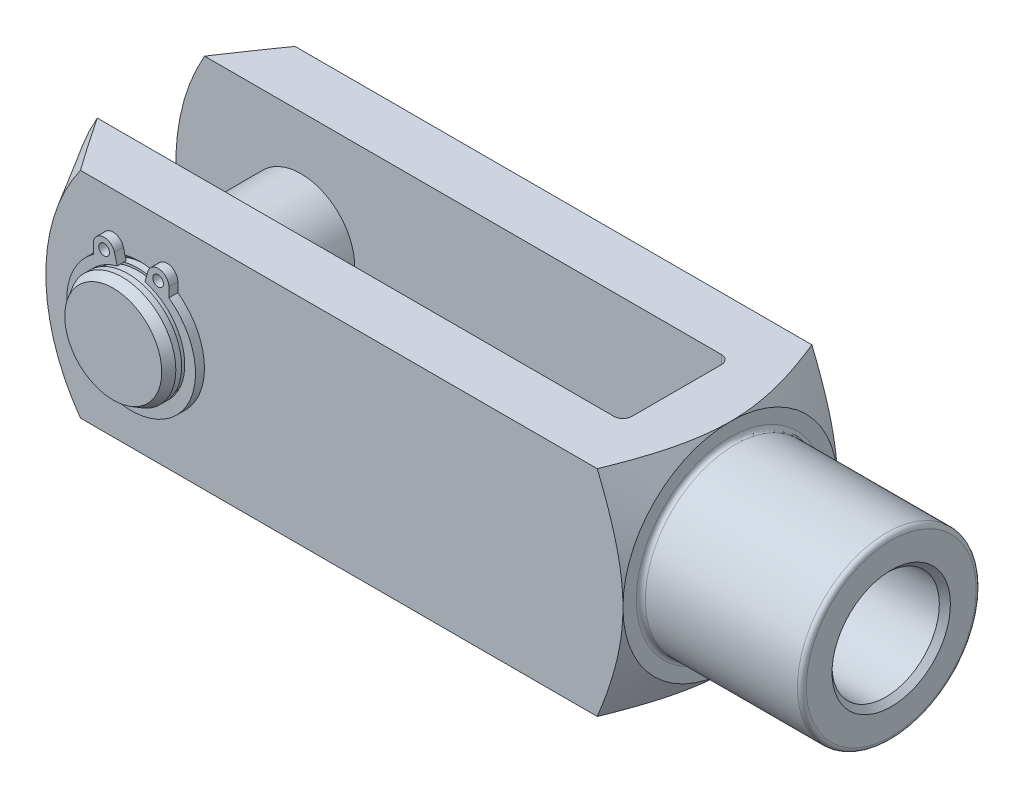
ISO-10303-21;
HEADER;
FILE_DESCRIPTION(('STEP AP214'),'2;1');
FILE_NAME('part.step','',(''),(''),'','','');
FILE_SCHEMA(('AUTOMOTIVE_DESIGN { 1 0 10303 214 1 1 1 1 }'));
ENDSEC;
DATA;
#1=APPLICATION_CONTEXT('core data for automotive mechanical design processes');
#2=APPLICATION_PROTOCOL_DEFINITION('international standard','automotive_design',2000,#1);
#3=PRODUCT_CONTEXT('',#1,'mechanical');
#4=PRODUCT('Part','Part','',(#3));
#5=PRODUCT_RELATED_PRODUCT_CATEGORY('part','',(#4));
#6=PRODUCT_DEFINITION_FORMATION('','',#4);
#7=PRODUCT_DEFINITION_CONTEXT('part definition',#1,'design');
#8=PRODUCT_DEFINITION('design','',#6,#7);
#9=PRODUCT_DEFINITION_SHAPE('','',#8);
#10=(LENGTH_UNIT() NAMED_UNIT(*) SI_UNIT(.MILLI.,.METRE.));
#11=(NAMED_UNIT(*) PLANE_ANGLE_UNIT() SI_UNIT($,.RADIAN.));
#12=(NAMED_UNIT(*) SI_UNIT($,.STERADIAN.) SOLID_ANGLE_UNIT());
#13=UNCERTAINTY_MEASURE_WITH_UNIT(LENGTH_MEASURE(1.E-05),#10,'distance_accuracy_value','');
#14=(GEOMETRIC_REPRESENTATION_CONTEXT(3) GLOBAL_UNCERTAINTY_ASSIGNED_CONTEXT((#13)) GLOBAL_UNIT_ASSIGNED_CONTEXT((#10,
#11,#12)) REPRESENTATION_CONTEXT('',''));
#15=CARTESIAN_POINT('',(0.,0.,0.));
#16=DIRECTION('',(0.,0.,1.));
#17=DIRECTION('',(1.,0.,0.));
#18=AXIS2_PLACEMENT_3D('',#15,#16,#17);
#19=CARTESIAN_POINT('',(-72.,0.,15.));
#20=DIRECTION('',(0.,0.,-1.));
#21=DIRECTION('',(-1.,0.,0.));
#22=AXIS2_PLACEMENT_3D('',#19,#20,#21);
#23=CYLINDRICAL_SURFACE('',#22,6.);
#24=CARTESIAN_POINT('',(-72.,0.,12.25));
#25=DIRECTION('',(0.,0.,1.));
#26=DIRECTION('',(1.,0.,0.));
#27=AXIS2_PLACEMENT_3D('',#24,#25,#26);
#28=CIRCLE('',#27,6.);
#29=CARTESIAN_POINT('',(-66.,0.,12.25));
#30=VERTEX_POINT('',#29);
#31=EDGE_CURVE('P0_E55',#30,#30,#28,.T.);
#32=ORIENTED_EDGE('',*,*,#31,.F.);
#33=EDGE_LOOP('',(#32));
#34=FACE_BOUND('',#33,.T.);
#35=CARTESIAN_POINT('',(-72.,0.,-12.25));
#36=DIRECTION('',(0.,0.,1.));
#37=DIRECTION('',(1.,0.,0.));
#38=AXIS2_PLACEMENT_3D('',#35,#36,#37);
#39=CIRCLE('',#38,6.);
#40=CARTESIAN_POINT('',(-66.,0.,-12.25));
#41=VERTEX_POINT('',#40);
#42=EDGE_CURVE('P0_E40',#41,#41,#39,.T.);
#43=ORIENTED_EDGE('',*,*,#42,.T.);
#44=EDGE_LOOP('',(#43));
#45=FACE_BOUND('',#44,.T.);
#46=ADVANCED_FACE('P0_F14',(#34,#45),#23,.T.);
#47=CARTESIAN_POINT('',(-72.,0.,-13.35));
#48=DIRECTION('',(0.,0.,1.));
#49=DIRECTION('',(1.,0.,0.));
#50=AXIS2_PLACEMENT_3D('',#47,#48,#49);
#51=CIRCLE('',#50,6.);
#52=CARTESIAN_POINT('',(-66.,0.,-13.35));
#53=VERTEX_POINT('',#52);
#54=EDGE_CURVE('P0_E43',#53,#53,#51,.T.);
#55=ORIENTED_EDGE('',*,*,#54,.F.);
#56=EDGE_LOOP('',(#55));
#57=FACE_BOUND('',#56,.T.);
#58=CARTESIAN_POINT('',(-72.,0.,-14.));
#59=DIRECTION('',(0.,0.,1.));
#60=DIRECTION('',(1.,0.,0.));
#61=AXIS2_PLACEMENT_3D('',#58,#59,#60);
#62=CIRCLE('',#61,6.);
#63=CARTESIAN_POINT('',(-66.,0.,-14.));
#64=VERTEX_POINT('',#63);
#65=EDGE_CURVE('P0_E25',#64,#64,#62,.T.);
#66=ORIENTED_EDGE('',*,*,#65,.T.);
#67=EDGE_LOOP('',(#66));
#68=FACE_BOUND('',#67,.T.);
#69=ADVANCED_FACE('P0_F63',(#57,#68),#23,.T.);
#70=CARTESIAN_POINT('',(-72.,0.,-15.));
#71=DIRECTION('',(0.,0.,1.));
#72=DIRECTION('',(1.,0.,0.));
#73=AXIS2_PLACEMENT_3D('',#70,#71,#72);
#74=PLANE('',#73);
#75=CARTESIAN_POINT('',(-72.,0.,-15.));
#76=DIRECTION('',(0.,0.,1.));
#77=DIRECTION('',(1.,0.,0.));
#78=AXIS2_PLACEMENT_3D('',#75,#76,#77);
#79=CIRCLE('',#78,5.42264973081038);
#80=CARTESIAN_POINT('',(-66.5773502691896,0.,-15.));
#81=VERTEX_POINT('',#80);
#82=EDGE_CURVE('P0_E21',#81,#81,#79,.F.);
#83=ORIENTED_EDGE('',*,*,#82,.T.);
#84=EDGE_LOOP('',(#83));
#85=FACE_BOUND('',#84,.T.);
#86=ADVANCED_FACE('P0_F89',(#85),#74,.F.);
#87=CARTESIAN_POINT('',(-72.,0.,-14.));
#88=DIRECTION('',(0.,0.,1.));
#89=DIRECTION('',(1.,0.,0.));
#90=AXIS2_PLACEMENT_3D('',#87,#88,#89);
#91=CONICAL_SURFACE('',#90,6.,0.523598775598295);
#92=ORIENTED_EDGE('',*,*,#82,.F.);
#93=EDGE_LOOP('',(#92));
#94=FACE_BOUND('',#93,.T.);
#95=ORIENTED_EDGE('',*,*,#65,.F.);
#96=EDGE_LOOP('',(#95));
#97=FACE_BOUND('',#96,.T.);
#98=ADVANCED_FACE('P0_F83',(#94,#97),#91,.T.);
#99=CARTESIAN_POINT('',(-72.,6.,-13.35));
#100=DIRECTION('',(0.,0.,-1.));
#101=DIRECTION('',(-1.,0.,0.));
#102=AXIS2_PLACEMENT_3D('',#99,#100,#101);
#103=PLANE('',#102);
#104=CARTESIAN_POINT('',(-72.,0.,-13.35));
#105=DIRECTION('',(0.,0.,1.));
#106=DIRECTION('',(1.,0.,0.));
#107=AXIS2_PLACEMENT_3D('',#104,#105,#106);
#108=CIRCLE('',#107,5.75);
#109=CARTESIAN_POINT('',(-66.25,0.,-13.35));
#110=VERTEX_POINT('',#109);
#111=EDGE_CURVE('P0_E34',#110,#110,#108,.T.);
#112=ORIENTED_EDGE('',*,*,#111,.F.);
#113=EDGE_LOOP('',(#112));
#114=FACE_BOUND('',#113,.T.);
#115=ORIENTED_EDGE('',*,*,#54,.T.);
#116=EDGE_LOOP('',(#115));
#117=FACE_BOUND('',#116,.T.);
#118=ADVANCED_FACE('P0_F77',(#114,#117),#103,.F.);
#119=CARTESIAN_POINT('',(-72.,0.,14.));
#120=DIRECTION('',(0.,0.,1.));
#121=DIRECTION('',(1.,0.,0.));
#122=AXIS2_PLACEMENT_3D('',#119,#120,#121);
#123=CYLINDRICAL_SURFACE('',#122,5.75);
#124=CARTESIAN_POINT('',(-72.,0.,-12.25));
#125=DIRECTION('',(0.,0.,1.));
#126=DIRECTION('',(1.,0.,0.));
#127=AXIS2_PLACEMENT_3D('',#124,#125,#126);
#128=CIRCLE('',#127,5.75);
#129=CARTESIAN_POINT('',(-66.25,0.,-12.25));
#130=VERTEX_POINT('',#129);
#131=EDGE_CURVE('P0_E37',#130,#130,#128,.T.);
#132=ORIENTED_EDGE('',*,*,#131,.F.);
#133=EDGE_LOOP('',(#132));
#134=FACE_BOUND('',#133,.T.);
#135=ORIENTED_EDGE('',*,*,#111,.T.);
#136=EDGE_LOOP('',(#135));
#137=FACE_BOUND('',#136,.T.);
#138=ADVANCED_FACE('P0_F71',(#134,#137),#123,.T.);
#139=CARTESIAN_POINT('',(-72.,6.,-12.25));
#140=DIRECTION('',(0.,0.,1.));
#141=DIRECTION('',(1.,0.,0.));
#142=AXIS2_PLACEMENT_3D('',#139,#140,#141);
#143=PLANE('',#142);
#144=ORIENTED_EDGE('',*,*,#42,.F.);
#145=EDGE_LOOP('',(#144));
#146=FACE_BOUND('',#145,.T.);
#147=ORIENTED_EDGE('',*,*,#131,.T.);
#148=EDGE_LOOP('',(#147));
#149=FACE_BOUND('',#148,.T.);
#150=ADVANCED_FACE('P0_F68',(#146,#149),#143,.F.);
#151=CARTESIAN_POINT('',(-72.,6.,12.25));
#152=DIRECTION('',(0.,0.,-1.));
#153=DIRECTION('',(-1.,0.,0.));
#154=AXIS2_PLACEMENT_3D('',#151,#152,#153);
#155=PLANE('',#154);
#156=CARTESIAN_POINT('',(-72.,0.,12.25));
#157=DIRECTION('',(0.,0.,1.));
#158=DIRECTION('',(1.,0.,0.));
#159=AXIS2_PLACEMENT_3D('',#156,#157,#158);
#160=CIRCLE('',#159,5.75);
#161=CARTESIAN_POINT('',(-66.25,0.,12.25));
#162=VERTEX_POINT('',#161);
#163=EDGE_CURVE('P0_E46',#162,#162,#160,.T.);
#164=ORIENTED_EDGE('',*,*,#163,.F.);
#165=EDGE_LOOP('',(#164));
#166=FACE_BOUND('',#165,.T.);
#167=ORIENTED_EDGE('',*,*,#31,.T.);
#168=EDGE_LOOP('',(#167));
#169=FACE_BOUND('',#168,.T.);
#170=ADVANCED_FACE('P0_F59',(#166,#169),#155,.F.);
#171=CARTESIAN_POINT('',(-72.,0.,14.));
#172=DIRECTION('',(0.,0.,1.));
#173=DIRECTION('',(1.,0.,0.));
#174=AXIS2_PLACEMENT_3D('',#171,#172,#173);
#175=CYLINDRICAL_SURFACE('',#174,5.75);
#176=CARTESIAN_POINT('',(-72.,0.,13.35));
#177=DIRECTION('',(0.,0.,1.));
#178=DIRECTION('',(1.,0.,0.));
#179=AXIS2_PLACEMENT_3D('',#176,#177,#178);
#180=CIRCLE('',#179,5.75);
#181=CARTESIAN_POINT('',(-66.25,0.,13.35));
#182=VERTEX_POINT('',#181);
#183=EDGE_CURVE('P0_E49',#182,#182,#180,.T.);
#184=ORIENTED_EDGE('',*,*,#183,.F.);
#185=EDGE_LOOP('',(#184));
#186=FACE_BOUND('',#185,.T.);
#187=ORIENTED_EDGE('',*,*,#163,.T.);
#188=EDGE_LOOP('',(#187));
#189=FACE_BOUND('',#188,.T.);
#190=ADVANCED_FACE('P0_F108',(#186,#189),#175,.T.);
#191=CARTESIAN_POINT('',(-72.,6.,13.35));
#192=DIRECTION('',(0.,0.,1.));
#193=DIRECTION('',(1.,0.,0.));
#194=AXIS2_PLACEMENT_3D('',#191,#192,#193);
#195=PLANE('',#194);
#196=CARTESIAN_POINT('',(-72.,0.,13.35));
#197=DIRECTION('',(0.,0.,1.));
#198=DIRECTION('',(1.,0.,0.));
#199=AXIS2_PLACEMENT_3D('',#196,#197,#198);
#200=CIRCLE('',#199,6.);
#201=CARTESIAN_POINT('',(-66.,0.,13.35));
#202=VERTEX_POINT('',#201);
#203=EDGE_CURVE('P0_E52',#202,#202,#200,.T.);
#204=ORIENTED_EDGE('',*,*,#203,.F.);
#205=EDGE_LOOP('',(#204));
#206=FACE_BOUND('',#205,.T.);
#207=ORIENTED_EDGE('',*,*,#183,.T.);
#208=EDGE_LOOP('',(#207));
#209=FACE_BOUND('',#208,.T.);
#210=ADVANCED_FACE('P0_F104',(#206,#209),#195,.F.);
#211=CARTESIAN_POINT('',(-72.,0.,15.));
#212=DIRECTION('',(0.,0.,1.));
#213=DIRECTION('',(1.,0.,0.));
#214=AXIS2_PLACEMENT_3D('',#211,#212,#213);
#215=PLANE('',#214);
#216=CARTESIAN_POINT('',(-72.,0.,15.));
#217=DIRECTION('',(0.,0.,1.));
#218=DIRECTION('',(1.,0.,0.));
#219=AXIS2_PLACEMENT_3D('',#216,#217,#218);
#220=CIRCLE('',#219,5.42264973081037);
#221=CARTESIAN_POINT('',(-66.5773502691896,0.,15.));
#222=VERTEX_POINT('',#221);
#223=EDGE_CURVE('P0_E10',#222,#222,#220,.T.);
#224=ORIENTED_EDGE('',*,*,#223,.T.);
#225=EDGE_LOOP('',(#224));
#226=FACE_BOUND('',#225,.T.);
#227=ADVANCED_FACE('P0_F102',(#226),#215,.T.);
#228=CARTESIAN_POINT('',(-72.,0.,15.));
#229=DIRECTION('',(0.,0.,-1.));
#230=DIRECTION('',(-1.,0.,0.));
#231=AXIS2_PLACEMENT_3D('',#228,#229,#230);
#232=CONICAL_SURFACE('',#231,5.42264973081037,0.523598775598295);
#233=CARTESIAN_POINT('',(-72.,0.,14.));
#234=DIRECTION('',(0.,0.,1.));
#235=DIRECTION('',(1.,0.,0.));
#236=AXIS2_PLACEMENT_3D('',#233,#234,#235);
#237=CIRCLE('',#236,6.);
#238=CARTESIAN_POINT('',(-66.,0.,14.));
#239=VERTEX_POINT('',#238);
#240=EDGE_CURVE('P0_E29',#239,#239,#237,.F.);
#241=ORIENTED_EDGE('',*,*,#240,.F.);
#242=EDGE_LOOP('',(#241));
#243=FACE_BOUND('',#242,.T.);
#244=ORIENTED_EDGE('',*,*,#223,.F.);
#245=EDGE_LOOP('',(#244));
#246=FACE_BOUND('',#245,.T.);
#247=ADVANCED_FACE('P0_F16',(#243,#246),#232,.T.);
#248=ORIENTED_EDGE('',*,*,#203,.T.);
#249=EDGE_LOOP('',(#248));
#250=FACE_BOUND('',#249,.T.);
#251=ORIENTED_EDGE('',*,*,#240,.T.);
#252=EDGE_LOOP('',(#251));
#253=FACE_BOUND('',#252,.T.);
#254=ADVANCED_FACE('P0_F65',(#250,#253),#23,.T.);
#255=CLOSED_SHELL('',(#46,#69,#86,#98,#118,#138,#150,#170,#190,#210,#227,#247,#254));
#256=MANIFOLD_SOLID_BREP('P0_B1',#255);
#257=CARTESIAN_POINT('',(-72.,0.,12.9999999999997));
#258=DIRECTION('',(0.,0.,1.));
#259=DIRECTION('',(1.,0.,0.));
#260=AXIS2_PLACEMENT_3D('',#257,#258,#259);
#261=PLANE('',#260);
#262=CARTESIAN_POINT('',(-75.0226081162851,6.64408309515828,12.9999999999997));
#263=DIRECTION('',(0.,0.,1.));
#264=DIRECTION('',(1.,0.,0.));
#265=AXIS2_PLACEMENT_3D('',#262,#263,#264);
#266=CIRCLE('',#265,0.6);
#267=CARTESIAN_POINT('',(-74.4226081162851,6.64408309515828,12.9999999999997));
#268=VERTEX_POINT('',#267);
#269=EDGE_CURVE('P1_E117',#268,#268,#266,.T.);
#270=ORIENTED_EDGE('',*,*,#269,.F.);
#271=EDGE_LOOP('',(#270));
#272=FACE_BOUND('',#271,.T.);
#273=CARTESIAN_POINT('',(-72.,0.,12.9999999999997));
#274=DIRECTION('',(0.,0.,-1.));
#275=DIRECTION('',(1.,0.,0.));
#276=AXIS2_PLACEMENT_3D('',#273,#274,#275);
#277=CIRCLE('',#276,6.);
#278=CARTESIAN_POINT('',(-70.4470857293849,5.79555495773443,12.9999999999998));
#279=VERTEX_POINT('',#278);
#280=CARTESIAN_POINT('',(-73.5529142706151,5.79555495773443,12.9999999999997));
#281=VERTEX_POINT('',#280);
#282=EDGE_CURVE('P1_E128',#279,#281,#277,.T.);
#283=ORIENTED_EDGE('',*,*,#282,.T.);
#284=DIRECTION('',(-0.258819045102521,0.965925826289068,0.));
#285=VECTOR('',#284,1.);
#286=CARTESIAN_POINT('',(-73.5529142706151,5.79555495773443,12.9999999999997));
#287=LINE('',#286,#285);
#288=CARTESIAN_POINT('',(-73.8634971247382,6.95466594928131,12.9999999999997));
#289=VERTEX_POINT('',#288);
#290=EDGE_CURVE('P1_E76',#281,#289,#287,.T.);
#291=ORIENTED_EDGE('',*,*,#290,.T.);
#292=CARTESIAN_POINT('',(-75.0226081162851,6.64408309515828,12.9999999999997));
#293=DIRECTION('',(0.,0.,1.));
#294=DIRECTION('',(1.,0.,0.));
#295=AXIS2_PLACEMENT_3D('',#292,#293,#294);
#296=CIRCLE('',#295,1.2);
#297=CARTESIAN_POINT('',(-76.2226081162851,6.64408309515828,12.9999999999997));
#298=VERTEX_POINT('',#297);
#299=EDGE_CURVE('P1_E143',#289,#298,#296,.T.);
#300=ORIENTED_EDGE('',*,*,#299,.T.);
#301=DIRECTION('',(0.,-1.,0.));
#302=VECTOR('',#301,1.);
#303=CARTESIAN_POINT('',(-76.2226081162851,6.64408309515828,12.9999999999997));
#304=LINE('',#303,#302);
#305=CARTESIAN_POINT('',(-76.2226081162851,5.59177337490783,12.9999999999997));
#306=VERTEX_POINT('',#305);
#307=EDGE_CURVE('P1_E156',#298,#306,#304,.T.);
#308=ORIENTED_EDGE('',*,*,#307,.T.);
#309=CARTESIAN_POINT('',(-72.,-0.239999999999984,12.9999999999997));
#310=DIRECTION('',(0.,0.,1.));
#311=DIRECTION('',(1.,0.,0.));
#312=AXIS2_PLACEMENT_3D('',#309,#310,#311);
#313=CIRCLE('',#312,7.2);
#314=CARTESIAN_POINT('',(-67.777391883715,5.59177337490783,12.9999999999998));
#315=VERTEX_POINT('',#314);
#316=EDGE_CURVE('P1_E95',#306,#315,#313,.T.);
#317=ORIENTED_EDGE('',*,*,#316,.T.);
#318=DIRECTION('',(0.,1.,0.));
#319=VECTOR('',#318,1.);
#320=CARTESIAN_POINT('',(-67.777391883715,6.64408309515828,12.9999999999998));
#321=LINE('',#320,#319);
#322=CARTESIAN_POINT('',(-67.777391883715,6.64408309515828,12.9999999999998));
#323=VERTEX_POINT('',#322);
#324=EDGE_CURVE('P1_E89',#315,#323,#321,.T.);
#325=ORIENTED_EDGE('',*,*,#324,.T.);
#326=CARTESIAN_POINT('',(-68.977391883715,6.64408309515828,12.9999999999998));
#327=DIRECTION('',(0.,0.,1.));
#328=DIRECTION('',(-1.,0.,0.));
#329=AXIS2_PLACEMENT_3D('',#326,#327,#328);
#330=CIRCLE('',#329,1.2);
#331=CARTESIAN_POINT('',(-70.1365028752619,6.95466594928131,12.9999999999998));
#332=VERTEX_POINT('',#331);
#333=EDGE_CURVE('P1_E93',#323,#332,#330,.T.);
#334=ORIENTED_EDGE('',*,*,#333,.T.);
#335=DIRECTION('',(-0.258819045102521,-0.965925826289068,0.));
#336=VECTOR('',#335,1.);
#337=CARTESIAN_POINT('',(-70.4470857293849,5.79555495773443,12.9999999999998));
#338=LINE('',#337,#336);
#339=EDGE_CURVE('P1_E33',#332,#279,#338,.T.);
#340=ORIENTED_EDGE('',*,*,#339,.T.);
#341=EDGE_LOOP('',(#283,#291,#300,#308,#317,#325,#334,#340));
#342=FACE_BOUND('',#341,.T.);
#343=CARTESIAN_POINT('',(-68.977391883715,6.64408309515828,12.9999999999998));
#344=DIRECTION('',(0.,0.,1.));
#345=DIRECTION('',(-1.,0.,0.));
#346=AXIS2_PLACEMENT_3D('',#343,#344,#345);
#347=CIRCLE('',#346,0.6);
#348=CARTESIAN_POINT('',(-69.577391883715,6.64408309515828,12.9999999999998));
#349=VERTEX_POINT('',#348);
#350=EDGE_CURVE('P1_E165',#349,#349,#347,.T.);
#351=ORIENTED_EDGE('',*,*,#350,.F.);
#352=EDGE_LOOP('',(#351));
#353=FACE_BOUND('',#352,.T.);
#354=ADVANCED_FACE('P1_F16',(#272,#342,#353),#261,.T.);
#355=CARTESIAN_POINT('',(-72.,0.,11.9999999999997));
#356=DIRECTION('',(0.,0.,1.));
#357=DIRECTION('',(1.,0.,0.));
#358=AXIS2_PLACEMENT_3D('',#355,#356,#357);
#359=PLANE('',#358);
#360=CARTESIAN_POINT('',(-75.0226081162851,6.64408309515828,11.9999999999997));
#361=DIRECTION('',(0.,0.,1.));
#362=DIRECTION('',(1.,0.,0.));
#363=AXIS2_PLACEMENT_3D('',#360,#361,#362);
#364=CIRCLE('',#363,0.6);
#365=CARTESIAN_POINT('',(-74.422608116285,6.64408309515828,11.9999999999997));
#366=VERTEX_POINT('',#365);
#367=EDGE_CURVE('P1_E162',#366,#366,#364,.T.);
#368=ORIENTED_EDGE('',*,*,#367,.T.);
#369=EDGE_LOOP('',(#368));
#370=FACE_BOUND('',#369,.T.);
#371=CARTESIAN_POINT('',(-72.,0.,11.9999999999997));
#372=DIRECTION('',(0.,0.,-1.));
#373=DIRECTION('',(1.,0.,0.));
#374=AXIS2_PLACEMENT_3D('',#371,#372,#373);
#375=CIRCLE('',#374,6.);
#376=CARTESIAN_POINT('',(-70.4470857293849,5.79555495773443,11.9999999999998));
#377=VERTEX_POINT('',#376);
#378=CARTESIAN_POINT('',(-73.5529142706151,5.79555495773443,11.9999999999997));
#379=VERTEX_POINT('',#378);
#380=EDGE_CURVE('P1_E113',#377,#379,#375,.T.);
#381=ORIENTED_EDGE('',*,*,#380,.F.);
#382=DIRECTION('',(-0.258819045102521,-0.965925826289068,0.));
#383=VECTOR('',#382,1.);
#384=CARTESIAN_POINT('',(-70.4470857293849,5.79555495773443,11.9999999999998));
#385=LINE('',#384,#383);
#386=CARTESIAN_POINT('',(-70.1365028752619,6.95466594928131,11.9999999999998));
#387=VERTEX_POINT('',#386);
#388=EDGE_CURVE('P1_E68',#387,#377,#385,.T.);
#389=ORIENTED_EDGE('',*,*,#388,.F.);
#390=CARTESIAN_POINT('',(-68.977391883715,6.64408309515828,11.9999999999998));
#391=DIRECTION('',(0.,0.,1.));
#392=DIRECTION('',(-1.,0.,0.));
#393=AXIS2_PLACEMENT_3D('',#390,#391,#392);
#394=CIRCLE('',#393,1.2);
#395=CARTESIAN_POINT('',(-67.777391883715,6.64408309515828,11.9999999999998));
#396=VERTEX_POINT('',#395);
#397=EDGE_CURVE('P1_E62',#396,#387,#394,.T.);
#398=ORIENTED_EDGE('',*,*,#397,.F.);
#399=DIRECTION('',(0.,1.,0.));
#400=VECTOR('',#399,1.);
#401=CARTESIAN_POINT('',(-67.777391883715,6.64408309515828,11.9999999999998));
#402=LINE('',#401,#400);
#403=CARTESIAN_POINT('',(-67.777391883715,5.59177337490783,11.9999999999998));
#404=VERTEX_POINT('',#403);
#405=EDGE_CURVE('P1_E103',#404,#396,#402,.T.);
#406=ORIENTED_EDGE('',*,*,#405,.F.);
#407=CARTESIAN_POINT('',(-72.,-0.239999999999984,11.9999999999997));
#408=DIRECTION('',(0.,0.,1.));
#409=DIRECTION('',(1.,0.,0.));
#410=AXIS2_PLACEMENT_3D('',#407,#408,#409);
#411=CIRCLE('',#410,7.2);
#412=CARTESIAN_POINT('',(-76.2226081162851,5.59177337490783,11.9999999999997));
#413=VERTEX_POINT('',#412);
#414=EDGE_CURVE('P1_E123',#413,#404,#411,.T.);
#415=ORIENTED_EDGE('',*,*,#414,.F.);
#416=DIRECTION('',(0.,-1.,0.));
#417=VECTOR('',#416,1.);
#418=CARTESIAN_POINT('',(-76.2226081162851,6.64408309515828,11.9999999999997));
#419=LINE('',#418,#417);
#420=CARTESIAN_POINT('',(-76.2226081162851,6.64408309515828,11.9999999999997));
#421=VERTEX_POINT('',#420);
#422=EDGE_CURVE('P1_E121',#421,#413,#419,.T.);
#423=ORIENTED_EDGE('',*,*,#422,.F.);
#424=CARTESIAN_POINT('',(-75.0226081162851,6.64408309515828,11.9999999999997));
#425=DIRECTION('',(0.,0.,1.));
#426=DIRECTION('',(1.,0.,0.));
#427=AXIS2_PLACEMENT_3D('',#424,#425,#426);
#428=CIRCLE('',#427,1.2);
#429=CARTESIAN_POINT('',(-73.8634971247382,6.95466594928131,11.9999999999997));
#430=VERTEX_POINT('',#429);
#431=EDGE_CURVE('P1_E119',#430,#421,#428,.T.);
#432=ORIENTED_EDGE('',*,*,#431,.F.);
#433=DIRECTION('',(-0.258819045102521,0.965925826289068,0.));
#434=VECTOR('',#433,1.);
#435=CARTESIAN_POINT('',(-73.5529142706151,5.79555495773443,11.9999999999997));
#436=LINE('',#435,#434);
#437=EDGE_CURVE('P1_E116',#379,#430,#436,.T.);
#438=ORIENTED_EDGE('',*,*,#437,.F.);
#439=EDGE_LOOP('',(#381,#389,#398,#406,#415,#423,#432,#438));
#440=FACE_BOUND('',#439,.T.);
#441=CARTESIAN_POINT('',(-68.977391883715,6.64408309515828,11.9999999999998));
#442=DIRECTION('',(0.,0.,1.));
#443=DIRECTION('',(-1.,0.,0.));
#444=AXIS2_PLACEMENT_3D('',#441,#442,#443);
#445=CIRCLE('',#444,0.6);
#446=CARTESIAN_POINT('',(-69.577391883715,6.64408309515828,11.9999999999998));
#447=VERTEX_POINT('',#446);
#448=EDGE_CURVE('P1_E168',#447,#447,#445,.T.);
#449=ORIENTED_EDGE('',*,*,#448,.T.);
#450=EDGE_LOOP('',(#449));
#451=FACE_BOUND('',#450,.T.);
#452=ADVANCED_FACE('P1_F147',(#370,#440,#451),#359,.F.);
#453=CARTESIAN_POINT('',(-72.,0.,12.9999999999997));
#454=DIRECTION('',(0.,0.,-1.));
#455=DIRECTION('',(-1.,0.,0.));
#456=AXIS2_PLACEMENT_3D('',#453,#454,#455);
#457=CYLINDRICAL_SURFACE('',#456,6.);
#458=ORIENTED_EDGE('',*,*,#380,.T.);
#459=DIRECTION('',(0.,0.,-1.));
#460=VECTOR('',#459,1.);
#461=CARTESIAN_POINT('',(-73.5529142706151,5.79555495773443,12.9999999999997));
#462=LINE('',#461,#460);
#463=EDGE_CURVE('P1_E11',#281,#379,#462,.T.);
#464=ORIENTED_EDGE('',*,*,#463,.F.);
#465=ORIENTED_EDGE('',*,*,#282,.F.);
#466=DIRECTION('',(0.,0.,-1.));
#467=VECTOR('',#466,1.);
#468=CARTESIAN_POINT('',(-70.4470857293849,5.79555495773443,12.9999999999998));
#469=LINE('',#468,#467);
#470=EDGE_CURVE('P1_E109',#279,#377,#469,.T.);
#471=ORIENTED_EDGE('',*,*,#470,.T.);
#472=EDGE_LOOP('',(#458,#464,#465,#471));
#473=FACE_BOUND('',#472,.T.);
#474=ADVANCED_FACE('P1_F18',(#473),#457,.F.);
#475=CARTESIAN_POINT('',(-73.5529142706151,5.79555495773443,12.9999999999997));
#476=DIRECTION('',(-0.965925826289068,-0.258819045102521,0.));
#477=DIRECTION('',(0.258819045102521,-0.965925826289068,0.));
#478=AXIS2_PLACEMENT_3D('',#475,#476,#477);
#479=PLANE('',#478);
#480=ORIENTED_EDGE('',*,*,#437,.T.);
#481=DIRECTION('',(0.,0.,-1.));
#482=VECTOR('',#481,1.);
#483=CARTESIAN_POINT('',(-73.8634971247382,6.95466594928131,12.9999999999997));
#484=LINE('',#483,#482);
#485=EDGE_CURVE('P1_E25',#289,#430,#484,.T.);
#486=ORIENTED_EDGE('',*,*,#485,.F.);
#487=ORIENTED_EDGE('',*,*,#290,.F.);
#488=ORIENTED_EDGE('',*,*,#463,.T.);
#489=EDGE_LOOP('',(#480,#486,#487,#488));
#490=FACE_BOUND('',#489,.T.);
#491=ADVANCED_FACE('P1_F202',(#490),#479,.F.);
#492=CARTESIAN_POINT('',(-75.0226081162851,6.64408309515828,12.9999999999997));
#493=DIRECTION('',(0.,0.,-1.));
#494=DIRECTION('',(-1.,0.,0.));
#495=AXIS2_PLACEMENT_3D('',#492,#493,#494);
#496=CYLINDRICAL_SURFACE('',#495,1.2);
#497=ORIENTED_EDGE('',*,*,#431,.T.);
#498=DIRECTION('',(0.,0.,-1.));
#499=VECTOR('',#498,1.);
#500=CARTESIAN_POINT('',(-76.2226081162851,6.64408309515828,12.9999999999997));
#501=LINE('',#500,#499);
#502=EDGE_CURVE('P1_E135',#298,#421,#501,.T.);
#503=ORIENTED_EDGE('',*,*,#502,.F.);
#504=ORIENTED_EDGE('',*,*,#299,.F.);
#505=ORIENTED_EDGE('',*,*,#485,.T.);
#506=EDGE_LOOP('',(#497,#503,#504,#505));
#507=FACE_BOUND('',#506,.T.);
#508=ADVANCED_FACE('P1_F141',(#507),#496,.T.);
#509=CARTESIAN_POINT('',(-76.2226081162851,6.64408309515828,12.9999999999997));
#510=DIRECTION('',(1.,0.,0.));
#511=DIRECTION('',(0.,1.,0.));
#512=AXIS2_PLACEMENT_3D('',#509,#510,#511);
#513=PLANE('',#512);
#514=ORIENTED_EDGE('',*,*,#422,.T.);
#515=DIRECTION('',(0.,0.,-1.));
#516=VECTOR('',#515,1.);
#517=CARTESIAN_POINT('',(-76.2226081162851,5.59177337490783,12.9999999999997));
#518=LINE('',#517,#516);
#519=EDGE_CURVE('P1_E132',#306,#413,#518,.T.);
#520=ORIENTED_EDGE('',*,*,#519,.F.);
#521=ORIENTED_EDGE('',*,*,#307,.F.);
#522=ORIENTED_EDGE('',*,*,#502,.T.);
#523=EDGE_LOOP('',(#514,#520,#521,#522));
#524=FACE_BOUND('',#523,.T.);
#525=ADVANCED_FACE('P1_F152',(#524),#513,.F.);
#526=CARTESIAN_POINT('',(-72.,-0.239999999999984,12.9999999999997));
#527=DIRECTION('',(0.,0.,-1.));
#528=DIRECTION('',(-1.,0.,0.));
#529=AXIS2_PLACEMENT_3D('',#526,#527,#528);
#530=CYLINDRICAL_SURFACE('',#529,7.2);
#531=ORIENTED_EDGE('',*,*,#414,.T.);
#532=DIRECTION('',(0.,0.,-1.));
#533=VECTOR('',#532,1.);
#534=CARTESIAN_POINT('',(-67.777391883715,5.59177337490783,12.9999999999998));
#535=LINE('',#534,#533);
#536=EDGE_CURVE('P1_E104',#315,#404,#535,.T.);
#537=ORIENTED_EDGE('',*,*,#536,.F.);
#538=ORIENTED_EDGE('',*,*,#316,.F.);
#539=ORIENTED_EDGE('',*,*,#519,.T.);
#540=EDGE_LOOP('',(#531,#537,#538,#539));
#541=FACE_BOUND('',#540,.T.);
#542=ADVANCED_FACE('P1_F155',(#541),#530,.T.);
#543=CARTESIAN_POINT('',(-67.777391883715,6.64408309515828,12.9999999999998));
#544=DIRECTION('',(-1.,0.,0.));
#545=DIRECTION('',(0.,-1.,0.));
#546=AXIS2_PLACEMENT_3D('',#543,#544,#545);
#547=PLANE('',#546);
#548=ORIENTED_EDGE('',*,*,#405,.T.);
#549=DIRECTION('',(0.,0.,-1.));
#550=VECTOR('',#549,1.);
#551=CARTESIAN_POINT('',(-67.777391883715,6.64408309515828,12.9999999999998));
#552=LINE('',#551,#550);
#553=EDGE_CURVE('P1_E100',#323,#396,#552,.T.);
#554=ORIENTED_EDGE('',*,*,#553,.F.);
#555=ORIENTED_EDGE('',*,*,#324,.F.);
#556=ORIENTED_EDGE('',*,*,#536,.T.);
#557=EDGE_LOOP('',(#548,#554,#555,#556));
#558=FACE_BOUND('',#557,.T.);
#559=ADVANCED_FACE('P1_F101',(#558),#547,.F.);
#560=CARTESIAN_POINT('',(-68.977391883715,6.64408309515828,12.9999999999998));
#561=DIRECTION('',(0.,0.,-1.));
#562=DIRECTION('',(-1.,0.,0.));
#563=AXIS2_PLACEMENT_3D('',#560,#561,#562);
#564=CYLINDRICAL_SURFACE('',#563,1.2);
#565=ORIENTED_EDGE('',*,*,#397,.T.);
#566=DIRECTION('',(0.,0.,-1.));
#567=VECTOR('',#566,1.);
#568=CARTESIAN_POINT('',(-70.1365028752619,6.95466594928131,12.9999999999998));
#569=LINE('',#568,#567);
#570=EDGE_CURVE('P1_E105',#332,#387,#569,.T.);
#571=ORIENTED_EDGE('',*,*,#570,.F.);
#572=ORIENTED_EDGE('',*,*,#333,.F.);
#573=ORIENTED_EDGE('',*,*,#553,.T.);
#574=EDGE_LOOP('',(#565,#571,#572,#573));
#575=FACE_BOUND('',#574,.T.);
#576=ADVANCED_FACE('P1_F107',(#575),#564,.T.);
#577=CARTESIAN_POINT('',(-70.4470857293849,5.79555495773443,12.9999999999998));
#578=DIRECTION('',(0.965925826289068,-0.258819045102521,0.));
#579=DIRECTION('',(0.258819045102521,0.965925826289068,0.));
#580=AXIS2_PLACEMENT_3D('',#577,#578,#579);
#581=PLANE('',#580);
#582=ORIENTED_EDGE('',*,*,#388,.T.);
#583=ORIENTED_EDGE('',*,*,#470,.F.);
#584=ORIENTED_EDGE('',*,*,#339,.F.);
#585=ORIENTED_EDGE('',*,*,#570,.T.);
#586=EDGE_LOOP('',(#582,#583,#584,#585));
#587=FACE_BOUND('',#586,.T.);
#588=ADVANCED_FACE('P1_F190',(#587),#581,.F.);
#589=CARTESIAN_POINT('',(-75.0226081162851,6.64408309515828,12.9999999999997));
#590=DIRECTION('',(0.,0.,-1.));
#591=DIRECTION('',(-1.,0.,0.));
#592=AXIS2_PLACEMENT_3D('',#589,#590,#591);
#593=CYLINDRICAL_SURFACE('',#592,0.6);
#594=ORIENTED_EDGE('',*,*,#269,.T.);
#595=EDGE_LOOP('',(#594));
#596=FACE_BOUND('',#595,.T.);
#597=ORIENTED_EDGE('',*,*,#367,.F.);
#598=EDGE_LOOP('',(#597));
#599=FACE_BOUND('',#598,.T.);
#600=ADVANCED_FACE('P1_F187',(#596,#599),#593,.F.);
#601=CARTESIAN_POINT('',(-68.977391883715,6.64408309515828,12.9999999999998));
#602=DIRECTION('',(0.,0.,-1.));
#603=DIRECTION('',(-1.,0.,0.));
#604=AXIS2_PLACEMENT_3D('',#601,#602,#603);
#605=CYLINDRICAL_SURFACE('',#604,0.6);
#606=ORIENTED_EDGE('',*,*,#350,.T.);
#607=EDGE_LOOP('',(#606));
#608=FACE_BOUND('',#607,.T.);
#609=ORIENTED_EDGE('',*,*,#448,.F.);
#610=EDGE_LOOP('',(#609));
#611=FACE_BOUND('',#610,.T.);
#612=ADVANCED_FACE('P1_F174',(#608,#611),#605,.F.);
#613=CLOSED_SHELL('',(#354,#452,#474,#491,#508,#525,#542,#559,#576,#588,#600,#612));
#614=MANIFOLD_SOLID_BREP('P1_B1',#613);
#615=CARTESIAN_POINT('',(-72.,0.,-12.9999999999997));
#616=DIRECTION('',(0.,0.,-1.));
#617=DIRECTION('',(-1.,0.,0.));
#618=AXIS2_PLACEMENT_3D('',#615,#616,#617);
#619=PLANE('',#618);
#620=CARTESIAN_POINT('',(-68.977391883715,6.64408309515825,-12.9999999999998));
#621=DIRECTION('',(0.,0.,-1.));
#622=DIRECTION('',(-1.,0.,0.));
#623=AXIS2_PLACEMENT_3D('',#620,#621,#622);
#624=CIRCLE('',#623,0.6);
#625=CARTESIAN_POINT('',(-69.577391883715,6.64408309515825,-12.9999999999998));
#626=VERTEX_POINT('',#625);
#627=EDGE_CURVE('P2_E117',#626,#626,#624,.T.);
#628=ORIENTED_EDGE('',*,*,#627,.F.);
#629=EDGE_LOOP('',(#628));
#630=FACE_BOUND('',#629,.T.);
#631=CARTESIAN_POINT('',(-72.,0.,-12.9999999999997));
#632=DIRECTION('',(0.,0.,1.));
#633=DIRECTION('',(-1.,0.,0.));
#634=AXIS2_PLACEMENT_3D('',#631,#632,#633);
#635=CIRCLE('',#634,6.);
#636=CARTESIAN_POINT('',(-73.5529142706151,5.7955549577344,-12.9999999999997));
#637=VERTEX_POINT('',#636);
#638=CARTESIAN_POINT('',(-70.4470857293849,5.7955549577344,-12.9999999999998));
#639=VERTEX_POINT('',#638);
#640=EDGE_CURVE('P2_E128',#637,#639,#635,.T.);
#641=ORIENTED_EDGE('',*,*,#640,.T.);
#642=DIRECTION('',(0.258819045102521,0.965925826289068,0.));
#643=VECTOR('',#642,1.);
#644=CARTESIAN_POINT('',(-70.4470857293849,5.7955549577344,-12.9999999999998));
#645=LINE('',#644,#643);
#646=CARTESIAN_POINT('',(-70.1365028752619,6.95466594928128,-12.9999999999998));
#647=VERTEX_POINT('',#646);
#648=EDGE_CURVE('P2_E76',#639,#647,#645,.T.);
#649=ORIENTED_EDGE('',*,*,#648,.T.);
#650=CARTESIAN_POINT('',(-68.977391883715,6.64408309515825,-12.9999999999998));
#651=DIRECTION('',(0.,0.,-1.));
#652=DIRECTION('',(-1.,0.,0.));
#653=AXIS2_PLACEMENT_3D('',#650,#651,#652);
#654=CIRCLE('',#653,1.2);
#655=CARTESIAN_POINT('',(-67.777391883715,6.64408309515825,-12.9999999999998));
#656=VERTEX_POINT('',#655);
#657=EDGE_CURVE('P2_E143',#647,#656,#654,.T.);
#658=ORIENTED_EDGE('',*,*,#657,.T.);
#659=DIRECTION('',(0.,-1.,0.));
#660=VECTOR('',#659,1.);
#661=CARTESIAN_POINT('',(-67.777391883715,6.64408309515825,-12.9999999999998));
#662=LINE('',#661,#660);
#663=CARTESIAN_POINT('',(-67.777391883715,5.59177337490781,-12.9999999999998));
#664=VERTEX_POINT('',#663);
#665=EDGE_CURVE('P2_E156',#656,#664,#662,.T.);
#666=ORIENTED_EDGE('',*,*,#665,.T.);
#667=CARTESIAN_POINT('',(-72.,-0.240000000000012,-12.9999999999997));
#668=DIRECTION('',(0.,0.,-1.));
#669=DIRECTION('',(-1.,0.,0.));
#670=AXIS2_PLACEMENT_3D('',#667,#668,#669);
#671=CIRCLE('',#670,7.2);
#672=CARTESIAN_POINT('',(-76.222608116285,5.59177337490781,-12.9999999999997));
#673=VERTEX_POINT('',#672);
#674=EDGE_CURVE('P2_E95',#664,#673,#671,.T.);
#675=ORIENTED_EDGE('',*,*,#674,.T.);
#676=DIRECTION('',(0.,1.,0.));
#677=VECTOR('',#676,1.);
#678=CARTESIAN_POINT('',(-76.222608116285,6.64408309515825,-12.9999999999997));
#679=LINE('',#678,#677);
#680=CARTESIAN_POINT('',(-76.222608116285,6.64408309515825,-12.9999999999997));
#681=VERTEX_POINT('',#680);
#682=EDGE_CURVE('P2_E89',#673,#681,#679,.T.);
#683=ORIENTED_EDGE('',*,*,#682,.T.);
#684=CARTESIAN_POINT('',(-75.0226081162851,6.64408309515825,-12.9999999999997));
#685=DIRECTION('',(0.,0.,-1.));
#686=DIRECTION('',(1.,0.,0.));
#687=AXIS2_PLACEMENT_3D('',#684,#685,#686);
#688=CIRCLE('',#687,1.2);
#689=CARTESIAN_POINT('',(-73.8634971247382,6.95466594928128,-12.9999999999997));
#690=VERTEX_POINT('',#689);
#691=EDGE_CURVE('P2_E93',#681,#690,#688,.T.);
#692=ORIENTED_EDGE('',*,*,#691,.T.);
#693=DIRECTION('',(0.258819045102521,-0.965925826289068,0.));
#694=VECTOR('',#693,1.);
#695=CARTESIAN_POINT('',(-73.5529142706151,5.7955549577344,-12.9999999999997));
#696=LINE('',#695,#694);
#697=EDGE_CURVE('P2_E33',#690,#637,#696,.T.);
#698=ORIENTED_EDGE('',*,*,#697,.T.);
#699=EDGE_LOOP('',(#641,#649,#658,#666,#675,#683,#692,#698));
#700=FACE_BOUND('',#699,.T.);
#701=CARTESIAN_POINT('',(-75.0226081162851,6.64408309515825,-12.9999999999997));
#702=DIRECTION('',(0.,0.,-1.));
#703=DIRECTION('',(1.,0.,0.));
#704=AXIS2_PLACEMENT_3D('',#701,#702,#703);
#705=CIRCLE('',#704,0.6);
#706=CARTESIAN_POINT('',(-74.422608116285,6.64408309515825,-12.9999999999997));
#707=VERTEX_POINT('',#706);
#708=EDGE_CURVE('P2_E165',#707,#707,#705,.T.);
#709=ORIENTED_EDGE('',*,*,#708,.F.);
#710=EDGE_LOOP('',(#709));
#711=FACE_BOUND('',#710,.T.);
#712=ADVANCED_FACE('P2_F16',(#630,#700,#711),#619,.T.);
#713=CARTESIAN_POINT('',(-72.,0.,-11.9999999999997));
#714=DIRECTION('',(0.,0.,-1.));
#715=DIRECTION('',(-1.,0.,0.));
#716=AXIS2_PLACEMENT_3D('',#713,#714,#715);
#717=PLANE('',#716);
#718=CARTESIAN_POINT('',(-68.977391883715,6.64408309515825,-11.9999999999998));
#719=DIRECTION('',(0.,0.,-1.));
#720=DIRECTION('',(-1.,0.,0.));
#721=AXIS2_PLACEMENT_3D('',#718,#719,#720);
#722=CIRCLE('',#721,0.6);
#723=CARTESIAN_POINT('',(-69.577391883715,6.64408309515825,-11.9999999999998));
#724=VERTEX_POINT('',#723);
#725=EDGE_CURVE('P2_E162',#724,#724,#722,.T.);
#726=ORIENTED_EDGE('',*,*,#725,.T.);
#727=EDGE_LOOP('',(#726));
#728=FACE_BOUND('',#727,.T.);
#729=CARTESIAN_POINT('',(-72.,0.,-11.9999999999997));
#730=DIRECTION('',(0.,0.,1.));
#731=DIRECTION('',(-1.,0.,0.));
#732=AXIS2_PLACEMENT_3D('',#729,#730,#731);
#733=CIRCLE('',#732,6.);
#734=CARTESIAN_POINT('',(-73.5529142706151,5.7955549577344,-11.9999999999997));
#735=VERTEX_POINT('',#734);
#736=CARTESIAN_POINT('',(-70.4470857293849,5.7955549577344,-11.9999999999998));
#737=VERTEX_POINT('',#736);
#738=EDGE_CURVE('P2_E113',#735,#737,#733,.T.);
#739=ORIENTED_EDGE('',*,*,#738,.F.);
#740=DIRECTION('',(0.258819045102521,-0.965925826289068,0.));
#741=VECTOR('',#740,1.);
#742=CARTESIAN_POINT('',(-73.5529142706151,5.7955549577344,-11.9999999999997));
#743=LINE('',#742,#741);
#744=CARTESIAN_POINT('',(-73.8634971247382,6.95466594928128,-11.9999999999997));
#745=VERTEX_POINT('',#744);
#746=EDGE_CURVE('P2_E68',#745,#735,#743,.T.);
#747=ORIENTED_EDGE('',*,*,#746,.F.);
#748=CARTESIAN_POINT('',(-75.022608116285,6.64408309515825,-11.9999999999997));
#749=DIRECTION('',(0.,0.,-1.));
#750=DIRECTION('',(1.,0.,0.));
#751=AXIS2_PLACEMENT_3D('',#748,#749,#750);
#752=CIRCLE('',#751,1.2);
#753=CARTESIAN_POINT('',(-76.222608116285,6.64408309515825,-11.9999999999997));
#754=VERTEX_POINT('',#753);
#755=EDGE_CURVE('P2_E62',#754,#745,#752,.T.);
#756=ORIENTED_EDGE('',*,*,#755,.F.);
#757=DIRECTION('',(0.,1.,0.));
#758=VECTOR('',#757,1.);
#759=CARTESIAN_POINT('',(-76.222608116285,6.64408309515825,-11.9999999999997));
#760=LINE('',#759,#758);
#761=CARTESIAN_POINT('',(-76.222608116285,5.59177337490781,-11.9999999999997));
#762=VERTEX_POINT('',#761);
#763=EDGE_CURVE('P2_E103',#762,#754,#760,.T.);
#764=ORIENTED_EDGE('',*,*,#763,.F.);
#765=CARTESIAN_POINT('',(-72.,-0.240000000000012,-11.9999999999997));
#766=DIRECTION('',(0.,0.,-1.));
#767=DIRECTION('',(-1.,0.,0.));
#768=AXIS2_PLACEMENT_3D('',#765,#766,#767);
#769=CIRCLE('',#768,7.2);
#770=CARTESIAN_POINT('',(-67.777391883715,5.59177337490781,-11.9999999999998));
#771=VERTEX_POINT('',#770);
#772=EDGE_CURVE('P2_E123',#771,#762,#769,.T.);
#773=ORIENTED_EDGE('',*,*,#772,.F.);
#774=DIRECTION('',(0.,-1.,0.));
#775=VECTOR('',#774,1.);
#776=CARTESIAN_POINT('',(-67.777391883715,6.64408309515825,-11.9999999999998));
#777=LINE('',#776,#775);
#778=CARTESIAN_POINT('',(-67.777391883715,6.64408309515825,-11.9999999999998));
#779=VERTEX_POINT('',#778);
#780=EDGE_CURVE('P2_E121',#779,#771,#777,.T.);
#781=ORIENTED_EDGE('',*,*,#780,.F.);
#782=CARTESIAN_POINT('',(-68.977391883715,6.64408309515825,-11.9999999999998));
#783=DIRECTION('',(0.,0.,-1.));
#784=DIRECTION('',(-1.,0.,0.));
#785=AXIS2_PLACEMENT_3D('',#782,#783,#784);
#786=CIRCLE('',#785,1.2);
#787=CARTESIAN_POINT('',(-70.1365028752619,6.95466594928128,-11.9999999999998));
#788=VERTEX_POINT('',#787);
#789=EDGE_CURVE('P2_E119',#788,#779,#786,.T.);
#790=ORIENTED_EDGE('',*,*,#789,.F.);
#791=DIRECTION('',(0.258819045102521,0.965925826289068,0.));
#792=VECTOR('',#791,1.);
#793=CARTESIAN_POINT('',(-70.4470857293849,5.7955549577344,-11.9999999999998));
#794=LINE('',#793,#792);
#795=EDGE_CURVE('P2_E116',#737,#788,#794,.T.);
#796=ORIENTED_EDGE('',*,*,#795,.F.);
#797=EDGE_LOOP('',(#739,#747,#756,#764,#773,#781,#790,#796));
#798=FACE_BOUND('',#797,.T.);
#799=CARTESIAN_POINT('',(-75.022608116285,6.64408309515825,-11.9999999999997));
#800=DIRECTION('',(0.,0.,-1.));
#801=DIRECTION('',(1.,0.,0.));
#802=AXIS2_PLACEMENT_3D('',#799,#800,#801);
#803=CIRCLE('',#802,0.6);
#804=CARTESIAN_POINT('',(-74.422608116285,6.64408309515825,-11.9999999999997));
#805=VERTEX_POINT('',#804);
#806=EDGE_CURVE('P2_E168',#805,#805,#803,.T.);
#807=ORIENTED_EDGE('',*,*,#806,.T.);
#808=EDGE_LOOP('',(#807));
#809=FACE_BOUND('',#808,.T.);
#810=ADVANCED_FACE('P2_F147',(#728,#798,#809),#717,.F.);
#811=CARTESIAN_POINT('',(-72.,0.,-12.9999999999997));
#812=DIRECTION('',(0.,0.,1.));
#813=DIRECTION('',(1.,0.,0.));
#814=AXIS2_PLACEMENT_3D('',#811,#812,#813);
#815=CYLINDRICAL_SURFACE('',#814,6.);
#816=ORIENTED_EDGE('',*,*,#738,.T.);
#817=DIRECTION('',(0.,0.,1.));
#818=VECTOR('',#817,1.);
#819=CARTESIAN_POINT('',(-70.4470857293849,5.7955549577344,-12.9999999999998));
#820=LINE('',#819,#818);
#821=EDGE_CURVE('P2_E11',#639,#737,#820,.T.);
#822=ORIENTED_EDGE('',*,*,#821,.F.);
#823=ORIENTED_EDGE('',*,*,#640,.F.);
#824=DIRECTION('',(0.,0.,1.));
#825=VECTOR('',#824,1.);
#826=CARTESIAN_POINT('',(-73.5529142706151,5.7955549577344,-12.9999999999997));
#827=LINE('',#826,#825);
#828=EDGE_CURVE('P2_E109',#637,#735,#827,.T.);
#829=ORIENTED_EDGE('',*,*,#828,.T.);
#830=EDGE_LOOP('',(#816,#822,#823,#829));
#831=FACE_BOUND('',#830,.T.);
#832=ADVANCED_FACE('P2_F18',(#831),#815,.F.);
#833=CARTESIAN_POINT('',(-70.4470857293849,5.7955549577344,-12.9999999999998));
#834=DIRECTION('',(0.965925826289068,-0.258819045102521,0.));
#835=DIRECTION('',(-0.258819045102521,-0.965925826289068,0.));
#836=AXIS2_PLACEMENT_3D('',#833,#834,#835);
#837=PLANE('',#836);
#838=ORIENTED_EDGE('',*,*,#795,.T.);
#839=DIRECTION('',(0.,0.,1.));
#840=VECTOR('',#839,1.);
#841=CARTESIAN_POINT('',(-70.1365028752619,6.95466594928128,-12.9999999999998));
#842=LINE('',#841,#840);
#843=EDGE_CURVE('P2_E25',#647,#788,#842,.T.);
#844=ORIENTED_EDGE('',*,*,#843,.F.);
#845=ORIENTED_EDGE('',*,*,#648,.F.);
#846=ORIENTED_EDGE('',*,*,#821,.T.);
#847=EDGE_LOOP('',(#838,#844,#845,#846));
#848=FACE_BOUND('',#847,.T.);
#849=ADVANCED_FACE('P2_F202',(#848),#837,.F.);
#850=CARTESIAN_POINT('',(-68.977391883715,6.64408309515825,-12.9999999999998));
#851=DIRECTION('',(0.,0.,1.));
#852=DIRECTION('',(1.,0.,0.));
#853=AXIS2_PLACEMENT_3D('',#850,#851,#852);
#854=CYLINDRICAL_SURFACE('',#853,1.2);
#855=ORIENTED_EDGE('',*,*,#789,.T.);
#856=DIRECTION('',(0.,0.,1.));
#857=VECTOR('',#856,1.);
#858=CARTESIAN_POINT('',(-67.777391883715,6.64408309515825,-12.9999999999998));
#859=LINE('',#858,#857);
#860=EDGE_CURVE('P2_E135',#656,#779,#859,.T.);
#861=ORIENTED_EDGE('',*,*,#860,.F.);
#862=ORIENTED_EDGE('',*,*,#657,.F.);
#863=ORIENTED_EDGE('',*,*,#843,.T.);
#864=EDGE_LOOP('',(#855,#861,#862,#863));
#865=FACE_BOUND('',#864,.T.);
#866=ADVANCED_FACE('P2_F141',(#865),#854,.T.);
#867=CARTESIAN_POINT('',(-67.777391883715,6.64408309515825,-12.9999999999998));
#868=DIRECTION('',(-1.,0.,0.));
#869=DIRECTION('',(0.,1.,0.));
#870=AXIS2_PLACEMENT_3D('',#867,#868,#869);
#871=PLANE('',#870);
#872=ORIENTED_EDGE('',*,*,#780,.T.);
#873=DIRECTION('',(0.,0.,1.));
#874=VECTOR('',#873,1.);
#875=CARTESIAN_POINT('',(-67.777391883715,5.59177337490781,-12.9999999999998));
#876=LINE('',#875,#874);
#877=EDGE_CURVE('P2_E132',#664,#771,#876,.T.);
#878=ORIENTED_EDGE('',*,*,#877,.F.);
#879=ORIENTED_EDGE('',*,*,#665,.F.);
#880=ORIENTED_EDGE('',*,*,#860,.T.);
#881=EDGE_LOOP('',(#872,#878,#879,#880));
#882=FACE_BOUND('',#881,.T.);
#883=ADVANCED_FACE('P2_F152',(#882),#871,.F.);
#884=CARTESIAN_POINT('',(-72.,-0.240000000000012,-12.9999999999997));
#885=DIRECTION('',(0.,0.,1.));
#886=DIRECTION('',(1.,0.,0.));
#887=AXIS2_PLACEMENT_3D('',#884,#885,#886);
#888=CYLINDRICAL_SURFACE('',#887,7.2);
#889=ORIENTED_EDGE('',*,*,#772,.T.);
#890=DIRECTION('',(0.,0.,1.));
#891=VECTOR('',#890,1.);
#892=CARTESIAN_POINT('',(-76.222608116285,5.59177337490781,-12.9999999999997));
#893=LINE('',#892,#891);
#894=EDGE_CURVE('P2_E104',#673,#762,#893,.T.);
#895=ORIENTED_EDGE('',*,*,#894,.F.);
#896=ORIENTED_EDGE('',*,*,#674,.F.);
#897=ORIENTED_EDGE('',*,*,#877,.T.);
#898=EDGE_LOOP('',(#889,#895,#896,#897));
#899=FACE_BOUND('',#898,.T.);
#900=ADVANCED_FACE('P2_F155',(#899),#888,.T.);
#901=CARTESIAN_POINT('',(-76.222608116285,6.64408309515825,-12.9999999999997));
#902=DIRECTION('',(1.,0.,0.));
#903=DIRECTION('',(0.,-1.,0.));
#904=AXIS2_PLACEMENT_3D('',#901,#902,#903);
#905=PLANE('',#904);
#906=ORIENTED_EDGE('',*,*,#763,.T.);
#907=DIRECTION('',(0.,0.,1.));
#908=VECTOR('',#907,1.);
#909=CARTESIAN_POINT('',(-76.222608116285,6.64408309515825,-12.9999999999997));
#910=LINE('',#909,#908);
#911=EDGE_CURVE('P2_E100',#681,#754,#910,.T.);
#912=ORIENTED_EDGE('',*,*,#911,.F.);
#913=ORIENTED_EDGE('',*,*,#682,.F.);
#914=ORIENTED_EDGE('',*,*,#894,.T.);
#915=EDGE_LOOP('',(#906,#912,#913,#914));
#916=FACE_BOUND('',#915,.T.);
#917=ADVANCED_FACE('P2_F101',(#916),#905,.F.);
#918=CARTESIAN_POINT('',(-75.0226081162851,6.64408309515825,-12.9999999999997));
#919=DIRECTION('',(0.,0.,1.));
#920=DIRECTION('',(1.,0.,0.));
#921=AXIS2_PLACEMENT_3D('',#918,#919,#920);
#922=CYLINDRICAL_SURFACE('',#921,1.2);
#923=ORIENTED_EDGE('',*,*,#755,.T.);
#924=DIRECTION('',(0.,0.,1.));
#925=VECTOR('',#924,1.);
#926=CARTESIAN_POINT('',(-73.8634971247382,6.95466594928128,-12.9999999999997));
#927=LINE('',#926,#925);
#928=EDGE_CURVE('P2_E105',#690,#745,#927,.T.);
#929=ORIENTED_EDGE('',*,*,#928,.F.);
#930=ORIENTED_EDGE('',*,*,#691,.F.);
#931=ORIENTED_EDGE('',*,*,#911,.T.);
#932=EDGE_LOOP('',(#923,#929,#930,#931));
#933=FACE_BOUND('',#932,.T.);
#934=ADVANCED_FACE('P2_F107',(#933),#922,.T.);
#935=CARTESIAN_POINT('',(-73.5529142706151,5.7955549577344,-12.9999999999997));
#936=DIRECTION('',(-0.965925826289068,-0.258819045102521,0.));
#937=DIRECTION('',(-0.258819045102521,0.965925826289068,0.));
#938=AXIS2_PLACEMENT_3D('',#935,#936,#937);
#939=PLANE('',#938);
#940=ORIENTED_EDGE('',*,*,#746,.T.);
#941=ORIENTED_EDGE('',*,*,#828,.F.);
#942=ORIENTED_EDGE('',*,*,#697,.F.);
#943=ORIENTED_EDGE('',*,*,#928,.T.);
#944=EDGE_LOOP('',(#940,#941,#942,#943));
#945=FACE_BOUND('',#944,.T.);
#946=ADVANCED_FACE('P2_F190',(#945),#939,.F.);
#947=CARTESIAN_POINT('',(-68.977391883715,6.64408309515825,-12.9999999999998));
#948=DIRECTION('',(0.,0.,1.));
#949=DIRECTION('',(1.,0.,0.));
#950=AXIS2_PLACEMENT_3D('',#947,#948,#949);
#951=CYLINDRICAL_SURFACE('',#950,0.6);
#952=ORIENTED_EDGE('',*,*,#627,.T.);
#953=EDGE_LOOP('',(#952));
#954=FACE_BOUND('',#953,.T.);
#955=ORIENTED_EDGE('',*,*,#725,.F.);
#956=EDGE_LOOP('',(#955));
#957=FACE_BOUND('',#956,.T.);
#958=ADVANCED_FACE('P2_F187',(#954,#957),#951,.F.);
#959=CARTESIAN_POINT('',(-75.0226081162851,6.64408309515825,-12.9999999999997));
#960=DIRECTION('',(0.,0.,1.));
#961=DIRECTION('',(1.,0.,0.));
#962=AXIS2_PLACEMENT_3D('',#959,#960,#961);
#963=CYLINDRICAL_SURFACE('',#962,0.6);
#964=ORIENTED_EDGE('',*,*,#708,.T.);
#965=EDGE_LOOP('',(#964));
#966=FACE_BOUND('',#965,.T.);
#967=ORIENTED_EDGE('',*,*,#806,.F.);
#968=EDGE_LOOP('',(#967));
#969=FACE_BOUND('',#968,.T.);
#970=ADVANCED_FACE('P2_F174',(#966,#969),#963,.F.);
#971=CLOSED_SHELL('',(#712,#810,#832,#849,#866,#883,#900,#917,#934,#946,#958,#970));
#972=MANIFOLD_SOLID_BREP('P2_B1',#971);
#973=CARTESIAN_POINT('',(-25.,-12.,-4.99999999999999));
#974=DIRECTION('',(0.,-1.,0.));
#975=DIRECTION('',(0.,0.,-1.));
#976=AXIS2_PLACEMENT_3D('',#973,#974,#975);
#977=CYLINDRICAL_SURFACE('',#976,1.);
#978=DIRECTION('',(0.,1.,0.));
#979=VECTOR('',#978,1.);
#980=CARTESIAN_POINT('',(-24.,-12.,-4.99999999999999));
#981=LINE('',#980,#979);
#982=CARTESIAN_POINT('',(-24.,-3.31662479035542,-4.99999999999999));
#983=VERTEX_POINT('',#982);
#984=CARTESIAN_POINT('',(-24.,-12.,-4.99999999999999));
#985=VERTEX_POINT('',#984);
#986=EDGE_CURVE('P3_E304',#983,#985,#981,.F.);
#987=ORIENTED_EDGE('',*,*,#986,.F.);
#988=CARTESIAN_POINT('',(-24.,-3.31662479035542,-4.99999999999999));
#989=CARTESIAN_POINT('',(-24.000039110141,-3.24588925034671,-5.04693073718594));
#990=CARTESIAN_POINT('',(-24.0032998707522,-3.17421071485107,-5.09230552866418));
#991=CARTESIAN_POINT('',(-24.0152871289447,-3.02944292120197,-5.1797284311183));
#992=CARTESIAN_POINT('',(-24.0240049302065,-2.95635608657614,-5.22178171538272));
#993=CARTESIAN_POINT('',(-24.0458771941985,-2.80940810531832,-5.30228419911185));
#994=CARTESIAN_POINT('',(-24.0590080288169,-2.73555307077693,-5.3407512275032));
#995=CARTESIAN_POINT('',(-24.0890023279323,-2.58689159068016,-5.41432119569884));
#996=CARTESIAN_POINT('',(-24.1058679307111,-2.51208462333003,-5.44942219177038));
#997=CARTESIAN_POINT('',(-24.1575747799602,-2.30106419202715,-5.54321172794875));
#998=CARTESIAN_POINT('',(-24.1959404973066,-2.16400188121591,-5.59808248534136));
#999=CARTESIAN_POINT('',(-24.2800168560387,-1.88823561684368,-5.69702137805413));
#1000=CARTESIAN_POINT('',(-24.3257315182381,-1.74953080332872,-5.7410835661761));
#1001=CARTESIAN_POINT('',(-24.422565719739,-1.47057265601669,-5.81880111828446));
#1002=CARTESIAN_POINT('',(-24.4737025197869,-1.33031573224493,-5.85242182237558));
#1003=CARTESIAN_POINT('',(-24.579554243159,-1.04914006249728,-5.90930382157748));
#1004=CARTESIAN_POINT('',(-24.6342676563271,-0.908221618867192,-5.9325694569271));
#1005=CARTESIAN_POINT('',(-24.7396434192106,-0.641756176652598,-5.96691885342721));
#1006=CARTESIAN_POINT('',(-24.7900743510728,-0.516252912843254,-5.97907412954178));
#1007=CARTESIAN_POINT('',(-24.8917182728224,-0.265271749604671,-5.99544962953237));
#1008=CARTESIAN_POINT('',(-24.9429298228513,-0.139794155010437,-5.99968301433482));
#1009=CARTESIAN_POINT('',(-24.9960964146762,-0.00956179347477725,-5.99999428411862));
#1010=CARTESIAN_POINT('',(-24.9980482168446,-0.00478087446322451,-5.99999999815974));
#1011=CARTESIAN_POINT('',(-25.,0.,-6.));
#1012=B_SPLINE_CURVE_WITH_KNOTS('',3,(#988,#989,#990,#991,#992,#993,#994,#995,#996,#997,#998,
#999,#1000,#1001,#1002,#1003,#1004,#1005,#1006,#1007,#1008,#1009,#1010,#1011),.UNSPECIFIED.,.F.,
.F.,(4,2,2,2,2,2,2,2,2,2,2,4),(0.,0.254478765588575,0.508553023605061,0.761288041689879,
1.01416813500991,1.47107229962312,1.92822730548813,2.38688397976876,2.8453482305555,
3.25253093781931,3.65903657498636,3.67452851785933),.UNSPECIFIED.);
#1013=CARTESIAN_POINT('',(-25.,0.,-6.));
#1014=VERTEX_POINT('',#1013);
#1015=EDGE_CURVE('P3_E327',#983,#1014,#1012,.T.);
#1016=ORIENTED_EDGE('',*,*,#1015,.T.);
#1017=DIRECTION('',(0.,1.,0.));
#1018=VECTOR('',#1017,1.);
#1019=CARTESIAN_POINT('',(-25.,12.,-5.99999999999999));
#1020=LINE('',#1019,#1018);
#1021=CARTESIAN_POINT('',(-25.,-12.,-5.99999999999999));
#1022=VERTEX_POINT('',#1021);
#1023=EDGE_CURVE('P3_E153',#1022,#1014,#1020,.T.);
#1024=ORIENTED_EDGE('',*,*,#1023,.F.);
#1025=CARTESIAN_POINT('',(-25.,-12.,-4.99999999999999));
#1026=DIRECTION('',(0.,-1.,0.));
#1027=DIRECTION('',(0.,0.,-1.));
#1028=AXIS2_PLACEMENT_3D('',#1025,#1026,#1027);
#1029=CIRCLE('',#1028,1.);
#1030=EDGE_CURVE('P3_E164',#985,#1022,#1029,.F.);
#1031=ORIENTED_EDGE('',*,*,#1030,.F.);
#1032=EDGE_LOOP('',(#987,#1016,#1024,#1031));
#1033=FACE_BOUND('',#1032,.T.);
#1034=ADVANCED_FACE('P3_F15',(#1033),#977,.F.);
#1035=CARTESIAN_POINT('',(-24.,-12.,-5.99999999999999));
#1036=DIRECTION('',(1.,0.,0.));
#1037=DIRECTION('',(0.,0.,-1.));
#1038=AXIS2_PLACEMENT_3D('',#1035,#1036,#1037);
#1039=PLANE('',#1038);
#1040=CARTESIAN_POINT('',(-24.,12.,-4.99999999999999));
#1041=VERTEX_POINT('',#1040);
#1042=CARTESIAN_POINT('',(-24.,3.31662479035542,-4.99999999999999));
#1043=VERTEX_POINT('',#1042);
#1044=EDGE_CURVE('P3_E315',#1041,#1043,#981,.F.);
#1045=ORIENTED_EDGE('',*,*,#1044,.T.);
#1046=CARTESIAN_POINT('',(-24.,0.,0.));
#1047=DIRECTION('',(1.,0.,0.));
#1048=DIRECTION('',(0.,0.,-1.));
#1049=AXIS2_PLACEMENT_3D('',#1046,#1047,#1048);
#1050=CIRCLE('',#1049,6.);
#1051=CARTESIAN_POINT('',(-24.,3.31662479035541,4.99999999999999));
#1052=VERTEX_POINT('',#1051);
#1053=EDGE_CURVE('P3_E380',#1043,#1052,#1050,.T.);
#1054=ORIENTED_EDGE('',*,*,#1053,.T.);
#1055=DIRECTION('',(0.,1.,0.));
#1056=VECTOR('',#1055,1.);
#1057=CARTESIAN_POINT('',(-24.,12.,5.));
#1058=LINE('',#1057,#1056);
#1059=CARTESIAN_POINT('',(-24.,12.,5.));
#1060=VERTEX_POINT('',#1059);
#1061=EDGE_CURVE('P3_E136',#1052,#1060,#1058,.T.);
#1062=ORIENTED_EDGE('',*,*,#1061,.T.);
#1063=DIRECTION('',(0.,0.,-1.));
#1064=VECTOR('',#1063,1.);
#1065=CARTESIAN_POINT('',(-24.,12.,-5.99999999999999));
#1066=LINE('',#1065,#1064);
#1067=EDGE_CURVE('P3_E290',#1060,#1041,#1066,.T.);
#1068=ORIENTED_EDGE('',*,*,#1067,.T.);
#1069=EDGE_LOOP('',(#1045,#1054,#1062,#1068));
#1070=FACE_BOUND('',#1069,.T.);
#1071=ADVANCED_FACE('P3_F375',(#1070),#1039,.F.);
#1072=CARTESIAN_POINT('',(-25.,-12.,5.));
#1073=DIRECTION('',(0.,-1.,0.));
#1074=DIRECTION('',(0.,0.,-1.));
#1075=AXIS2_PLACEMENT_3D('',#1072,#1073,#1074);
#1076=CYLINDRICAL_SURFACE('',#1075,1.);
#1077=ORIENTED_EDGE('',*,*,#1061,.F.);
#1078=CARTESIAN_POINT('',(-24.,3.31662479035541,5.));
#1079=CARTESIAN_POINT('',(-24.000039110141,3.24588925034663,5.046930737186));
#1080=CARTESIAN_POINT('',(-24.0032998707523,3.1742107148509,5.09230552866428));
#1081=CARTESIAN_POINT('',(-24.0152871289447,3.02944292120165,5.17972843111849));
#1082=CARTESIAN_POINT('',(-24.0240049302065,2.95635608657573,5.22178171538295));
#1083=CARTESIAN_POINT('',(-24.0458771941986,2.8094081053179,5.30228419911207));
#1084=CARTESIAN_POINT('',(-24.0590080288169,2.73555307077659,5.34075122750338));
#1085=CARTESIAN_POINT('',(-24.0890023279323,2.58689159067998,5.41432119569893));
#1086=CARTESIAN_POINT('',(-24.1058679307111,2.51208462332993,5.44942219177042));
#1087=CARTESIAN_POINT('',(-24.1575747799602,2.3010641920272,5.54321172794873));
#1088=CARTESIAN_POINT('',(-24.1959404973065,2.16400188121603,5.59808248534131));
#1089=CARTESIAN_POINT('',(-24.2800168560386,1.88823561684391,5.69702137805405));
#1090=CARTESIAN_POINT('',(-24.3257315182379,1.74953080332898,5.74108356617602));
#1091=CARTESIAN_POINT('',(-24.422565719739,1.47057265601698,5.81880111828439));
#1092=CARTESIAN_POINT('',(-24.473702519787,1.3303157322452,5.85242182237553));
#1093=CARTESIAN_POINT('',(-24.5795542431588,1.04914006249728,5.90930382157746));
#1094=CARTESIAN_POINT('',(-24.6342676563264,0.908221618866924,5.93256945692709));
#1095=CARTESIAN_POINT('',(-24.7396434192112,0.641756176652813,5.96691885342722));
#1096=CARTESIAN_POINT('',(-24.790074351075,0.516252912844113,5.97907412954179));
#1097=CARTESIAN_POINT('',(-24.8917182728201,0.265271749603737,5.99544962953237));
#1098=CARTESIAN_POINT('',(-24.9429298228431,0.139794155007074,5.99968301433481));
#1099=CARTESIAN_POINT('',(-24.9960964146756,0.00956179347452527,5.99999428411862));
#1100=CARTESIAN_POINT('',(-24.9980482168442,0.00478087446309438,5.99999999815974));
#1101=CARTESIAN_POINT('',(-25.,0.,6.));
#1102=B_SPLINE_CURVE_WITH_KNOTS('',3,(#1078,#1079,#1080,#1081,#1082,#1083,#1084,#1085,#1086,
#1087,#1088,#1089,#1090,#1091,#1092,#1093,#1094,#1095,#1096,#1097,#1098,#1099,#1100,#1101),
.UNSPECIFIED.,.F.,.F.,(4,2,2,2,2,2,2,2,2,2,2,4),(0.,0.254478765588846,0.508553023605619,
0.761288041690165,1.01416813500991,1.47107229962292,1.92822730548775,2.38688397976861,
2.84534823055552,3.25253093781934,3.65903657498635,3.67452851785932),.UNSPECIFIED.);
#1103=CARTESIAN_POINT('',(-25.,0.,6.));
#1104=VERTEX_POINT('',#1103);
#1105=EDGE_CURVE('P3_E122',#1052,#1104,#1102,.T.);
#1106=ORIENTED_EDGE('',*,*,#1105,.T.);
#1107=DIRECTION('',(0.,1.,0.));
#1108=VECTOR('',#1107,1.);
#1109=CARTESIAN_POINT('',(-25.,-12.,5.99999999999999));
#1110=LINE('',#1109,#1108);
#1111=CARTESIAN_POINT('',(-25.,12.,5.99999999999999));
#1112=VERTEX_POINT('',#1111);
#1113=EDGE_CURVE('P3_E135',#1112,#1104,#1110,.F.);
#1114=ORIENTED_EDGE('',*,*,#1113,.F.);
#1115=CARTESIAN_POINT('',(-25.,12.,5.));
#1116=DIRECTION('',(0.,1.,0.));
#1117=DIRECTION('',(0.,0.,1.));
#1118=AXIS2_PLACEMENT_3D('',#1115,#1116,#1117);
#1119=CIRCLE('',#1118,1.);
#1120=EDGE_CURVE('P3_E159',#1060,#1112,#1119,.F.);
#1121=ORIENTED_EDGE('',*,*,#1120,.F.);
#1122=EDGE_LOOP('',(#1077,#1106,#1114,#1121));
#1123=FACE_BOUND('',#1122,.T.);
#1124=ADVANCED_FACE('P3_F132',(#1123),#1076,.F.);
#1125=CARTESIAN_POINT('',(-86.,-12.,-5.99999999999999));
#1126=DIRECTION('',(0.,0.,-1.));
#1127=DIRECTION('',(-1.,0.,0.));
#1128=AXIS2_PLACEMENT_3D('',#1125,#1126,#1127);
#1129=PLANE('',#1128);
#1130=CARTESIAN_POINT('',(-72.,0.,-5.99999999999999));
#1131=DIRECTION('',(0.,0.,-1.));
#1132=DIRECTION('',(-1.,0.,0.));
#1133=AXIS2_PLACEMENT_3D('',#1130,#1131,#1132);
#1134=CIRCLE('',#1133,6.);
#1135=CARTESIAN_POINT('',(-78.,0.,-5.99999999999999));
#1136=VERTEX_POINT('',#1135);
#1137=EDGE_CURVE('P3_E311',#1136,#1136,#1134,.F.);
#1138=ORIENTED_EDGE('',*,*,#1137,.F.);
#1139=EDGE_LOOP('',(#1138));
#1140=FACE_BOUND('',#1139,.T.);
#1141=CARTESIAN_POINT('',(-62.,0.,-5.99999999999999));
#1142=DIRECTION('',(0.,0.,1.));
#1143=DIRECTION('',(1.,0.,0.));
#1144=AXIS2_PLACEMENT_3D('',#1141,#1142,#1143);
#1145=CIRCLE('',#1144,24.);
#1146=CARTESIAN_POINT('',(-82.7846096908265,12.,-5.99999999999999));
#1147=VERTEX_POINT('',#1146);
#1148=CARTESIAN_POINT('',(-82.7846096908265,-12.,-5.99999999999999));
#1149=VERTEX_POINT('',#1148);
#1150=EDGE_CURVE('P3_E231',#1147,#1149,#1145,.T.);
#1151=ORIENTED_EDGE('',*,*,#1150,.T.);
#1152=DIRECTION('',(-1.,0.,0.));
#1153=VECTOR('',#1152,1.);
#1154=CARTESIAN_POINT('',(-86.,-12.,-5.99999999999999));
#1155=LINE('',#1154,#1153);
#1156=EDGE_CURVE('P3_E286',#1022,#1149,#1155,.T.);
#1157=ORIENTED_EDGE('',*,*,#1156,.F.);
#1158=ORIENTED_EDGE('',*,*,#1023,.T.);
#1159=CARTESIAN_POINT('',(-25.,12.,-5.99999999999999));
#1160=VERTEX_POINT('',#1159);
#1161=EDGE_CURVE('P3_E152',#1014,#1160,#1020,.T.);
#1162=ORIENTED_EDGE('',*,*,#1161,.T.);
#1163=DIRECTION('',(-1.,0.,0.));
#1164=VECTOR('',#1163,1.);
#1165=CARTESIAN_POINT('',(-86.,12.,-5.99999999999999));
#1166=LINE('',#1165,#1164);
#1167=EDGE_CURVE('P3_E296',#1160,#1147,#1166,.T.);
#1168=ORIENTED_EDGE('',*,*,#1167,.T.);
#1169=EDGE_LOOP('',(#1151,#1157,#1158,#1162,#1168));
#1170=FACE_BOUND('',#1169,.T.);
#1171=ADVANCED_FACE('P3_F330',(#1140,#1170),#1129,.F.);
#1172=CARTESIAN_POINT('',(-86.,-12.,6.00000000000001));
#1173=DIRECTION('',(0.,0.,1.));
#1174=DIRECTION('',(1.,0.,0.));
#1175=AXIS2_PLACEMENT_3D('',#1172,#1173,#1174);
#1176=PLANE('',#1175);
#1177=CARTESIAN_POINT('',(-72.,0.,6.00000000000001));
#1178=DIRECTION('',(0.,0.,1.));
#1179=DIRECTION('',(1.,0.,0.));
#1180=AXIS2_PLACEMENT_3D('',#1177,#1178,#1179);
#1181=CIRCLE('',#1180,6.);
#1182=CARTESIAN_POINT('',(-66.,0.,6.00000000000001));
#1183=VERTEX_POINT('',#1182);
#1184=EDGE_CURVE('P3_E295',#1183,#1183,#1181,.F.);
#1185=ORIENTED_EDGE('',*,*,#1184,.F.);
#1186=EDGE_LOOP('',(#1185));
#1187=FACE_BOUND('',#1186,.T.);
#1188=DIRECTION('',(1.,0.,0.));
#1189=VECTOR('',#1188,1.);
#1190=CARTESIAN_POINT('',(-86.,-12.,6.00000000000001));
#1191=LINE('',#1190,#1189);
#1192=CARTESIAN_POINT('',(-82.7846096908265,-12.,6.00000000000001));
#1193=VERTEX_POINT('',#1192);
#1194=CARTESIAN_POINT('',(-25.,-12.,5.99999999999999));
#1195=VERTEX_POINT('',#1194);
#1196=EDGE_CURVE('P3_E289',#1193,#1195,#1191,.T.);
#1197=ORIENTED_EDGE('',*,*,#1196,.F.);
#1198=CARTESIAN_POINT('',(-62.,0.,6.00000000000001));
#1199=DIRECTION('',(0.,0.,1.));
#1200=DIRECTION('',(1.,0.,0.));
#1201=AXIS2_PLACEMENT_3D('',#1198,#1199,#1200);
#1202=CIRCLE('',#1201,24.);
#1203=CARTESIAN_POINT('',(-82.7846096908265,12.,6.00000000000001));
#1204=VERTEX_POINT('',#1203);
#1205=EDGE_CURVE('P3_E370',#1204,#1193,#1202,.T.);
#1206=ORIENTED_EDGE('',*,*,#1205,.F.);
#1207=DIRECTION('',(1.,0.,0.));
#1208=VECTOR('',#1207,1.);
#1209=CARTESIAN_POINT('',(-86.,12.,6.00000000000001));
#1210=LINE('',#1209,#1208);
#1211=EDGE_CURVE('P3_E150',#1204,#1112,#1210,.T.);
#1212=ORIENTED_EDGE('',*,*,#1211,.T.);
#1213=ORIENTED_EDGE('',*,*,#1113,.T.);
#1214=EDGE_CURVE('P3_E139',#1104,#1195,#1110,.F.);
#1215=ORIENTED_EDGE('',*,*,#1214,.T.);
#1216=EDGE_LOOP('',(#1197,#1206,#1212,#1213,#1215));
#1217=FACE_BOUND('',#1216,.T.);
#1218=ADVANCED_FACE('P3_F147',(#1187,#1217),#1176,.F.);
#1219=CARTESIAN_POINT('',(-86.,-12.,12.));
#1220=DIRECTION('',(0.,0.,1.));
#1221=DIRECTION('',(1.,0.,0.));
#1222=AXIS2_PLACEMENT_3D('',#1219,#1220,#1221);
#1223=PLANE('',#1222);
#1224=CARTESIAN_POINT('',(-72.,0.,12.));
#1225=DIRECTION('',(0.,0.,1.));
#1226=DIRECTION('',(1.,0.,0.));
#1227=AXIS2_PLACEMENT_3D('',#1224,#1225,#1226);
#1228=CIRCLE('',#1227,6.50000000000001);
#1229=CARTESIAN_POINT('',(-65.5,0.,12.));
#1230=VERTEX_POINT('',#1229);
#1231=EDGE_CURVE('P3_E187',#1230,#1230,#1228,.F.);
#1232=ORIENTED_EDGE('',*,*,#1231,.T.);
#1233=EDGE_LOOP('',(#1232));
#1234=FACE_BOUND('',#1233,.T.);
#1235=DIRECTION('',(1.,0.,0.));
#1236=VECTOR('',#1235,1.);
#1237=CARTESIAN_POINT('',(-86.,12.,12.));
#1238=LINE('',#1237,#1236);
#1239=CARTESIAN_POINT('',(-78.6650269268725,12.,12.));
#1240=VERTEX_POINT('',#1239);
#1241=CARTESIAN_POINT('',(-20.8697557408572,12.,12.));
#1242=VERTEX_POINT('',#1241);
#1243=EDGE_CURVE('P3_E309',#1240,#1242,#1238,.T.);
#1244=ORIENTED_EDGE('',*,*,#1243,.F.);
#1245=CARTESIAN_POINT('',(-62.,0.,12.));
#1246=DIRECTION('',(0.,0.,1.));
#1247=DIRECTION('',(1.,0.,0.));
#1248=AXIS2_PLACEMENT_3D('',#1245,#1246,#1247);
#1249=CIRCLE('',#1248,20.5358983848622);
#1250=CARTESIAN_POINT('',(-78.6650269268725,-12.,12.));
#1251=VERTEX_POINT('',#1250);
#1252=EDGE_CURVE('P3_E38',#1240,#1251,#1249,.T.);
#1253=ORIENTED_EDGE('',*,*,#1252,.T.);
#1254=DIRECTION('',(1.,0.,0.));
#1255=VECTOR('',#1254,1.);
#1256=CARTESIAN_POINT('',(-86.,-12.,12.));
#1257=LINE('',#1256,#1255);
#1258=CARTESIAN_POINT('',(-20.8697557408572,-12.,12.));
#1259=VERTEX_POINT('',#1258);
#1260=EDGE_CURVE('P3_E307',#1251,#1259,#1257,.T.);
#1261=ORIENTED_EDGE('',*,*,#1260,.T.);
#1262=CARTESIAN_POINT('',(-26.8270481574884,-24.508852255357,12.));
#1263=CARTESIAN_POINT('',(-26.5204158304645,-23.9174203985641,12.));
#1264=CARTESIAN_POINT('',(-26.2154046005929,-23.3251403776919,12.));
#1265=CARTESIAN_POINT('',(-25.6094839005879,-22.1384473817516,12.));
#1266=CARTESIAN_POINT('',(-25.3085746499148,-21.5440342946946,12.));
#1267=CARTESIAN_POINT('',(-24.7112306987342,-20.3516642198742,12.));
#1268=CARTESIAN_POINT('',(-24.4148047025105,-19.753702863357,12.));
#1269=CARTESIAN_POINT('',(-23.8281918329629,-18.5547362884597,12.));
#1270=CARTESIAN_POINT('',(-23.5380048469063,-17.9537311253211,12.));
#1271=CARTESIAN_POINT('',(-22.9478447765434,-16.7109015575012,12.));
#1272=CARTESIAN_POINT('',(-22.6483679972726,-16.0688406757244,12.));
#1273=CARTESIAN_POINT('',(-22.0608191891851,-14.7794664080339,12.));
#1274=CARTESIAN_POINT('',(-21.7727477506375,-14.132152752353,12.));
#1275=CARTESIAN_POINT('',(-21.211729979,-12.8312921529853,12.));
#1276=CARTESIAN_POINT('',(-20.9387769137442,-12.177748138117,12.));
#1277=CARTESIAN_POINT('',(-20.5444276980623,-11.1914316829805,12.));
#1278=CARTESIAN_POINT('',(-20.4154954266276,-10.8616706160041,12.));
#1279=CARTESIAN_POINT('',(-20.1634870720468,-10.1999223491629,12.));
#1280=CARTESIAN_POINT('',(-20.0404108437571,-9.867935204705,12.));
#1281=CARTESIAN_POINT('',(-19.7750973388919,-9.12924658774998,12.));
#1282=CARTESIAN_POINT('',(-19.6344928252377,-8.72195527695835,12.));
#1283=CARTESIAN_POINT('',(-19.3653837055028,-7.90341175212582,12.));
#1284=CARTESIAN_POINT('',(-19.2368780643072,-7.4921598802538,12.));
#1285=CARTESIAN_POINT('',(-18.99435151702,-6.66538582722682,12.));
#1286=CARTESIAN_POINT('',(-18.8803303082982,-6.24986373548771,12.));
#1287=CARTESIAN_POINT('',(-18.6694959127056,-5.41444148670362,12.));
#1288=CARTESIAN_POINT('',(-18.5726825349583,-4.99454137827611,12.));
#1289=CARTESIAN_POINT('',(-18.4012191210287,-4.16046851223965,12.));
#1290=CARTESIAN_POINT('',(-18.3261021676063,-3.74639268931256,12.));
#1291=CARTESIAN_POINT('',(-18.1977094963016,-2.91483992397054,12.));
#1292=CARTESIAN_POINT('',(-18.1444330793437,-2.49736309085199,12.));
#1293=CARTESIAN_POINT('',(-18.061948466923,-1.66028284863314,12.));
#1294=CARTESIAN_POINT('',(-18.032724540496,-1.24068101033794,12.));
#1295=CARTESIAN_POINT('',(-17.9996341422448,-0.400474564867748,12.));
#1296=CARTESIAN_POINT('',(-17.9957667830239,0.0201300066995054,12.));
#1297=CARTESIAN_POINT('',(-18.0129154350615,0.830148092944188,12.));
#1298=CARTESIAN_POINT('',(-18.0321388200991,1.2196011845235,12.));
#1299=CARTESIAN_POINT('',(-18.091746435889,1.99686728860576,12.));
#1300=CARTESIAN_POINT('',(-18.1321306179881,2.38468030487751,12.));
#1301=CARTESIAN_POINT('',(-18.232579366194,3.15792367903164,12.));
#1302=CARTESIAN_POINT('',(-18.2926540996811,3.54335270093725,12.));
#1303=CARTESIAN_POINT('',(-18.4305032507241,4.31101186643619,12.));
#1304=CARTESIAN_POINT('',(-18.5082781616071,4.69324192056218,12.));
#1305=CARTESIAN_POINT('',(-18.6818401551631,5.46519444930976,12.));
#1306=CARTESIAN_POINT('',(-18.7780834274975,5.85481356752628,12.));
#1307=CARTESIAN_POINT('',(-18.9846981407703,6.63026168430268,12.));
#1308=CARTESIAN_POINT('',(-19.0950697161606,7.01609064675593,12.));
#1309=CARTESIAN_POINT('',(-19.327805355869,7.78407900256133,12.));
#1310=CARTESIAN_POINT('',(-19.450168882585,8.16623855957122,12.));
#1311=CARTESIAN_POINT('',(-19.6413066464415,8.73690278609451,12.));
#1312=CARTESIAN_POINT('',(-19.706283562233,8.92669203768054,12.));
#1313=CARTESIAN_POINT('',(-19.8385670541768,9.30545658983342,12.));
#1314=CARTESIAN_POINT('',(-19.9058736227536,9.49443189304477,12.));
#1315=CARTESIAN_POINT('',(-20.1221378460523,10.09093133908,12.));
#1316=CARTESIAN_POINT('',(-20.2750221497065,10.4970351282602,12.));
#1317=CARTESIAN_POINT('',(-20.5890916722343,11.3060297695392,12.));
#1318=CARTESIAN_POINT('',(-20.750277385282,11.7089204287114,12.));
#1319=CARTESIAN_POINT('',(-21.0796092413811,12.5119467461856,12.));
#1320=CARTESIAN_POINT('',(-21.2477569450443,12.9120817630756,12.));
#1321=CARTESIAN_POINT('',(-21.5898549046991,13.7098486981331,12.));
#1322=CARTESIAN_POINT('',(-21.7638050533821,14.1074806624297,12.));
#1323=CARTESIAN_POINT('',(-22.1167497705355,14.900905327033,12.));
#1324=CARTESIAN_POINT('',(-22.2957485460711,15.296696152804,12.));
#1325=CARTESIAN_POINT('',(-22.6579079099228,16.0863711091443,12.));
#1326=CARTESIAN_POINT('',(-22.841068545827,16.4802552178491,12.));
#1327=CARTESIAN_POINT('',(-23.3958010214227,17.6593177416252,12.));
#1328=CARTESIAN_POINT('',(-23.7726679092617,18.4420054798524,12.));
#1329=CARTESIAN_POINT('',(-24.5379796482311,20.004634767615,12.));
#1330=CARTESIAN_POINT('',(-24.9264562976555,20.7845606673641,12.));
#1331=CARTESIAN_POINT('',(-25.7113669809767,22.3404133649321,12.));
#1332=CARTESIAN_POINT('',(-26.107801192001,23.1163400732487,12.));
#1333=CARTESIAN_POINT('',(-26.9066094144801,24.6646398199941,12.));
#1334=CARTESIAN_POINT('',(-27.3089803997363,25.4370144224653,12.));
#1335=CARTESIAN_POINT('',(-28.1185505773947,26.9792185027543,12.));
#1336=CARTESIAN_POINT('',(-28.5257497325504,27.7490480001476,12.));
#1337=CARTESIAN_POINT('',(-29.6315922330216,29.8271201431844,12.));
#1338=CARTESIAN_POINT('',(-30.3338843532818,31.1334202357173,12.));
#1339=CARTESIAN_POINT('',(-31.7463886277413,33.7419610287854,12.));
#1340=CARTESIAN_POINT('',(-32.4566018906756,35.0442011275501,12.));
#1341=CARTESIAN_POINT('',(-33.8786764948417,37.6380871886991,12.));
#1342=CARTESIAN_POINT('',(-34.5905050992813,38.9297511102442,12.));
#1343=CARTESIAN_POINT('',(-35.6613936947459,40.865371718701,12.));
#1344=CARTESIAN_POINT('',(-36.0188525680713,41.5102153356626,12.));
#1345=CARTESIAN_POINT('',(-36.7347123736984,42.7993785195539,12.));
#1346=CARTESIAN_POINT('',(-37.0931133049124,43.4436980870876,12.));
#1347=CARTESIAN_POINT('',(-37.4519232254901,44.0877898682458,12.));
#1348=B_SPLINE_CURVE_WITH_KNOTS('',3,(#1262,#1263,#1264,#1265,#1266,#1267,#1268,#1269,#1270,
#1271,#1272,#1273,#1274,#1275,#1276,#1277,#1278,#1279,#1280,#1281,#1282,#1283,#1284,#1285,#1286,
#1287,#1288,#1289,#1290,#1291,#1292,#1293,#1294,#1295,#1296,#1297,#1298,#1299,#1300,#1301,#1302,
#1303,#1304,#1305,#1306,#1307,#1308,#1309,#1310,#1311,#1312,#1313,#1314,#1315,#1316,#1317,#1318,
#1319,#1320,#1321,#1322,#1323,#1324,#1325,#1326,#1327,#1328,#1329,#1330,#1331,#1332,#1333,#1334,
#1335,#1336,#1337,#1338,#1339,#1340,#1341,#1342,#1343,#1344,#1345,#1346,#1347),.UNSPECIFIED.,
.F.,.F.,(4,2,2,2,2,2,2,2,2,2,2,2,2,2,2,2,2,2,2,2,2,2,2,2,2,2,2,2,2,2,2,2,2,2,2,2,2,2,2,2,2,2,4),
(0.,1.99859095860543,3.99728842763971,5.99946635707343,8.00160807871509,10.1269271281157,
12.2523560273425,14.3768307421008,15.4389968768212,16.501136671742,17.793611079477,
19.0859748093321,20.3783115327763,21.6706339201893,22.9326201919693,24.194566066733,
25.4556859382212,26.7167616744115,27.8859474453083,29.0551305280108,30.2249182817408,
31.3947386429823,32.5984184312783,33.8021096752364,35.0057469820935,35.6075466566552,
36.209344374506,37.51100701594,38.8127472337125,40.1147808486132,41.4167903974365,
42.719918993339,44.0230624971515,46.6290236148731,49.2429304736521,51.8568955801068,
54.469571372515,57.082227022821,61.5315331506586,65.9814700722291,70.4059202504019,
72.6177970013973,74.829671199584),.UNSPECIFIED.);
#1349=CARTESIAN_POINT('',(-18.,0.,12.));
#1350=VERTEX_POINT('',#1349);
#1351=EDGE_CURVE('P3_E259',#1350,#1259,#1348,.F.);
#1352=ORIENTED_EDGE('',*,*,#1351,.F.);
#1353=EDGE_CURVE('P3_E257',#1242,#1350,#1348,.F.);
#1354=ORIENTED_EDGE('',*,*,#1353,.F.);
#1355=EDGE_LOOP('',(#1244,#1253,#1261,#1352,#1354));
#1356=FACE_BOUND('',#1355,.T.);
#1357=ADVANCED_FACE('P3_F242',(#1234,#1356),#1223,.T.);
#1358=CARTESIAN_POINT('',(-86.,-12.,12.));
#1359=DIRECTION('',(0.,-1.,0.));
#1360=DIRECTION('',(0.,0.,-1.));
#1361=AXIS2_PLACEMENT_3D('',#1358,#1359,#1360);
#1362=PLANE('',#1361);
#1363=ORIENTED_EDGE('',*,*,#1156,.T.);
#1364=CARTESIAN_POINT('',(-92.2786029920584,-12.,8.84338025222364));
#1365=CARTESIAN_POINT('',(-91.6947368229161,-12.,7.90330325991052));
#1366=CARTESIAN_POINT('',(-91.1092717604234,-12.,6.96421474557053));
#1367=CARTESIAN_POINT('',(-89.9343954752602,-12.,5.08848378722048));
#1368=CARTESIAN_POINT('',(-89.3449841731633,-12.,4.15184139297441));
#1369=CARTESIAN_POINT('',(-88.1607841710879,-12.,2.28039346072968));
#1370=CARTESIAN_POINT('',(-87.565989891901,-12.,1.3455914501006));
#1371=CARTESIAN_POINT('',(-86.3707199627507,-12.,-0.520365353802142));
#1372=CARTESIAN_POINT('',(-85.7702443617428,-12.,-1.45152017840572));
#1373=CARTESIAN_POINT('',(-84.5371594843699,-12.,-3.34796497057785));
#1374=CARTESIAN_POINT('',(-83.9042532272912,-12.,-4.31306203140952));
#1375=CARTESIAN_POINT('',(-82.6288928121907,-12.,-6.23692872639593));
#1376=CARTESIAN_POINT('',(-81.9864387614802,-12.,-7.19569843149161));
#1377=CARTESIAN_POINT('',(-81.0137395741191,-12.,-8.62721356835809));
#1378=CARTESIAN_POINT('',(-80.6881242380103,-12.,-9.10310585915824));
#1379=CARTESIAN_POINT('',(-80.0333476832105,-12.,-10.0524433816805));
#1380=CARTESIAN_POINT('',(-79.7041864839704,-12.,-10.5258886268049));
#1381=CARTESIAN_POINT('',(-79.0417887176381,-12.,-11.4698924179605));
#1382=CARTESIAN_POINT('',(-78.7085523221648,-12.,-11.9404510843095));
#1383=CARTESIAN_POINT('',(-78.0373266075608,-12.,-12.8781628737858));
#1384=CARTESIAN_POINT('',(-77.6993373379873,-12.,-13.3453160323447));
#1385=CARTESIAN_POINT('',(-77.0209560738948,-12.,-14.271205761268));
#1386=CARTESIAN_POINT('',(-76.6806158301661,-12.,-14.7299801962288));
#1387=CARTESIAN_POINT('',(-75.9934550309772,-12.,-15.6426726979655));
#1388=CARTESIAN_POINT('',(-75.6466343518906,-12.,-16.0965906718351));
#1389=CARTESIAN_POINT('',(-74.9447774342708,-12.,-16.9990439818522));
#1390=CARTESIAN_POINT('',(-74.5897305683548,-12.,-17.4475710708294));
#1391=CARTESIAN_POINT('',(-73.8702804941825,-12.,-18.3370436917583));
#1392=CARTESIAN_POINT('',(-73.5058777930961,-12.,-18.7779896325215));
#1393=CARTESIAN_POINT('',(-72.769436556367,-12.,-19.6456462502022));
#1394=CARTESIAN_POINT('',(-72.3975164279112,-12.,-20.0724571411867));
#1395=CARTESIAN_POINT('',(-71.6396530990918,-12.,-20.9137472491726));
#1396=CARTESIAN_POINT('',(-71.2537063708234,-12.,-21.3282233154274));
#1397=CARTESIAN_POINT('',(-70.6621255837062,-12.,-21.936770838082));
#1398=CARTESIAN_POINT('',(-70.4630426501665,-12.,-22.137217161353));
#1399=CARTESIAN_POINT('',(-70.0599745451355,-12.,-22.5331099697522));
#1400=CARTESIAN_POINT('',(-69.8559896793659,-12.,-22.7285567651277));
#1401=CARTESIAN_POINT('',(-69.4425971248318,-12.,-23.1134290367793));
#1402=CARTESIAN_POINT('',(-69.2331922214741,-12.,-23.3028574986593));
#1403=CARTESIAN_POINT('',(-68.8081788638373,-12.,-23.67459803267));
#1404=CARTESIAN_POINT('',(-68.5925713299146,-12.,-23.8569111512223));
#1405=CARTESIAN_POINT('',(-68.2600203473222,-12.,-24.1270885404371));
#1406=CARTESIAN_POINT('',(-68.1456331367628,-12.,-24.2181054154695));
#1407=CARTESIAN_POINT('',(-67.9148670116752,-12.,-24.3975755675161));
#1408=CARTESIAN_POINT('',(-67.798488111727,-12.,-24.4860288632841));
#1409=CARTESIAN_POINT('',(-67.4461413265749,-12.,-24.7471697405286));
#1410=CARTESIAN_POINT('',(-67.2069947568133,-12.,-24.9156125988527));
#1411=CARTESIAN_POINT('',(-66.7195001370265,-12.,-25.2383188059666));
#1412=CARTESIAN_POINT('',(-66.4711595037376,-12.,-25.3925932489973));
#1413=CARTESIAN_POINT('',(-65.964514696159,-12.,-25.6835963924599));
#1414=CARTESIAN_POINT('',(-65.7062131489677,-12.,-25.8203296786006));
#1415=CARTESIAN_POINT('',(-65.0356348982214,-12.,-26.1405466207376));
#1416=CARTESIAN_POINT('',(-64.6158504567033,-12.,-26.3091476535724));
#1417=CARTESIAN_POINT('',(-63.9703142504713,-12.,-26.5095003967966));
#1418=CARTESIAN_POINT('',(-63.7525810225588,-12.,-26.5675140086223));
#1419=CARTESIAN_POINT('',(-63.3127569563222,-12.,-26.6640173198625));
#1420=CARTESIAN_POINT('',(-63.0906663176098,-12.,-26.702507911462));
#1421=CARTESIAN_POINT('',(-62.641579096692,-12.,-26.7585747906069));
#1422=CARTESIAN_POINT('',(-62.414555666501,-12.,-26.7759381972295));
#1423=CARTESIAN_POINT('',(-61.9599023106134,-12.,-26.7882217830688));
#1424=CARTESIAN_POINT('',(-61.7322724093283,-12.,-26.7831428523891));
#1425=CARTESIAN_POINT('',(-61.2785688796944,-12.,-26.7507852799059));
#1426=CARTESIAN_POINT('',(-61.0524955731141,-12.,-26.7235021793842));
#1427=CARTESIAN_POINT('',(-60.6038899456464,-12.,-26.6479928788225));
#1428=CARTESIAN_POINT('',(-60.3813581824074,-12.,-26.5997634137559));
#1429=CARTESIAN_POINT('',(-59.900551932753,-12.,-26.4736338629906));
#1430=CARTESIAN_POINT('',(-59.64328906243,-12.,-26.3918933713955));
#1431=CARTESIAN_POINT('',(-59.1371308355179,-12.,-26.2055998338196));
#1432=CARTESIAN_POINT('',(-58.8882402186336,-12.,-26.1010341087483));
#1433=CARTESIAN_POINT('',(-58.3986617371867,-12.,-25.8726383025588));
#1434=CARTESIAN_POINT('',(-58.157999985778,-12.,-25.7487527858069));
#1435=CARTESIAN_POINT('',(-57.68547997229,-12.,-25.485398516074));
#1436=CARTESIAN_POINT('',(-57.453620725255,-12.,-25.3459315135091));
#1437=CARTESIAN_POINT('',(-56.9233788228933,-12.,-25.0064399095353));
#1438=CARTESIAN_POINT('',(-56.6281184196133,-12.,-24.8015559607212));
#1439=CARTESIAN_POINT('',(-56.0502738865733,-12.,-24.374546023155));
#1440=CARTESIAN_POINT('',(-55.7676958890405,-12.,-24.1524118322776));
#1441=CARTESIAN_POINT('',(-55.2130794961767,-12.,-23.6943719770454));
#1442=CARTESIAN_POINT('',(-54.941062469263,-12.,-23.4584405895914));
#1443=CARTESIAN_POINT('',(-54.406626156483,-12.,-22.9760898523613));
#1444=CARTESIAN_POINT('',(-54.1442052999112,-12.,-22.7296722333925));
#1445=CARTESIAN_POINT('',(-53.6258300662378,-12.,-22.2267453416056));
#1446=CARTESIAN_POINT('',(-53.3699307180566,-12.,-21.9701795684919));
#1447=CARTESIAN_POINT('',(-52.8652654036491,-12.,-21.4501311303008));
#1448=CARTESIAN_POINT('',(-52.6164996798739,-12.,-21.1866482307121));
#1449=CARTESIAN_POINT('',(-52.1253910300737,-12.,-20.6542828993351));
#1450=CARTESIAN_POINT('',(-51.8830417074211,-12.,-20.3854063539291));
#1451=CARTESIAN_POINT('',(-51.4036952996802,-12.,-19.8429441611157));
#1452=CARTESIAN_POINT('',(-51.1666981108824,-12.,-19.5693586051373));
#1453=CARTESIAN_POINT('',(-50.6001496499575,-12.,-18.9040671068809));
#1454=CARTESIAN_POINT('',(-50.2729278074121,-12.,-18.5103784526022));
#1455=CARTESIAN_POINT('',(-49.626186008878,-12.,-17.7166170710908));
#1456=CARTESIAN_POINT('',(-49.3066675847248,-12.,-17.316543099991));
#1457=CARTESIAN_POINT('',(-48.6790054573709,-12.,-16.5174455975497));
#1458=CARTESIAN_POINT('',(-48.3707624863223,-12.,-16.1184998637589));
#1459=CARTESIAN_POINT('',(-47.7597996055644,-12.,-15.316589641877));
#1460=CARTESIAN_POINT('',(-47.4570780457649,-12.,-14.9136264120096));
#1461=CARTESIAN_POINT('',(-47.1566197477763,-12.,-14.5090044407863));
#1462=B_SPLINE_CURVE_WITH_KNOTS('',3,(#1364,#1365,#1366,#1367,#1368,#1369,#1370,#1371,#1372,
#1373,#1374,#1375,#1376,#1377,#1378,#1379,#1380,#1381,#1382,#1383,#1384,#1385,#1386,#1387,#1388,
#1389,#1390,#1391,#1392,#1393,#1394,#1395,#1396,#1397,#1398,#1399,#1400,#1401,#1402,#1403,#1404,
#1405,#1406,#1407,#1408,#1409,#1410,#1411,#1412,#1413,#1414,#1415,#1416,#1417,#1418,#1419,#1420,
#1421,#1422,#1423,#1424,#1425,#1426,#1427,#1428,#1429,#1430,#1431,#1432,#1433,#1434,#1435,#1436,
#1437,#1438,#1439,#1440,#1441,#1442,#1443,#1444,#1445,#1446,#1447,#1448,#1449,#1450,#1451,#1452,
#1453,#1454,#1455,#1456,#1457,#1458,#1459,#1460,#1461),.UNSPECIFIED.,.F.,.F.,(4,2,2,2,2,2,2,2,2,
2,2,2,2,2,2,2,2,2,2,2,2,2,2,2,2,2,2,2,2,2,2,2,2,2,2,2,2,2,2,2,2,2,2,2,2,2,2,2,4),(0.,
3.31991386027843,6.63989474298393,9.96383874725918,13.2877541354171,16.7500600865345,
20.2123271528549,21.942195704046,23.6720547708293,25.4018412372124,27.1316096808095,
28.8452569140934,30.5589368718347,32.2749700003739,33.9909103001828,35.6890521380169,
37.3876240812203,38.2350900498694,39.0825033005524,39.9294893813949,40.7763504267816,
41.2148575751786,41.6533615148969,42.5304910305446,43.4069277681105,44.2831349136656,
45.6347123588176,46.3099700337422,46.9851968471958,47.667172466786,48.3491210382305,
49.031206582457,49.7133984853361,50.5219110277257,51.3308738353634,52.1422020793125,
52.9534392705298,54.0307393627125,55.1085548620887,56.1884481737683,57.2681639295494,
58.3551054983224,59.4420839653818,60.5279345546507,61.6137640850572,63.1494038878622,
64.68534657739,66.1977597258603,67.7097132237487),.UNSPECIFIED.);
#1463=CARTESIAN_POINT('',(-78.6650269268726,-12.,-12.));
#1464=VERTEX_POINT('',#1463);
#1465=EDGE_CURVE('P3_E230',#1149,#1464,#1462,.T.);
#1466=ORIENTED_EDGE('',*,*,#1465,.T.);
#1467=DIRECTION('',(1.,0.,0.));
#1468=VECTOR('',#1467,1.);
#1469=CARTESIAN_POINT('',(-86.,-12.,-12.));
#1470=LINE('',#1469,#1468);
#1471=CARTESIAN_POINT('',(-20.8697557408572,-12.,-12.));
#1472=VERTEX_POINT('',#1471);
#1473=EDGE_CURVE('P3_E305',#1464,#1472,#1470,.T.);
#1474=ORIENTED_EDGE('',*,*,#1473,.T.);
#1475=CARTESIAN_POINT('',(-26.8270481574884,-12.,-24.508852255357));
#1476=CARTESIAN_POINT('',(-26.5204158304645,-12.,-23.9174203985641));
#1477=CARTESIAN_POINT('',(-26.2154046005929,-12.,-23.3251403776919));
#1478=CARTESIAN_POINT('',(-25.6094839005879,-12.,-22.1384473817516));
#1479=CARTESIAN_POINT('',(-25.3085746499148,-12.,-21.5440342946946));
#1480=CARTESIAN_POINT('',(-24.7112306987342,-12.,-20.3516642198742));
#1481=CARTESIAN_POINT('',(-24.4148047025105,-12.,-19.753702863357));
#1482=CARTESIAN_POINT('',(-23.8281918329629,-12.,-18.5547362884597));
#1483=CARTESIAN_POINT('',(-23.5380048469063,-12.,-17.9537311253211));
#1484=CARTESIAN_POINT('',(-22.9478447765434,-12.,-16.7109015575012));
#1485=CARTESIAN_POINT('',(-22.6483679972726,-12.,-16.0688406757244));
#1486=CARTESIAN_POINT('',(-22.0608191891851,-12.,-14.7794664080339));
#1487=CARTESIAN_POINT('',(-21.7727477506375,-12.,-14.132152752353));
#1488=CARTESIAN_POINT('',(-21.211729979,-12.,-12.8312921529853));
#1489=CARTESIAN_POINT('',(-20.9387769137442,-12.,-12.177748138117));
#1490=CARTESIAN_POINT('',(-20.5444276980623,-12.,-11.1914316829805));
#1491=CARTESIAN_POINT('',(-20.4154954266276,-12.,-10.8616706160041));
#1492=CARTESIAN_POINT('',(-20.1634870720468,-12.,-10.1999223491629));
#1493=CARTESIAN_POINT('',(-20.0404108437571,-12.,-9.867935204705));
#1494=CARTESIAN_POINT('',(-19.7750973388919,-12.,-9.12924658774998));
#1495=CARTESIAN_POINT('',(-19.6344928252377,-12.,-8.72195527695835));
#1496=CARTESIAN_POINT('',(-19.3653837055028,-12.,-7.90341175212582));
#1497=CARTESIAN_POINT('',(-19.2368780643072,-12.,-7.4921598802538));
#1498=CARTESIAN_POINT('',(-18.99435151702,-12.,-6.66538582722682));
#1499=CARTESIAN_POINT('',(-18.8803303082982,-12.,-6.24986373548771));
#1500=CARTESIAN_POINT('',(-18.6694959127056,-12.,-5.41444148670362));
#1501=CARTESIAN_POINT('',(-18.5726825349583,-12.,-4.99454137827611));
#1502=CARTESIAN_POINT('',(-18.4012191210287,-12.,-4.16046851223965));
#1503=CARTESIAN_POINT('',(-18.3261021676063,-12.,-3.74639268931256));
#1504=CARTESIAN_POINT('',(-18.1977094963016,-12.,-2.91483992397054));
#1505=CARTESIAN_POINT('',(-18.1444330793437,-12.,-2.49736309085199));
#1506=CARTESIAN_POINT('',(-18.061948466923,-12.,-1.66028284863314));
#1507=CARTESIAN_POINT('',(-18.032724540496,-12.,-1.24068101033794));
#1508=CARTESIAN_POINT('',(-17.9996341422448,-12.,-0.400474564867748));
#1509=CARTESIAN_POINT('',(-17.9957667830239,-12.,0.0201300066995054));
#1510=CARTESIAN_POINT('',(-18.0129154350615,-12.,0.830148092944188));
#1511=CARTESIAN_POINT('',(-18.0321388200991,-12.,1.2196011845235));
#1512=CARTESIAN_POINT('',(-18.091746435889,-12.,1.99686728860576));
#1513=CARTESIAN_POINT('',(-18.1321306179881,-12.,2.38468030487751));
#1514=CARTESIAN_POINT('',(-18.232579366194,-12.,3.15792367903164));
#1515=CARTESIAN_POINT('',(-18.2926540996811,-12.,3.54335270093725));
#1516=CARTESIAN_POINT('',(-18.4305032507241,-12.,4.31101186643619));
#1517=CARTESIAN_POINT('',(-18.5082781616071,-12.,4.69324192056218));
#1518=CARTESIAN_POINT('',(-18.6818401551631,-12.,5.46519444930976));
#1519=CARTESIAN_POINT('',(-18.7780834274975,-12.,5.85481356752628));
#1520=CARTESIAN_POINT('',(-18.9846981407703,-12.,6.63026168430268));
#1521=CARTESIAN_POINT('',(-19.0950697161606,-12.,7.01609064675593));
#1522=CARTESIAN_POINT('',(-19.327805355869,-12.,7.78407900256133));
#1523=CARTESIAN_POINT('',(-19.450168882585,-12.,8.16623855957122));
#1524=CARTESIAN_POINT('',(-19.6413066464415,-12.,8.73690278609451));
#1525=CARTESIAN_POINT('',(-19.706283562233,-12.,8.92669203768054));
#1526=CARTESIAN_POINT('',(-19.8385670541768,-12.,9.30545658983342));
#1527=CARTESIAN_POINT('',(-19.9058736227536,-12.,9.49443189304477));
#1528=CARTESIAN_POINT('',(-20.1221378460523,-12.,10.09093133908));
#1529=CARTESIAN_POINT('',(-20.2750221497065,-12.,10.4970351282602));
#1530=CARTESIAN_POINT('',(-20.5890916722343,-12.,11.3060297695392));
#1531=CARTESIAN_POINT('',(-20.750277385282,-12.,11.7089204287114));
#1532=CARTESIAN_POINT('',(-21.0796092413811,-12.,12.5119467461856));
#1533=CARTESIAN_POINT('',(-21.2477569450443,-12.,12.9120817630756));
#1534=CARTESIAN_POINT('',(-21.5898549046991,-12.,13.7098486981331));
#1535=CARTESIAN_POINT('',(-21.7638050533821,-12.,14.1074806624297));
#1536=CARTESIAN_POINT('',(-22.1167497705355,-12.,14.900905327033));
#1537=CARTESIAN_POINT('',(-22.2957485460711,-12.,15.296696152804));
#1538=CARTESIAN_POINT('',(-22.6579079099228,-12.,16.0863711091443));
#1539=CARTESIAN_POINT('',(-22.841068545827,-12.,16.4802552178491));
#1540=CARTESIAN_POINT('',(-23.3958010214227,-12.,17.6593177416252));
#1541=CARTESIAN_POINT('',(-23.7726679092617,-12.,18.4420054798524));
#1542=CARTESIAN_POINT('',(-24.5379796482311,-12.,20.004634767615));
#1543=CARTESIAN_POINT('',(-24.9264562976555,-12.,20.7845606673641));
#1544=CARTESIAN_POINT('',(-25.7113669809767,-12.,22.3404133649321));
#1545=CARTESIAN_POINT('',(-26.107801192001,-12.,23.1163400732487));
#1546=CARTESIAN_POINT('',(-26.9066094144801,-12.,24.6646398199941));
#1547=CARTESIAN_POINT('',(-27.3089803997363,-12.,25.4370144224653));
#1548=CARTESIAN_POINT('',(-28.1185505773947,-12.,26.9792185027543));
#1549=CARTESIAN_POINT('',(-28.5257497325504,-12.,27.7490480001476));
#1550=CARTESIAN_POINT('',(-29.6315922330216,-12.,29.8271201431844));
#1551=CARTESIAN_POINT('',(-30.3338843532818,-12.,31.1334202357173));
#1552=CARTESIAN_POINT('',(-31.7463886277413,-12.,33.7419610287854));
#1553=CARTESIAN_POINT('',(-32.4566018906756,-12.,35.0442011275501));
#1554=CARTESIAN_POINT('',(-33.8786764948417,-12.,37.6380871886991));
#1555=CARTESIAN_POINT('',(-34.5905050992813,-12.,38.9297511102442));
#1556=CARTESIAN_POINT('',(-35.6613936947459,-12.,40.865371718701));
#1557=CARTESIAN_POINT('',(-36.0188525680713,-12.,41.5102153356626));
#1558=CARTESIAN_POINT('',(-36.7347123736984,-12.,42.7993785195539));
#1559=CARTESIAN_POINT('',(-37.0931133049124,-12.,43.4436980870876));
#1560=CARTESIAN_POINT('',(-37.4519232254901,-12.,44.0877898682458));
#1561=B_SPLINE_CURVE_WITH_KNOTS('',3,(#1475,#1476,#1477,#1478,#1479,#1480,#1481,#1482,#1483,
#1484,#1485,#1486,#1487,#1488,#1489,#1490,#1491,#1492,#1493,#1494,#1495,#1496,#1497,#1498,#1499,
#1500,#1501,#1502,#1503,#1504,#1505,#1506,#1507,#1508,#1509,#1510,#1511,#1512,#1513,#1514,#1515,
#1516,#1517,#1518,#1519,#1520,#1521,#1522,#1523,#1524,#1525,#1526,#1527,#1528,#1529,#1530,#1531,
#1532,#1533,#1534,#1535,#1536,#1537,#1538,#1539,#1540,#1541,#1542,#1543,#1544,#1545,#1546,#1547,
#1548,#1549,#1550,#1551,#1552,#1553,#1554,#1555,#1556,#1557,#1558,#1559,#1560),.UNSPECIFIED.,
.F.,.F.,(4,2,2,2,2,2,2,2,2,2,2,2,2,2,2,2,2,2,2,2,2,2,2,2,2,2,2,2,2,2,2,2,2,2,2,2,2,2,2,2,2,2,4),
(0.,1.99859095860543,3.99728842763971,5.99946635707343,8.00160807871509,10.1269271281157,
12.2523560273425,14.3768307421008,15.4389968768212,16.501136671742,17.793611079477,
19.0859748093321,20.3783115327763,21.6706339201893,22.9326201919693,24.194566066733,
25.4556859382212,26.7167616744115,27.8859474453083,29.0551305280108,30.2249182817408,
31.3947386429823,32.5984184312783,33.8021096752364,35.0057469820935,35.6075466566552,
36.209344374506,37.51100701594,38.8127472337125,40.1147808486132,41.4167903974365,
42.719918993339,44.0230624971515,46.6290236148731,49.2429304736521,51.8568955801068,
54.469571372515,57.082227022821,61.5315331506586,65.9814700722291,70.4059202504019,
72.6177970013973,74.829671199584),.UNSPECIFIED.);
#1562=CARTESIAN_POINT('',(-18.,-12.,0.));
#1563=VERTEX_POINT('',#1562);
#1564=EDGE_CURVE('P3_E258',#1563,#1472,#1561,.F.);
#1565=ORIENTED_EDGE('',*,*,#1564,.F.);
#1566=EDGE_CURVE('P3_E250',#1259,#1563,#1561,.F.);
#1567=ORIENTED_EDGE('',*,*,#1566,.F.);
#1568=ORIENTED_EDGE('',*,*,#1260,.F.);
#1569=CARTESIAN_POINT('',(-47.1566197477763,-12.,14.5090044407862));
#1570=CARTESIAN_POINT('',(-47.4006935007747,-12.,14.8377253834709));
#1571=CARTESIAN_POINT('',(-47.646275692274,-12.,15.1653349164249));
#1572=CARTESIAN_POINT('',(-48.1409326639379,-12.,15.8179416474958));
#1573=CARTESIAN_POINT('',(-48.3900076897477,-12.,16.142938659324));
#1574=CARTESIAN_POINT('',(-48.8925369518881,-12.,16.7904580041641));
#1575=CARTESIAN_POINT('',(-49.1459981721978,-12.,17.1129749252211));
#1576=CARTESIAN_POINT('',(-49.6574352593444,-12.,17.7544019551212));
#1577=CARTESIAN_POINT('',(-49.9154110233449,-12.,18.0733121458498));
#1578=CARTESIAN_POINT('',(-50.439130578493,-12.,18.7099803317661));
#1579=CARTESIAN_POINT('',(-50.70492584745,-12.,19.0276960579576));
#1580=CARTESIAN_POINT('',(-51.2426663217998,-12.,19.6578767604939));
#1581=CARTESIAN_POINT('',(-51.5146113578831,-12.,19.9703418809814));
#1582=CARTESIAN_POINT('',(-52.0655161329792,-12.,20.5886723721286));
#1583=CARTESIAN_POINT('',(-52.3444711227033,-12.,20.8945419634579));
#1584=CARTESIAN_POINT('',(-52.9108142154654,-12.,21.4983473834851));
#1585=CARTESIAN_POINT('',(-53.1982014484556,-12.,21.7962840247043));
#1586=CARTESIAN_POINT('',(-53.7368573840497,-12.,22.3359554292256));
#1587=CARTESIAN_POINT('',(-53.9866698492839,-12.,22.5791402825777));
#1588=CARTESIAN_POINT('',(-54.4945610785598,-12.,23.0568078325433));
#1589=CARTESIAN_POINT('',(-54.7526406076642,-12.,23.2912897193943));
#1590=CARTESIAN_POINT('',(-55.2785039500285,-12.,23.7494696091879));
#1591=CARTESIAN_POINT('',(-55.5462931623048,-12.,23.9731614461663));
#1592=CARTESIAN_POINT('',(-56.0929157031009,-12.,24.4066687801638));
#1593=CARTESIAN_POINT('',(-56.371747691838,-12.,24.6164859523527));
#1594=CARTESIAN_POINT('',(-56.9019016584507,-12.,24.9899890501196));
#1595=CARTESIAN_POINT('',(-57.1515693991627,-12.,25.1560107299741));
#1596=CARTESIAN_POINT('',(-57.6612415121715,-12.,25.4716054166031));
#1597=CARTESIAN_POINT('',(-57.9212474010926,-12.,25.6211759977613));
#1598=CARTESIAN_POINT('',(-58.4513266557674,-12.,25.8992289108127));
#1599=CARTESIAN_POINT('',(-58.7213645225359,-12.,26.0277782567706));
#1600=CARTESIAN_POINT('',(-59.2721724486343,-12.,26.2593735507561));
#1601=CARTESIAN_POINT('',(-59.5529357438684,-12.,26.36243527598));
#1602=CARTESIAN_POINT('',(-60.0339246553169,-12.,26.5101311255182));
#1603=CARTESIAN_POINT('',(-60.2316480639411,-12.,26.5629427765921));
#1604=CARTESIAN_POINT('',(-60.63071076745,-12.,26.6525383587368));
#1605=CARTESIAN_POINT('',(-60.832049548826,-12.,26.6893245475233));
#1606=CARTESIAN_POINT('',(-61.23702442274,-12.,26.7455720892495));
#1607=CARTESIAN_POINT('',(-61.4406589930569,-12.,26.7650443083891));
#1608=CARTESIAN_POINT('',(-61.8488647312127,-12.,26.785964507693));
#1609=CARTESIAN_POINT('',(-62.053435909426,-12.,26.7874122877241));
#1610=CARTESIAN_POINT('',(-62.461994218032,-12.,26.7722217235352));
#1611=CARTESIAN_POINT('',(-62.6659810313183,-12.,26.7555749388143));
#1612=CARTESIAN_POINT('',(-63.0717491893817,-12.,26.7048226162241));
#1613=CARTESIAN_POINT('',(-63.2735305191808,-12.,26.6707169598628));
#1614=CARTESIAN_POINT('',(-63.6737302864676,-12.,26.586233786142));
#1615=CARTESIAN_POINT('',(-63.872147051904,-12.,26.5358484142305));
#1616=CARTESIAN_POINT('',(-64.2646355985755,-12.,26.4203795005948));
#1617=CARTESIAN_POINT('',(-64.4587067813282,-12.,26.3552939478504));
#1618=CARTESIAN_POINT('',(-64.9503508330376,-12.,26.1716421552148));
#1619=CARTESIAN_POINT('',(-65.244411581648,-12.,26.0436428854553));
#1620=CARTESIAN_POINT('',(-65.8200460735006,-12.,25.7621328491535));
#1621=CARTESIAN_POINT('',(-66.1016111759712,-12.,25.6086047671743));
#1622=CARTESIAN_POINT('',(-66.6538882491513,-12.,25.2808079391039));
#1623=CARTESIAN_POINT('',(-66.9245503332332,-12.,25.1064557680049));
#1624=CARTESIAN_POINT('',(-67.322192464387,-12.,24.8330606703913));
#1625=CARTESIAN_POINT('',(-67.4533297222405,-12.,24.7399654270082));
#1626=CARTESIAN_POINT('',(-67.7130123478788,-12.,24.5502281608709));
#1627=CARTESIAN_POINT('',(-67.8415577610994,-12.,24.4535862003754));
#1628=CARTESIAN_POINT('',(-68.2265403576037,-12.,24.1566253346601));
#1629=CARTESIAN_POINT('',(-68.4792216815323,-12.,23.9514271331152));
#1630=CARTESIAN_POINT('',(-68.9758993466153,-12.,23.5307334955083));
#1631=CARTESIAN_POINT('',(-69.2198935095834,-12.,23.3152355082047));
#1632=CARTESIAN_POINT('',(-69.7004970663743,-12.,22.875739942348));
#1633=CARTESIAN_POINT('',(-69.9370993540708,-12.,22.6517346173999));
#1634=CARTESIAN_POINT('',(-70.4036408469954,-12.,22.1969500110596));
#1635=CARTESIAN_POINT('',(-70.6335805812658,-12.,21.9661712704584));
#1636=CARTESIAN_POINT('',(-71.0884661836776,-12.,21.4981654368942));
#1637=CARTESIAN_POINT('',(-71.3133914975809,-12.,21.2609184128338));
#1638=CARTESIAN_POINT('',(-71.7581310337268,-12.,20.7816738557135));
#1639=CARTESIAN_POINT('',(-71.9779450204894,-12.,20.5396761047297));
#1640=CARTESIAN_POINT('',(-72.6304428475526,-12.,19.8079461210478));
#1641=CARTESIAN_POINT('',(-73.0564201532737,-12.,19.3122296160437));
#1642=CARTESIAN_POINT('',(-73.8995350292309,-12.,18.302930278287));
#1643=CARTESIAN_POINT('',(-74.316497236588,-12.,17.7892020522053));
#1644=CARTESIAN_POINT('',(-75.1390100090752,-12.,16.7526316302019));
#1645=CARTESIAN_POINT('',(-75.5445594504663,-12.,16.2297885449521));
#1646=CARTESIAN_POINT('',(-76.3455156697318,-12.,15.1782111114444));
#1647=CARTESIAN_POINT('',(-76.7409426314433,-12.,14.6494920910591));
#1648=CARTESIAN_POINT('',(-77.5242277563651,-12.,13.5864682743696));
#1649=CARTESIAN_POINT('',(-77.9120857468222,-12.,13.0521633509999));
#1650=CARTESIAN_POINT('',(-78.6131185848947,-12.,12.0744067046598));
#1651=CARTESIAN_POINT('',(-78.9273148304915,-12.,11.6316858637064));
#1652=CARTESIAN_POINT('',(-79.5520062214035,-12.,10.7436390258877));
#1653=CARTESIAN_POINT('',(-79.8625013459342,-12.,10.2983130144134));
#1654=CARTESIAN_POINT('',(-80.789178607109,-12.,8.95897562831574));
#1655=CARTESIAN_POINT('',(-81.4005374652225,-12.,8.06162616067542));
#1656=CARTESIAN_POINT('',(-82.6138369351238,-12.,6.25942290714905));
#1657=CARTESIAN_POINT('',(-83.215768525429,-12.,5.35456306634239));
#1658=CARTESIAN_POINT('',(-84.4117122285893,-12.,3.53962237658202));
#1659=CARTESIAN_POINT('',(-85.0057242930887,-12.,2.62954149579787));
#1660=CARTESIAN_POINT('',(-86.1630557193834,-12.,0.84275825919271));
#1661=CARTESIAN_POINT('',(-86.7266326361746,-12.,-0.0337774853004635));
#1662=CARTESIAN_POINT('',(-87.8489312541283,-12.,-1.78995672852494));
#1663=CARTESIAN_POINT('',(-88.4076529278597,-12.,-2.66960024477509));
#1664=CARTESIAN_POINT('',(-89.5203708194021,-12.,-4.43038447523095));
#1665=CARTESIAN_POINT('',(-90.0743719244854,-12.,-5.31152210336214));
#1666=CARTESIAN_POINT('',(-91.1789232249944,-12.,-7.07594027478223));
#1667=CARTESIAN_POINT('',(-91.7294734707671,-12.,-7.95922078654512));
#1668=CARTESIAN_POINT('',(-92.2786029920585,-12.,-8.84338025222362));
#1669=B_SPLINE_CURVE_WITH_KNOTS('',3,(#1569,#1570,#1571,#1572,#1573,#1574,#1575,#1576,#1577,
#1578,#1579,#1580,#1581,#1582,#1583,#1584,#1585,#1586,#1587,#1588,#1589,#1590,#1591,#1592,#1593,
#1594,#1595,#1596,#1597,#1598,#1599,#1600,#1601,#1602,#1603,#1604,#1605,#1606,#1607,#1608,#1609,
#1610,#1611,#1612,#1613,#1614,#1615,#1616,#1617,#1618,#1619,#1620,#1621,#1622,#1623,#1624,#1625,
#1626,#1627,#1628,#1629,#1630,#1631,#1632,#1633,#1634,#1635,#1636,#1637,#1638,#1639,#1640,#1641,
#1642,#1643,#1644,#1645,#1646,#1647,#1648,#1649,#1650,#1651,#1652,#1653,#1654,#1655,#1656,#1657,
#1658,#1659,#1660,#1661,#1662,#1663,#1664,#1665,#1666,#1667,#1668),.UNSPECIFIED.,.F.,.F.,(4,2,2,
2,2,2,2,2,2,2,2,2,2,2,2,2,2,2,2,2,2,2,2,2,2,2,2,2,2,2,2,2,2,2,2,2,2,2,2,2,2,2,2,2,2,2,2,2,2,4),
(0.,1.22828326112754,2.45665334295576,3.68720224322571,4.91772314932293,6.1603611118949,
7.40296490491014,8.6447483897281,9.88640419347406,10.9321367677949,11.9779663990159,
13.0243867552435,14.0706805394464,14.9696581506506,15.8687681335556,16.7649534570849,
17.6605826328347,18.2739693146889,18.8872695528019,19.5001846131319,20.1131064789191,
20.726314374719,21.3395264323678,21.9530347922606,22.5666271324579,23.5271014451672,
24.4882298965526,25.4533468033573,25.9357663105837,26.4181773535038,27.3943184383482,
28.3707025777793,29.3479981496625,30.325215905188,31.3058921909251,32.2866135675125,
34.247027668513,36.2317763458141,38.2167197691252,40.1973359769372,42.17799733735,
43.8066233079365,45.4352584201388,48.6926069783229,51.9529025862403,55.2132180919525,
58.3394441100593,61.4656877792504,64.5881602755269,67.7105871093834),.UNSPECIFIED.);
#1670=EDGE_CURVE('P3_E222',#1251,#1193,#1669,.T.);
#1671=ORIENTED_EDGE('',*,*,#1670,.T.);
#1672=ORIENTED_EDGE('',*,*,#1196,.T.);
#1673=CARTESIAN_POINT('',(-25.,-12.,5.));
#1674=DIRECTION('',(0.,-1.,0.));
#1675=DIRECTION('',(0.,0.,-1.));
#1676=AXIS2_PLACEMENT_3D('',#1673,#1674,#1675);
#1677=CIRCLE('',#1676,1.);
#1678=CARTESIAN_POINT('',(-24.,-12.,5.));
#1679=VERTEX_POINT('',#1678);
#1680=EDGE_CURVE('P3_E141',#1195,#1679,#1677,.F.);
#1681=ORIENTED_EDGE('',*,*,#1680,.T.);
#1682=DIRECTION('',(0.,0.,-1.));
#1683=VECTOR('',#1682,1.);
#1684=CARTESIAN_POINT('',(-24.,-12.,-5.99999999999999));
#1685=LINE('',#1684,#1683);
#1686=EDGE_CURVE('P3_E292',#1679,#985,#1685,.T.);
#1687=ORIENTED_EDGE('',*,*,#1686,.T.);
#1688=ORIENTED_EDGE('',*,*,#1030,.T.);
#1689=EDGE_LOOP('',(#1363,#1466,#1474,#1565,#1567,#1568,#1671,#1672,#1681,#1687,#1688));
#1690=FACE_BOUND('',#1689,.T.);
#1691=ADVANCED_FACE('P3_F237',(#1690),#1362,.T.);
#1692=CARTESIAN_POINT('',(-86.,-12.,-12.));
#1693=DIRECTION('',(0.,0.,-1.));
#1694=DIRECTION('',(-1.,0.,0.));
#1695=AXIS2_PLACEMENT_3D('',#1692,#1693,#1694);
#1696=PLANE('',#1695);
#1697=CARTESIAN_POINT('',(-72.,0.,-12.));
#1698=DIRECTION('',(0.,0.,-1.));
#1699=DIRECTION('',(-1.,0.,0.));
#1700=AXIS2_PLACEMENT_3D('',#1697,#1698,#1699);
#1701=CIRCLE('',#1700,6.49999999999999);
#1702=CARTESIAN_POINT('',(-78.5,0.,-12.));
#1703=VERTEX_POINT('',#1702);
#1704=EDGE_CURVE('P3_E178',#1703,#1703,#1701,.F.);
#1705=ORIENTED_EDGE('',*,*,#1704,.T.);
#1706=EDGE_LOOP('',(#1705));
#1707=FACE_BOUND('',#1706,.T.);
#1708=ORIENTED_EDGE('',*,*,#1473,.F.);
#1709=CARTESIAN_POINT('',(-62.,0.,-12.));
#1710=DIRECTION('',(0.,0.,1.));
#1711=DIRECTION('',(1.,0.,0.));
#1712=AXIS2_PLACEMENT_3D('',#1709,#1710,#1711);
#1713=CIRCLE('',#1712,20.5358983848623);
#1714=CARTESIAN_POINT('',(-78.6650269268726,12.,-12.));
#1715=VERTEX_POINT('',#1714);
#1716=EDGE_CURVE('P3_E342',#1715,#1464,#1713,.T.);
#1717=ORIENTED_EDGE('',*,*,#1716,.F.);
#1718=DIRECTION('',(1.,0.,0.));
#1719=VECTOR('',#1718,1.);
#1720=CARTESIAN_POINT('',(-86.,12.,-12.));
#1721=LINE('',#1720,#1719);
#1722=CARTESIAN_POINT('',(-20.8697557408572,12.,-12.));
#1723=VERTEX_POINT('',#1722);
#1724=EDGE_CURVE('P3_E302',#1715,#1723,#1721,.T.);
#1725=ORIENTED_EDGE('',*,*,#1724,.T.);
#1726=CARTESIAN_POINT('',(-26.8270481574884,-24.508852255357,-12.));
#1727=CARTESIAN_POINT('',(-26.5204158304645,-23.9174203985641,-12.));
#1728=CARTESIAN_POINT('',(-26.2154046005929,-23.3251403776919,-12.));
#1729=CARTESIAN_POINT('',(-25.6094839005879,-22.1384473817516,-12.));
#1730=CARTESIAN_POINT('',(-25.3085746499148,-21.5440342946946,-12.));
#1731=CARTESIAN_POINT('',(-24.7112306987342,-20.3516642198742,-12.));
#1732=CARTESIAN_POINT('',(-24.4148047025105,-19.753702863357,-12.));
#1733=CARTESIAN_POINT('',(-23.8281918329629,-18.5547362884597,-12.));
#1734=CARTESIAN_POINT('',(-23.5380048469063,-17.9537311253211,-12.));
#1735=CARTESIAN_POINT('',(-22.9478447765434,-16.7109015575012,-12.));
#1736=CARTESIAN_POINT('',(-22.6483679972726,-16.0688406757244,-12.));
#1737=CARTESIAN_POINT('',(-22.0608191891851,-14.7794664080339,-12.));
#1738=CARTESIAN_POINT('',(-21.7727477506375,-14.132152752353,-12.));
#1739=CARTESIAN_POINT('',(-21.211729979,-12.8312921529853,-12.));
#1740=CARTESIAN_POINT('',(-20.9387769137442,-12.177748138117,-12.));
#1741=CARTESIAN_POINT('',(-20.5444276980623,-11.1914316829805,-12.));
#1742=CARTESIAN_POINT('',(-20.4154954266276,-10.8616706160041,-12.));
#1743=CARTESIAN_POINT('',(-20.1634870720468,-10.1999223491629,-12.));
#1744=CARTESIAN_POINT('',(-20.0404108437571,-9.867935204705,-12.));
#1745=CARTESIAN_POINT('',(-19.7750973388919,-9.12924658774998,-12.));
#1746=CARTESIAN_POINT('',(-19.6344928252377,-8.72195527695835,-12.));
#1747=CARTESIAN_POINT('',(-19.3653837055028,-7.90341175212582,-12.));
#1748=CARTESIAN_POINT('',(-19.2368780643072,-7.4921598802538,-12.));
#1749=CARTESIAN_POINT('',(-18.99435151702,-6.66538582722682,-12.));
#1750=CARTESIAN_POINT('',(-18.8803303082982,-6.24986373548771,-12.));
#1751=CARTESIAN_POINT('',(-18.6694959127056,-5.41444148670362,-12.));
#1752=CARTESIAN_POINT('',(-18.5726825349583,-4.99454137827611,-12.));
#1753=CARTESIAN_POINT('',(-18.4012191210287,-4.16046851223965,-12.));
#1754=CARTESIAN_POINT('',(-18.3261021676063,-3.74639268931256,-12.));
#1755=CARTESIAN_POINT('',(-18.1977094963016,-2.91483992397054,-12.));
#1756=CARTESIAN_POINT('',(-18.1444330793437,-2.49736309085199,-12.));
#1757=CARTESIAN_POINT('',(-18.061948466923,-1.66028284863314,-12.));
#1758=CARTESIAN_POINT('',(-18.032724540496,-1.24068101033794,-12.));
#1759=CARTESIAN_POINT('',(-17.9996341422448,-0.400474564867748,-12.));
#1760=CARTESIAN_POINT('',(-17.9957667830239,0.0201300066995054,-12.));
#1761=CARTESIAN_POINT('',(-18.0129154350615,0.830148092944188,-12.));
#1762=CARTESIAN_POINT('',(-18.0321388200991,1.2196011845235,-12.));
#1763=CARTESIAN_POINT('',(-18.091746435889,1.99686728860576,-12.));
#1764=CARTESIAN_POINT('',(-18.1321306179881,2.38468030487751,-12.));
#1765=CARTESIAN_POINT('',(-18.232579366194,3.15792367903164,-12.));
#1766=CARTESIAN_POINT('',(-18.2926540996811,3.54335270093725,-12.));
#1767=CARTESIAN_POINT('',(-18.4305032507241,4.31101186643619,-12.));
#1768=CARTESIAN_POINT('',(-18.5082781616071,4.69324192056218,-12.));
#1769=CARTESIAN_POINT('',(-18.6818401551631,5.46519444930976,-12.));
#1770=CARTESIAN_POINT('',(-18.7780834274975,5.85481356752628,-12.));
#1771=CARTESIAN_POINT('',(-18.9846981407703,6.63026168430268,-12.));
#1772=CARTESIAN_POINT('',(-19.0950697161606,7.01609064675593,-12.));
#1773=CARTESIAN_POINT('',(-19.327805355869,7.78407900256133,-12.));
#1774=CARTESIAN_POINT('',(-19.450168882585,8.16623855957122,-12.));
#1775=CARTESIAN_POINT('',(-19.6413066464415,8.73690278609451,-12.));
#1776=CARTESIAN_POINT('',(-19.706283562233,8.92669203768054,-12.));
#1777=CARTESIAN_POINT('',(-19.8385670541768,9.30545658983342,-12.));
#1778=CARTESIAN_POINT('',(-19.9058736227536,9.49443189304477,-12.));
#1779=CARTESIAN_POINT('',(-20.1221378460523,10.09093133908,-12.));
#1780=CARTESIAN_POINT('',(-20.2750221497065,10.4970351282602,-12.));
#1781=CARTESIAN_POINT('',(-20.5890916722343,11.3060297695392,-12.));
#1782=CARTESIAN_POINT('',(-20.750277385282,11.7089204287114,-12.));
#1783=CARTESIAN_POINT('',(-21.0796092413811,12.5119467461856,-12.));
#1784=CARTESIAN_POINT('',(-21.2477569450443,12.9120817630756,-12.));
#1785=CARTESIAN_POINT('',(-21.5898549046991,13.7098486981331,-12.));
#1786=CARTESIAN_POINT('',(-21.7638050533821,14.1074806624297,-12.));
#1787=CARTESIAN_POINT('',(-22.1167497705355,14.900905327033,-12.));
#1788=CARTESIAN_POINT('',(-22.2957485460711,15.296696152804,-12.));
#1789=CARTESIAN_POINT('',(-22.6579079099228,16.0863711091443,-12.));
#1790=CARTESIAN_POINT('',(-22.841068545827,16.4802552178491,-12.));
#1791=CARTESIAN_POINT('',(-23.3958010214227,17.6593177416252,-12.));
#1792=CARTESIAN_POINT('',(-23.7726679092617,18.4420054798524,-12.));
#1793=CARTESIAN_POINT('',(-24.5379796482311,20.004634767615,-12.));
#1794=CARTESIAN_POINT('',(-24.9264562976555,20.7845606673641,-12.));
#1795=CARTESIAN_POINT('',(-25.7113669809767,22.3404133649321,-12.));
#1796=CARTESIAN_POINT('',(-26.107801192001,23.1163400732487,-12.));
#1797=CARTESIAN_POINT('',(-26.9066094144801,24.6646398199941,-12.));
#1798=CARTESIAN_POINT('',(-27.3089803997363,25.4370144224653,-12.));
#1799=CARTESIAN_POINT('',(-28.1185505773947,26.9792185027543,-12.));
#1800=CARTESIAN_POINT('',(-28.5257497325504,27.7490480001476,-12.));
#1801=CARTESIAN_POINT('',(-29.6315922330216,29.8271201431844,-12.));
#1802=CARTESIAN_POINT('',(-30.3338843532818,31.1334202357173,-12.));
#1803=CARTESIAN_POINT('',(-31.7463886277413,33.7419610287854,-12.));
#1804=CARTESIAN_POINT('',(-32.4566018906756,35.0442011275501,-12.));
#1805=CARTESIAN_POINT('',(-33.8786764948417,37.6380871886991,-12.));
#1806=CARTESIAN_POINT('',(-34.5905050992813,38.9297511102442,-12.));
#1807=CARTESIAN_POINT('',(-35.6613936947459,40.865371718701,-12.));
#1808=CARTESIAN_POINT('',(-36.0188525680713,41.5102153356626,-12.));
#1809=CARTESIAN_POINT('',(-36.7347123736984,42.7993785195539,-12.));
#1810=CARTESIAN_POINT('',(-37.0931133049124,43.4436980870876,-12.));
#1811=CARTESIAN_POINT('',(-37.4519232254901,44.0877898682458,-12.));
#1812=B_SPLINE_CURVE_WITH_KNOTS('',3,(#1726,#1727,#1728,#1729,#1730,#1731,#1732,#1733,#1734,
#1735,#1736,#1737,#1738,#1739,#1740,#1741,#1742,#1743,#1744,#1745,#1746,#1747,#1748,#1749,#1750,
#1751,#1752,#1753,#1754,#1755,#1756,#1757,#1758,#1759,#1760,#1761,#1762,#1763,#1764,#1765,#1766,
#1767,#1768,#1769,#1770,#1771,#1772,#1773,#1774,#1775,#1776,#1777,#1778,#1779,#1780,#1781,#1782,
#1783,#1784,#1785,#1786,#1787,#1788,#1789,#1790,#1791,#1792,#1793,#1794,#1795,#1796,#1797,#1798,
#1799,#1800,#1801,#1802,#1803,#1804,#1805,#1806,#1807,#1808,#1809,#1810,#1811),.UNSPECIFIED.,
.F.,.F.,(4,2,2,2,2,2,2,2,2,2,2,2,2,2,2,2,2,2,2,2,2,2,2,2,2,2,2,2,2,2,2,2,2,2,2,2,2,2,2,2,2,2,4),
(0.,1.99859095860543,3.99728842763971,5.99946635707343,8.00160807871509,10.1269271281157,
12.2523560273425,14.3768307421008,15.4389968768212,16.501136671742,17.793611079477,
19.0859748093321,20.3783115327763,21.6706339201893,22.9326201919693,24.194566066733,
25.4556859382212,26.7167616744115,27.8859474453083,29.0551305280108,30.2249182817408,
31.3947386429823,32.5984184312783,33.8021096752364,35.0057469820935,35.6075466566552,
36.209344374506,37.51100701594,38.8127472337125,40.1147808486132,41.4167903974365,
42.719918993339,44.0230624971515,46.6290236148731,49.2429304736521,51.8568955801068,
54.469571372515,57.082227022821,61.5315331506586,65.9814700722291,70.4059202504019,
72.6177970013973,74.829671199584),.UNSPECIFIED.);
#1813=CARTESIAN_POINT('',(-18.,0.,-12.));
#1814=VERTEX_POINT('',#1813);
#1815=EDGE_CURVE('P3_E279',#1814,#1723,#1812,.T.);
#1816=ORIENTED_EDGE('',*,*,#1815,.F.);
#1817=EDGE_CURVE('P3_E285',#1472,#1814,#1812,.T.);
#1818=ORIENTED_EDGE('',*,*,#1817,.F.);
#1819=EDGE_LOOP('',(#1708,#1717,#1725,#1816,#1818));
#1820=FACE_BOUND('',#1819,.T.);
#1821=ADVANCED_FACE('P3_F241',(#1707,#1820),#1696,.T.);
#1822=CARTESIAN_POINT('',(-86.,12.,12.));
#1823=DIRECTION('',(0.,1.,0.));
#1824=DIRECTION('',(0.,0.,1.));
#1825=AXIS2_PLACEMENT_3D('',#1822,#1823,#1824);
#1826=PLANE('',#1825);
#1827=ORIENTED_EDGE('',*,*,#1724,.F.);
#1828=CARTESIAN_POINT('',(-47.1566197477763,12.,-14.5090044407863));
#1829=CARTESIAN_POINT('',(-47.4006935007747,12.,-14.8377253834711));
#1830=CARTESIAN_POINT('',(-47.646275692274,12.,-15.165334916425));
#1831=CARTESIAN_POINT('',(-48.1409326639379,12.,-15.8179416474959));
#1832=CARTESIAN_POINT('',(-48.3900076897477,12.,-16.1429386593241));
#1833=CARTESIAN_POINT('',(-48.8925369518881,12.,-16.7904580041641));
#1834=CARTESIAN_POINT('',(-49.1459981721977,12.,-17.1129749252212));
#1835=CARTESIAN_POINT('',(-49.6574352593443,12.,-17.7544019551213));
#1836=CARTESIAN_POINT('',(-49.9154110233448,12.,-18.0733121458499));
#1837=CARTESIAN_POINT('',(-50.4391305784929,12.,-18.7099803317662));
#1838=CARTESIAN_POINT('',(-50.7049258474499,12.,-19.0276960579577));
#1839=CARTESIAN_POINT('',(-51.2426663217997,12.,-19.6578767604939));
#1840=CARTESIAN_POINT('',(-51.514611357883,12.,-19.9703418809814));
#1841=CARTESIAN_POINT('',(-52.0655161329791,12.,-20.5886723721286));
#1842=CARTESIAN_POINT('',(-52.3444711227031,12.,-20.894541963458));
#1843=CARTESIAN_POINT('',(-52.9108142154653,12.,-21.4983473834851));
#1844=CARTESIAN_POINT('',(-53.1982014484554,12.,-21.7962840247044));
#1845=CARTESIAN_POINT('',(-53.7368573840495,12.,-22.3359554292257));
#1846=CARTESIAN_POINT('',(-53.9866698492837,12.,-22.5791402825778));
#1847=CARTESIAN_POINT('',(-54.4945610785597,12.,-23.0568078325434));
#1848=CARTESIAN_POINT('',(-54.7526406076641,12.,-23.2912897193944));
#1849=CARTESIAN_POINT('',(-55.2785039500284,12.,-23.7494696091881));
#1850=CARTESIAN_POINT('',(-55.5462931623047,12.,-23.9731614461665));
#1851=CARTESIAN_POINT('',(-56.0929157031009,12.,-24.406668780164));
#1852=CARTESIAN_POINT('',(-56.371747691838,12.,-24.6164859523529));
#1853=CARTESIAN_POINT('',(-56.9019016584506,12.,-24.9899890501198));
#1854=CARTESIAN_POINT('',(-57.1515693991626,12.,-25.1560107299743));
#1855=CARTESIAN_POINT('',(-57.6612415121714,12.,-25.4716054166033));
#1856=CARTESIAN_POINT('',(-57.9212474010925,12.,-25.6211759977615));
#1857=CARTESIAN_POINT('',(-58.4513266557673,12.,-25.8992289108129));
#1858=CARTESIAN_POINT('',(-58.7213645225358,12.,-26.0277782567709));
#1859=CARTESIAN_POINT('',(-59.2721724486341,12.,-26.2593735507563));
#1860=CARTESIAN_POINT('',(-59.5529357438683,12.,-26.3624352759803));
#1861=CARTESIAN_POINT('',(-60.0339246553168,12.,-26.5101311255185));
#1862=CARTESIAN_POINT('',(-60.2316480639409,12.,-26.5629427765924));
#1863=CARTESIAN_POINT('',(-60.6307107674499,12.,-26.6525383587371));
#1864=CARTESIAN_POINT('',(-60.8320495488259,12.,-26.6893245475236));
#1865=CARTESIAN_POINT('',(-61.2370244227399,12.,-26.7455720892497));
#1866=CARTESIAN_POINT('',(-61.4406589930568,12.,-26.7650443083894));
#1867=CARTESIAN_POINT('',(-61.8488647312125,12.,-26.7859645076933));
#1868=CARTESIAN_POINT('',(-62.0534359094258,12.,-26.7874122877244));
#1869=CARTESIAN_POINT('',(-62.4619942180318,12.,-26.7722217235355));
#1870=CARTESIAN_POINT('',(-62.6659810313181,12.,-26.7555749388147));
#1871=CARTESIAN_POINT('',(-63.0717491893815,12.,-26.7048226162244));
#1872=CARTESIAN_POINT('',(-63.2735305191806,12.,-26.6707169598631));
#1873=CARTESIAN_POINT('',(-63.6737302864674,12.,-26.5862337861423));
#1874=CARTESIAN_POINT('',(-63.8721470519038,12.,-26.5358484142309));
#1875=CARTESIAN_POINT('',(-64.2646355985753,12.,-26.4203795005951));
#1876=CARTESIAN_POINT('',(-64.458706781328,12.,-26.3552939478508));
#1877=CARTESIAN_POINT('',(-64.9503508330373,12.,-26.1716421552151));
#1878=CARTESIAN_POINT('',(-65.2444115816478,12.,-26.0436428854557));
#1879=CARTESIAN_POINT('',(-65.8200460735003,12.,-25.7621328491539));
#1880=CARTESIAN_POINT('',(-66.1016111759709,12.,-25.6086047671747));
#1881=CARTESIAN_POINT('',(-66.653888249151,12.,-25.2808079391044));
#1882=CARTESIAN_POINT('',(-66.9245503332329,12.,-25.1064557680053));
#1883=CARTESIAN_POINT('',(-67.3221924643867,12.,-24.8330606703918));
#1884=CARTESIAN_POINT('',(-67.4533297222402,12.,-24.7399654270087));
#1885=CARTESIAN_POINT('',(-67.7130123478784,12.,-24.5502281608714));
#1886=CARTESIAN_POINT('',(-67.841557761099,12.,-24.453586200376));
#1887=CARTESIAN_POINT('',(-68.2265403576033,12.,-24.1566253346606));
#1888=CARTESIAN_POINT('',(-68.4792216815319,12.,-23.9514271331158));
#1889=CARTESIAN_POINT('',(-68.9758993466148,12.,-23.530733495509));
#1890=CARTESIAN_POINT('',(-69.2198935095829,12.,-23.3152355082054));
#1891=CARTESIAN_POINT('',(-69.7004970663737,12.,-22.8757399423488));
#1892=CARTESIAN_POINT('',(-69.9370993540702,12.,-22.6517346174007));
#1893=CARTESIAN_POINT('',(-70.4036408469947,12.,-22.1969500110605));
#1894=CARTESIAN_POINT('',(-70.6335805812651,12.,-21.9661712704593));
#1895=CARTESIAN_POINT('',(-71.0884661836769,12.,-21.4981654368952));
#1896=CARTESIAN_POINT('',(-71.3133914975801,12.,-21.2609184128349));
#1897=CARTESIAN_POINT('',(-71.758131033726,12.,-20.7816738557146));
#1898=CARTESIAN_POINT('',(-71.9779450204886,12.,-20.5396761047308));
#1899=CARTESIAN_POINT('',(-72.6304428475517,12.,-19.807946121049));
#1900=CARTESIAN_POINT('',(-73.0564201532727,12.,-19.312229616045));
#1901=CARTESIAN_POINT('',(-73.8995350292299,12.,-18.3029302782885));
#1902=CARTESIAN_POINT('',(-74.3164972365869,12.,-17.7892020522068));
#1903=CARTESIAN_POINT('',(-75.139010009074,12.,-16.7526316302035));
#1904=CARTESIAN_POINT('',(-75.5445594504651,12.,-16.2297885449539));
#1905=CARTESIAN_POINT('',(-76.3455156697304,12.,-15.1782111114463));
#1906=CARTESIAN_POINT('',(-76.7409426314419,12.,-14.6494920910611));
#1907=CARTESIAN_POINT('',(-77.5242277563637,12.,-13.5864682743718));
#1908=CARTESIAN_POINT('',(-77.9120857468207,12.,-13.0521633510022));
#1909=CARTESIAN_POINT('',(-78.6131185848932,12.,-12.074406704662));
#1910=CARTESIAN_POINT('',(-78.92731483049,12.,-11.6316858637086));
#1911=CARTESIAN_POINT('',(-79.552006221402,12.,-10.7436390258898));
#1912=CARTESIAN_POINT('',(-79.8625013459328,12.,-10.2983130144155));
#1913=CARTESIAN_POINT('',(-80.7891786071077,12.,-8.95897562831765));
#1914=CARTESIAN_POINT('',(-81.4005374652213,12.,-8.06162616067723));
#1915=CARTESIAN_POINT('',(-82.6138369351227,12.,-6.25942290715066));
#1916=CARTESIAN_POINT('',(-83.215768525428,12.,-5.35456306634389));
#1917=CARTESIAN_POINT('',(-84.4117122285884,12.,-3.53962237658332));
#1918=CARTESIAN_POINT('',(-85.0057242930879,12.,-2.62954149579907));
#1919=CARTESIAN_POINT('',(-86.1630557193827,12.,-0.842758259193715));
#1920=CARTESIAN_POINT('',(-86.7266326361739,12.,0.033777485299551));
#1921=CARTESIAN_POINT('',(-87.8489312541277,12.,1.78995672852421));
#1922=CARTESIAN_POINT('',(-88.4076529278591,12.,2.66960024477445));
#1923=CARTESIAN_POINT('',(-89.5203708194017,12.,4.43038447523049));
#1924=CARTESIAN_POINT('',(-90.074371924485,12.,5.31152210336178));
#1925=CARTESIAN_POINT('',(-91.1789232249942,12.,7.07594027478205));
#1926=CARTESIAN_POINT('',(-91.7294734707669,12.,7.95922078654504));
#1927=CARTESIAN_POINT('',(-92.2786029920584,12.,8.84338025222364));
#1928=B_SPLINE_CURVE_WITH_KNOTS('',3,(#1828,#1829,#1830,#1831,#1832,#1833,#1834,#1835,#1836,
#1837,#1838,#1839,#1840,#1841,#1842,#1843,#1844,#1845,#1846,#1847,#1848,#1849,#1850,#1851,#1852,
#1853,#1854,#1855,#1856,#1857,#1858,#1859,#1860,#1861,#1862,#1863,#1864,#1865,#1866,#1867,#1868,
#1869,#1870,#1871,#1872,#1873,#1874,#1875,#1876,#1877,#1878,#1879,#1880,#1881,#1882,#1883,#1884,
#1885,#1886,#1887,#1888,#1889,#1890,#1891,#1892,#1893,#1894,#1895,#1896,#1897,#1898,#1899,#1900,
#1901,#1902,#1903,#1904,#1905,#1906,#1907,#1908,#1909,#1910,#1911,#1912,#1913,#1914,#1915,#1916,
#1917,#1918,#1919,#1920,#1921,#1922,#1923,#1924,#1925,#1926,#1927),.UNSPECIFIED.,.F.,.F.,(4,2,2,
2,2,2,2,2,2,2,2,2,2,2,2,2,2,2,2,2,2,2,2,2,2,2,2,2,2,2,2,2,2,2,2,2,2,2,2,2,2,2,2,2,2,2,2,2,2,4),
(0.,1.22828326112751,2.45665334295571,3.68720224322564,4.91772314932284,6.16036111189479,
7.40296490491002,8.64474838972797,9.88640419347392,10.9321367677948,11.9779663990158,
13.0243867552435,14.0706805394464,14.9696581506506,15.8687681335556,16.7649534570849,
17.6605826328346,18.2739693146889,18.8872695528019,19.5001846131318,20.1131064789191,
20.7263143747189,21.3395264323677,21.9530347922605,22.5666271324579,23.527101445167,
24.4882298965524,25.453346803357,25.9357663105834,26.4181773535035,27.3943184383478,
28.3707025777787,29.3479981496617,30.3252159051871,31.3058921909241,32.2866135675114,
34.2470276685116,36.2317763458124,38.2167197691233,40.1973359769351,42.1779973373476,
43.8066233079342,45.4352584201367,48.6926069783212,51.952902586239,55.2132180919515,
58.3394441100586,61.46568777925,64.5881602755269,67.7105871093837),.UNSPECIFIED.);
#1929=EDGE_CURVE('P3_E202',#1715,#1147,#1928,.T.);
#1930=ORIENTED_EDGE('',*,*,#1929,.T.);
#1931=ORIENTED_EDGE('',*,*,#1167,.F.);
#1932=CARTESIAN_POINT('',(-25.,12.,-4.99999999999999));
#1933=DIRECTION('',(0.,1.,0.));
#1934=DIRECTION('',(0.,0.,1.));
#1935=AXIS2_PLACEMENT_3D('',#1932,#1933,#1934);
#1936=CIRCLE('',#1935,1.);
#1937=EDGE_CURVE('P3_E162',#1160,#1041,#1936,.F.);
#1938=ORIENTED_EDGE('',*,*,#1937,.T.);
#1939=ORIENTED_EDGE('',*,*,#1067,.F.);
#1940=ORIENTED_EDGE('',*,*,#1120,.T.);
#1941=ORIENTED_EDGE('',*,*,#1211,.F.);
#1942=CARTESIAN_POINT('',(-92.2786029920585,12.,-8.84338025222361));
#1943=CARTESIAN_POINT('',(-91.6947368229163,12.,-7.90330325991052));
#1944=CARTESIAN_POINT('',(-91.1092717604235,12.,-6.96421474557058));
#1945=CARTESIAN_POINT('',(-89.9343954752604,12.,-5.0884837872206));
#1946=CARTESIAN_POINT('',(-89.3449841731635,12.,-4.15184139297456));
#1947=CARTESIAN_POINT('',(-88.1607841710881,12.,-2.2803934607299));
#1948=CARTESIAN_POINT('',(-87.5659898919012,12.,-1.34559145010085));
#1949=CARTESIAN_POINT('',(-86.370719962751,12.,0.520365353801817));
#1950=CARTESIAN_POINT('',(-85.7702443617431,12.,1.45152017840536));
#1951=CARTESIAN_POINT('',(-84.5371594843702,12.,3.3479649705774));
#1952=CARTESIAN_POINT('',(-83.9042532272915,12.,4.31306203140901));
#1953=CARTESIAN_POINT('',(-82.6288928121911,12.,6.23692872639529));
#1954=CARTESIAN_POINT('',(-81.9864387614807,12.,7.1956984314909));
#1955=CARTESIAN_POINT('',(-81.0137395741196,12.,8.62721356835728));
#1956=CARTESIAN_POINT('',(-80.6881242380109,12.,9.10310585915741));
#1957=CARTESIAN_POINT('',(-80.0333476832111,12.,10.0524433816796));
#1958=CARTESIAN_POINT('',(-79.704186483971,12.,10.525888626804));
#1959=CARTESIAN_POINT('',(-79.0417887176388,12.,11.4698924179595));
#1960=CARTESIAN_POINT('',(-78.7085523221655,12.,11.9404510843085));
#1961=CARTESIAN_POINT('',(-78.0373266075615,12.,12.8781628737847));
#1962=CARTESIAN_POINT('',(-77.6993373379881,12.,13.3453160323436));
#1963=CARTESIAN_POINT('',(-77.0209560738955,12.,14.2712057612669));
#1964=CARTESIAN_POINT('',(-76.6806158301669,12.,14.7299801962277));
#1965=CARTESIAN_POINT('',(-75.9934550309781,12.,15.6426726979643));
#1966=CARTESIAN_POINT('',(-75.6466343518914,12.,16.0965906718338));
#1967=CARTESIAN_POINT('',(-74.9447774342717,12.,16.9990439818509));
#1968=CARTESIAN_POINT('',(-74.5897305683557,12.,17.447571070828));
#1969=CARTESIAN_POINT('',(-73.8702804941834,12.,18.3370436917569));
#1970=CARTESIAN_POINT('',(-73.5058777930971,12.,18.7779896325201));
#1971=CARTESIAN_POINT('',(-72.7694365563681,12.,19.6456462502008));
#1972=CARTESIAN_POINT('',(-72.3975164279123,12.,20.0724571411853));
#1973=CARTESIAN_POINT('',(-71.6396530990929,12.,20.9137472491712));
#1974=CARTESIAN_POINT('',(-71.2537063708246,12.,21.3282233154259));
#1975=CARTESIAN_POINT('',(-70.6621255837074,12.,21.9367708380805));
#1976=CARTESIAN_POINT('',(-70.4630426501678,12.,22.1372171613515));
#1977=CARTESIAN_POINT('',(-70.0599745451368,12.,22.5331099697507));
#1978=CARTESIAN_POINT('',(-69.8559896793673,12.,22.7285567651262));
#1979=CARTESIAN_POINT('',(-69.4425971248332,12.,23.1134290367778));
#1980=CARTESIAN_POINT('',(-69.2331922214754,12.,23.3028574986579));
#1981=CARTESIAN_POINT('',(-68.8081788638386,12.,23.6745980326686));
#1982=CARTESIAN_POINT('',(-68.592571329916,12.,23.8569111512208));
#1983=CARTESIAN_POINT('',(-68.2600203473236,12.,24.1270885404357));
#1984=CARTESIAN_POINT('',(-68.1456331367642,12.,24.2181054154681));
#1985=CARTESIAN_POINT('',(-67.9148670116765,12.,24.3975755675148));
#1986=CARTESIAN_POINT('',(-67.7984881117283,12.,24.4860288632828));
#1987=CARTESIAN_POINT('',(-67.4461413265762,12.,24.7471697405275));
#1988=CARTESIAN_POINT('',(-67.2069947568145,12.,24.9156125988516));
#1989=CARTESIAN_POINT('',(-66.7195001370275,12.,25.2383188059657));
#1990=CARTESIAN_POINT('',(-66.4711595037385,12.,25.3925932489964));
#1991=CARTESIAN_POINT('',(-65.9645146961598,12.,25.6835963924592));
#1992=CARTESIAN_POINT('',(-65.7062131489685,12.,25.8203296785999));
#1993=CARTESIAN_POINT('',(-65.035634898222,12.,26.140546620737));
#1994=CARTESIAN_POINT('',(-64.615850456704,12.,26.3091476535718));
#1995=CARTESIAN_POINT('',(-63.970314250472,12.,26.5095003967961));
#1996=CARTESIAN_POINT('',(-63.7525810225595,12.,26.5675140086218));
#1997=CARTESIAN_POINT('',(-63.3127569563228,12.,26.664017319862));
#1998=CARTESIAN_POINT('',(-63.0906663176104,12.,26.7025079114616));
#1999=CARTESIAN_POINT('',(-62.6415790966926,12.,26.7585747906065));
#2000=CARTESIAN_POINT('',(-62.4145556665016,12.,26.7759381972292));
#2001=CARTESIAN_POINT('',(-61.959902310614,12.,26.7882217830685));
#2002=CARTESIAN_POINT('',(-61.7322724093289,12.,26.7831428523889));
#2003=CARTESIAN_POINT('',(-61.278568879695,12.,26.7507852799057));
#2004=CARTESIAN_POINT('',(-61.0524955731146,12.,26.723502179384));
#2005=CARTESIAN_POINT('',(-60.6038899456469,12.,26.6479928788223));
#2006=CARTESIAN_POINT('',(-60.3813581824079,12.,26.5997634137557));
#2007=CARTESIAN_POINT('',(-59.9005519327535,12.,26.4736338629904));
#2008=CARTESIAN_POINT('',(-59.6432890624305,12.,26.3918933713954));
#2009=CARTESIAN_POINT('',(-59.1371308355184,12.,26.2055998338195));
#2010=CARTESIAN_POINT('',(-58.8882402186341,12.,26.1010341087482));
#2011=CARTESIAN_POINT('',(-58.3986617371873,12.,25.8726383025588));
#2012=CARTESIAN_POINT('',(-58.1579999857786,12.,25.748752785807));
#2013=CARTESIAN_POINT('',(-57.6854799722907,12.,25.485398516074));
#2014=CARTESIAN_POINT('',(-57.4536207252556,12.,25.3459315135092));
#2015=CARTESIAN_POINT('',(-56.9233788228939,12.,25.0064399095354));
#2016=CARTESIAN_POINT('',(-56.628118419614,12.,24.8015559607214));
#2017=CARTESIAN_POINT('',(-56.0502738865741,12.,24.3745460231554));
#2018=CARTESIAN_POINT('',(-55.7676958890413,12.,24.152411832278));
#2019=CARTESIAN_POINT('',(-55.2130794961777,12.,23.694371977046));
#2020=CARTESIAN_POINT('',(-54.941062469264,12.,23.4584405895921));
#2021=CARTESIAN_POINT('',(-54.4066261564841,12.,22.9760898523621));
#2022=CARTESIAN_POINT('',(-54.1442052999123,12.,22.7296722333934));
#2023=CARTESIAN_POINT('',(-53.625830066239,12.,22.2267453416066));
#2024=CARTESIAN_POINT('',(-53.3699307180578,12.,21.970179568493));
#2025=CARTESIAN_POINT('',(-52.8652654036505,12.,21.450131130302));
#2026=CARTESIAN_POINT('',(-52.6164996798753,12.,21.1866482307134));
#2027=CARTESIAN_POINT('',(-52.1253910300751,12.,20.6542828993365));
#2028=CARTESIAN_POINT('',(-51.8830417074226,12.,20.3854063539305));
#2029=CARTESIAN_POINT('',(-51.4036952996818,12.,19.8429441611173));
#2030=CARTESIAN_POINT('',(-51.166698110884,12.,19.569358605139));
#2031=CARTESIAN_POINT('',(-50.600149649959,12.,18.9040671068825));
#2032=CARTESIAN_POINT('',(-50.2729278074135,12.,18.5103784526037));
#2033=CARTESIAN_POINT('',(-49.6261860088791,12.,17.7166170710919));
#2034=CARTESIAN_POINT('',(-49.3066675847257,12.,17.316543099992));
#2035=CARTESIAN_POINT('',(-48.6790054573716,12.,16.5174455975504));
#2036=CARTESIAN_POINT('',(-48.3707624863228,12.,16.1184998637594));
#2037=CARTESIAN_POINT('',(-47.7597996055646,12.,15.3165896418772));
#2038=CARTESIAN_POINT('',(-47.4570780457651,12.,14.9136264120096));
#2039=CARTESIAN_POINT('',(-47.1566197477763,12.,14.5090044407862));
#2040=B_SPLINE_CURVE_WITH_KNOTS('',3,(#1942,#1943,#1944,#1945,#1946,#1947,#1948,#1949,#1950,
#1951,#1952,#1953,#1954,#1955,#1956,#1957,#1958,#1959,#1960,#1961,#1962,#1963,#1964,#1965,#1966,
#1967,#1968,#1969,#1970,#1971,#1972,#1973,#1974,#1975,#1976,#1977,#1978,#1979,#1980,#1981,#1982,
#1983,#1984,#1985,#1986,#1987,#1988,#1989,#1990,#1991,#1992,#1993,#1994,#1995,#1996,#1997,#1998,
#1999,#2000,#2001,#2002,#2003,#2004,#2005,#2006,#2007,#2008,#2009,#2010,#2011,#2012,#2013,#2014,
#2015,#2016,#2017,#2018,#2019,#2020,#2021,#2022,#2023,#2024,#2025,#2026,#2027,#2028,#2029,#2030,
#2031,#2032,#2033,#2034,#2035,#2036,#2037,#2038,#2039),.UNSPECIFIED.,.F.,.F.,(4,2,2,2,2,2,2,2,2,
2,2,2,2,2,2,2,2,2,2,2,2,2,2,2,2,2,2,2,2,2,2,2,2,2,2,2,2,2,2,2,2,2,2,2,2,2,2,2,4),(0.,
3.31991386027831,6.63989474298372,9.96383874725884,13.2877541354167,16.7500600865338,
20.212327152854,21.942195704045,23.6720547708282,25.4018412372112,27.1316096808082,
28.845256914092,30.5589368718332,32.2749700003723,33.9909103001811,35.6890521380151,
37.3876240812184,38.2350900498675,39.0825033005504,39.9294893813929,40.7763504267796,
41.2148575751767,41.6533615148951,42.5304910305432,43.4069277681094,44.2831349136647,
45.6347123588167,46.3099700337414,46.985196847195,47.6671724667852,48.3491210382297,
49.0312065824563,49.7133984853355,50.521911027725,51.3308738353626,52.1422020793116,
52.9534392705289,54.0307393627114,55.1085548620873,56.1884481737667,57.2681639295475,
58.3551054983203,59.4420839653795,60.5279345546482,61.6137640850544,63.14940388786,
64.6853465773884,66.1977597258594,67.7097132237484),.UNSPECIFIED.);
#2041=EDGE_CURVE('P3_E195',#1204,#1240,#2040,.T.);
#2042=ORIENTED_EDGE('',*,*,#2041,.T.);
#2043=ORIENTED_EDGE('',*,*,#1243,.T.);
#2044=CARTESIAN_POINT('',(-26.8270481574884,12.,-24.508852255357));
#2045=CARTESIAN_POINT('',(-26.5204158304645,12.,-23.9174203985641));
#2046=CARTESIAN_POINT('',(-26.2154046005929,12.,-23.3251403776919));
#2047=CARTESIAN_POINT('',(-25.6094839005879,12.,-22.1384473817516));
#2048=CARTESIAN_POINT('',(-25.3085746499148,12.,-21.5440342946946));
#2049=CARTESIAN_POINT('',(-24.7112306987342,12.,-20.3516642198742));
#2050=CARTESIAN_POINT('',(-24.4148047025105,12.,-19.753702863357));
#2051=CARTESIAN_POINT('',(-23.8281918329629,12.,-18.5547362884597));
#2052=CARTESIAN_POINT('',(-23.5380048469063,12.,-17.9537311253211));
#2053=CARTESIAN_POINT('',(-22.9478447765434,12.,-16.7109015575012));
#2054=CARTESIAN_POINT('',(-22.6483679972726,12.,-16.0688406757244));
#2055=CARTESIAN_POINT('',(-22.0608191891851,12.,-14.7794664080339));
#2056=CARTESIAN_POINT('',(-21.7727477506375,12.,-14.132152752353));
#2057=CARTESIAN_POINT('',(-21.211729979,12.,-12.8312921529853));
#2058=CARTESIAN_POINT('',(-20.9387769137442,12.,-12.177748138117));
#2059=CARTESIAN_POINT('',(-20.5444276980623,12.,-11.1914316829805));
#2060=CARTESIAN_POINT('',(-20.4154954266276,12.,-10.8616706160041));
#2061=CARTESIAN_POINT('',(-20.1634870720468,12.,-10.1999223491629));
#2062=CARTESIAN_POINT('',(-20.0404108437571,12.,-9.867935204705));
#2063=CARTESIAN_POINT('',(-19.7750973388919,12.,-9.12924658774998));
#2064=CARTESIAN_POINT('',(-19.6344928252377,12.,-8.72195527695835));
#2065=CARTESIAN_POINT('',(-19.3653837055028,12.,-7.90341175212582));
#2066=CARTESIAN_POINT('',(-19.2368780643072,12.,-7.4921598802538));
#2067=CARTESIAN_POINT('',(-18.99435151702,12.,-6.66538582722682));
#2068=CARTESIAN_POINT('',(-18.8803303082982,12.,-6.24986373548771));
#2069=CARTESIAN_POINT('',(-18.6694959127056,12.,-5.41444148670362));
#2070=CARTESIAN_POINT('',(-18.5726825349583,12.,-4.99454137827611));
#2071=CARTESIAN_POINT('',(-18.4012191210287,12.,-4.16046851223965));
#2072=CARTESIAN_POINT('',(-18.3261021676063,12.,-3.74639268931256));
#2073=CARTESIAN_POINT('',(-18.1977094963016,12.,-2.91483992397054));
#2074=CARTESIAN_POINT('',(-18.1444330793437,12.,-2.49736309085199));
#2075=CARTESIAN_POINT('',(-18.061948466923,12.,-1.66028284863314));
#2076=CARTESIAN_POINT('',(-18.032724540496,12.,-1.24068101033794));
#2077=CARTESIAN_POINT('',(-17.9996341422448,12.,-0.400474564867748));
#2078=CARTESIAN_POINT('',(-17.9957667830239,12.,0.0201300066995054));
#2079=CARTESIAN_POINT('',(-18.0129154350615,12.,0.830148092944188));
#2080=CARTESIAN_POINT('',(-18.0321388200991,12.,1.2196011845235));
#2081=CARTESIAN_POINT('',(-18.091746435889,12.,1.99686728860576));
#2082=CARTESIAN_POINT('',(-18.1321306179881,12.,2.38468030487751));
#2083=CARTESIAN_POINT('',(-18.232579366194,12.,3.15792367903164));
#2084=CARTESIAN_POINT('',(-18.2926540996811,12.,3.54335270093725));
#2085=CARTESIAN_POINT('',(-18.4305032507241,12.,4.31101186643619));
#2086=CARTESIAN_POINT('',(-18.5082781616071,12.,4.69324192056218));
#2087=CARTESIAN_POINT('',(-18.6818401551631,12.,5.46519444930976));
#2088=CARTESIAN_POINT('',(-18.7780834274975,12.,5.85481356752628));
#2089=CARTESIAN_POINT('',(-18.9846981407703,12.,6.63026168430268));
#2090=CARTESIAN_POINT('',(-19.0950697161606,12.,7.01609064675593));
#2091=CARTESIAN_POINT('',(-19.327805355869,12.,7.78407900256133));
#2092=CARTESIAN_POINT('',(-19.450168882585,12.,8.16623855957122));
#2093=CARTESIAN_POINT('',(-19.6413066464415,12.,8.73690278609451));
#2094=CARTESIAN_POINT('',(-19.706283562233,12.,8.92669203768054));
#2095=CARTESIAN_POINT('',(-19.8385670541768,12.,9.30545658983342));
#2096=CARTESIAN_POINT('',(-19.9058736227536,12.,9.49443189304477));
#2097=CARTESIAN_POINT('',(-20.1221378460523,12.,10.09093133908));
#2098=CARTESIAN_POINT('',(-20.2750221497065,12.,10.4970351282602));
#2099=CARTESIAN_POINT('',(-20.5890916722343,12.,11.3060297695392));
#2100=CARTESIAN_POINT('',(-20.750277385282,12.,11.7089204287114));
#2101=CARTESIAN_POINT('',(-21.0796092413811,12.,12.5119467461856));
#2102=CARTESIAN_POINT('',(-21.2477569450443,12.,12.9120817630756));
#2103=CARTESIAN_POINT('',(-21.5898549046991,12.,13.7098486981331));
#2104=CARTESIAN_POINT('',(-21.7638050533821,12.,14.1074806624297));
#2105=CARTESIAN_POINT('',(-22.1167497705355,12.,14.900905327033));
#2106=CARTESIAN_POINT('',(-22.2957485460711,12.,15.296696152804));
#2107=CARTESIAN_POINT('',(-22.6579079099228,12.,16.0863711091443));
#2108=CARTESIAN_POINT('',(-22.841068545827,12.,16.4802552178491));
#2109=CARTESIAN_POINT('',(-23.3958010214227,12.,17.6593177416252));
#2110=CARTESIAN_POINT('',(-23.7726679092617,12.,18.4420054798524));
#2111=CARTESIAN_POINT('',(-24.5379796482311,12.,20.004634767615));
#2112=CARTESIAN_POINT('',(-24.9264562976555,12.,20.7845606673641));
#2113=CARTESIAN_POINT('',(-25.7113669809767,12.,22.3404133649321));
#2114=CARTESIAN_POINT('',(-26.107801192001,12.,23.1163400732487));
#2115=CARTESIAN_POINT('',(-26.9066094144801,12.,24.6646398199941));
#2116=CARTESIAN_POINT('',(-27.3089803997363,12.,25.4370144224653));
#2117=CARTESIAN_POINT('',(-28.1185505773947,12.,26.9792185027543));
#2118=CARTESIAN_POINT('',(-28.5257497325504,12.,27.7490480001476));
#2119=CARTESIAN_POINT('',(-29.6315922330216,12.,29.8271201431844));
#2120=CARTESIAN_POINT('',(-30.3338843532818,12.,31.1334202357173));
#2121=CARTESIAN_POINT('',(-31.7463886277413,12.,33.7419610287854));
#2122=CARTESIAN_POINT('',(-32.4566018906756,12.,35.0442011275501));
#2123=CARTESIAN_POINT('',(-33.8786764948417,12.,37.6380871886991));
#2124=CARTESIAN_POINT('',(-34.5905050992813,12.,38.9297511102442));
#2125=CARTESIAN_POINT('',(-35.6613936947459,12.,40.865371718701));
#2126=CARTESIAN_POINT('',(-36.0188525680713,12.,41.5102153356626));
#2127=CARTESIAN_POINT('',(-36.7347123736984,12.,42.7993785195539));
#2128=CARTESIAN_POINT('',(-37.0931133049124,12.,43.4436980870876));
#2129=CARTESIAN_POINT('',(-37.4519232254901,12.,44.0877898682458));
#2130=B_SPLINE_CURVE_WITH_KNOTS('',3,(#2044,#2045,#2046,#2047,#2048,#2049,#2050,#2051,#2052,
#2053,#2054,#2055,#2056,#2057,#2058,#2059,#2060,#2061,#2062,#2063,#2064,#2065,#2066,#2067,#2068,
#2069,#2070,#2071,#2072,#2073,#2074,#2075,#2076,#2077,#2078,#2079,#2080,#2081,#2082,#2083,#2084,
#2085,#2086,#2087,#2088,#2089,#2090,#2091,#2092,#2093,#2094,#2095,#2096,#2097,#2098,#2099,#2100,
#2101,#2102,#2103,#2104,#2105,#2106,#2107,#2108,#2109,#2110,#2111,#2112,#2113,#2114,#2115,#2116,
#2117,#2118,#2119,#2120,#2121,#2122,#2123,#2124,#2125,#2126,#2127,#2128,#2129),.UNSPECIFIED.,
.F.,.F.,(4,2,2,2,2,2,2,2,2,2,2,2,2,2,2,2,2,2,2,2,2,2,2,2,2,2,2,2,2,2,2,2,2,2,2,2,2,2,2,2,2,2,4),
(0.,1.99859095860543,3.99728842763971,5.99946635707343,8.00160807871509,10.1269271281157,
12.2523560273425,14.3768307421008,15.4389968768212,16.501136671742,17.793611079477,
19.0859748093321,20.3783115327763,21.6706339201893,22.9326201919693,24.194566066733,
25.4556859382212,26.7167616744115,27.8859474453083,29.0551305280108,30.2249182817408,
31.3947386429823,32.5984184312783,33.8021096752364,35.0057469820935,35.6075466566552,
36.209344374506,37.51100701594,38.8127472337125,40.1147808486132,41.4167903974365,
42.719918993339,44.0230624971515,46.6290236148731,49.2429304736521,51.8568955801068,
54.469571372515,57.082227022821,61.5315331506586,65.9814700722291,70.4059202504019,
72.6177970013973,74.829671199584),.UNSPECIFIED.);
#2131=CARTESIAN_POINT('',(-18.,12.,0.));
#2132=VERTEX_POINT('',#2131);
#2133=EDGE_CURVE('P3_E256',#2132,#1242,#2130,.T.);
#2134=ORIENTED_EDGE('',*,*,#2133,.F.);
#2135=EDGE_CURVE('P3_E354',#1723,#2132,#2130,.T.);
#2136=ORIENTED_EDGE('',*,*,#2135,.F.);
#2137=EDGE_LOOP('',(#1827,#1930,#1931,#1938,#1939,#1940,#1941,#2042,#2043,#2134,#2136));
#2138=FACE_BOUND('',#2137,.T.);
#2139=ADVANCED_FACE('P3_F207',(#2138),#1826,.T.);
#2140=CARTESIAN_POINT('',(-18.,0.,0.));
#2141=DIRECTION('',(1.,0.,0.));
#2142=DIRECTION('',(0.,0.,-1.));
#2143=AXIS2_PLACEMENT_3D('',#2140,#2141,#2142);
#2144=PLANE('',#2143);
#2145=CARTESIAN_POINT('',(-18.,0.,0.));
#2146=DIRECTION('',(1.,0.,0.));
#2147=DIRECTION('',(0.,0.,-1.));
#2148=AXIS2_PLACEMENT_3D('',#2145,#2146,#2147);
#2149=CIRCLE('',#2148,12.);
#2150=EDGE_CURVE('P3_E194',#1814,#1563,#2149,.F.);
#2151=ORIENTED_EDGE('',*,*,#2150,.F.);
#2152=EDGE_CURVE('P3_E190',#2132,#1814,#2149,.F.);
#2153=ORIENTED_EDGE('',*,*,#2152,.F.);
#2154=CARTESIAN_POINT('',(-18.,0.,0.));
#2155=DIRECTION('',(-1.,0.,0.));
#2156=DIRECTION('',(0.,0.,1.));
#2157=AXIS2_PLACEMENT_3D('',#2154,#2155,#2156);
#2158=CIRCLE('',#2157,12.);
#2159=EDGE_CURVE('P3_E338',#1350,#2132,#2158,.T.);
#2160=ORIENTED_EDGE('',*,*,#2159,.F.);
#2161=EDGE_CURVE('P3_E193',#1563,#1350,#2149,.F.);
#2162=ORIENTED_EDGE('',*,*,#2161,.F.);
#2163=EDGE_LOOP('',(#2151,#2153,#2160,#2162));
#2164=FACE_BOUND('',#2163,.T.);
#2165=CARTESIAN_POINT('',(-18.,0.,0.));
#2166=DIRECTION('',(1.,0.,0.));
#2167=DIRECTION('',(0.,0.,-1.));
#2168=AXIS2_PLACEMENT_3D('',#2165,#2166,#2167);
#2169=CIRCLE('',#2168,10.5);
#2170=CARTESIAN_POINT('',(-18.,0.,-10.5));
#2171=VERTEX_POINT('',#2170);
#2172=EDGE_CURVE('P3_E175',#2171,#2171,#2169,.F.);
#2173=ORIENTED_EDGE('',*,*,#2172,.T.);
#2174=EDGE_LOOP('',(#2173));
#2175=FACE_BOUND('',#2174,.T.);
#2176=ADVANCED_FACE('P3_F357',(#2164,#2175),#2144,.T.);
#2177=CARTESIAN_POINT('',(-18.,0.,0.));
#2178=DIRECTION('',(1.,0.,0.));
#2179=DIRECTION('',(0.,0.,-1.));
#2180=AXIS2_PLACEMENT_3D('',#2177,#2178,#2179);
#2181=CYLINDRICAL_SURFACE('',#2180,10.);
#2182=CARTESIAN_POINT('',(-0.5,0.,0.));
#2183=DIRECTION('',(1.,0.,0.));
#2184=DIRECTION('',(0.,0.,-1.));
#2185=AXIS2_PLACEMENT_3D('',#2182,#2183,#2184);
#2186=CIRCLE('',#2185,10.);
#2187=CARTESIAN_POINT('',(-0.5,0.,-10.));
#2188=VERTEX_POINT('',#2187);
#2189=EDGE_CURVE('P3_E172',#2188,#2188,#2186,.F.);
#2190=ORIENTED_EDGE('',*,*,#2189,.T.);
#2191=EDGE_LOOP('',(#2190));
#2192=FACE_BOUND('',#2191,.T.);
#2193=CARTESIAN_POINT('',(-17.5,0.,0.));
#2194=DIRECTION('',(1.,0.,0.));
#2195=DIRECTION('',(0.,0.,-1.));
#2196=AXIS2_PLACEMENT_3D('',#2193,#2194,#2195);
#2197=CIRCLE('',#2196,10.);
#2198=CARTESIAN_POINT('',(-17.5,0.,-10.));
#2199=VERTEX_POINT('',#2198);
#2200=EDGE_CURVE('P3_E169',#2199,#2199,#2197,.T.);
#2201=ORIENTED_EDGE('',*,*,#2200,.T.);
#2202=EDGE_LOOP('',(#2201));
#2203=FACE_BOUND('',#2202,.T.);
#2204=ADVANCED_FACE('P3_F494',(#2192,#2203),#2181,.T.);
#2205=CARTESIAN_POINT('',(0.,12.,-12.));
#2206=DIRECTION('',(1.,0.,0.));
#2207=DIRECTION('',(0.,0.,-1.));
#2208=AXIS2_PLACEMENT_3D('',#2205,#2206,#2207);
#2209=PLANE('',#2208);
#2210=CARTESIAN_POINT('',(0.,0.,0.));
#2211=DIRECTION('',(1.,0.,0.));
#2212=DIRECTION('',(0.,0.,-1.));
#2213=AXIS2_PLACEMENT_3D('',#2210,#2211,#2212);
#2214=CIRCLE('',#2213,6.61999999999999);
#2215=CARTESIAN_POINT('',(0.,0.,-6.61999999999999));
#2216=VERTEX_POINT('',#2215);
#2217=EDGE_CURVE('P3_E10',#2216,#2216,#2214,.F.);
#2218=ORIENTED_EDGE('',*,*,#2217,.T.);
#2219=EDGE_LOOP('',(#2218));
#2220=FACE_BOUND('',#2219,.T.);
#2221=CARTESIAN_POINT('',(0.,0.,0.));
#2222=DIRECTION('',(1.,0.,0.));
#2223=DIRECTION('',(0.,0.,-1.));
#2224=AXIS2_PLACEMENT_3D('',#2221,#2222,#2223);
#2225=CIRCLE('',#2224,9.5);
#2226=CARTESIAN_POINT('',(0.,0.,-9.5));
#2227=VERTEX_POINT('',#2226);
#2228=EDGE_CURVE('P3_E166',#2227,#2227,#2225,.T.);
#2229=ORIENTED_EDGE('',*,*,#2228,.T.);
#2230=EDGE_LOOP('',(#2229));
#2231=FACE_BOUND('',#2230,.T.);
#2232=ADVANCED_FACE('P3_F401',(#2220,#2231),#2209,.T.);
#2233=CARTESIAN_POINT('',(-0.5,0.,0.));
#2234=DIRECTION('',(1.,0.,0.));
#2235=DIRECTION('',(0.,0.,-1.));
#2236=AXIS2_PLACEMENT_3D('',#2233,#2234,#2235);
#2237=TOROIDAL_SURFACE('',#2236,9.5,0.5);
#2238=ORIENTED_EDGE('',*,*,#2189,.F.);
#2239=EDGE_LOOP('',(#2238));
#2240=FACE_BOUND('',#2239,.T.);
#2241=ORIENTED_EDGE('',*,*,#2228,.F.);
#2242=EDGE_LOOP('',(#2241));
#2243=FACE_BOUND('',#2242,.T.);
#2244=ADVANCED_FACE('P3_F396',(#2240,#2243),#2237,.T.);
#2245=CARTESIAN_POINT('',(-17.5,0.,0.));
#2246=DIRECTION('',(1.,0.,0.));
#2247=DIRECTION('',(0.,0.,-1.));
#2248=AXIS2_PLACEMENT_3D('',#2245,#2246,#2247);
#2249=TOROIDAL_SURFACE('',#2248,10.5,0.5);
#2250=ORIENTED_EDGE('',*,*,#2172,.F.);
#2251=EDGE_LOOP('',(#2250));
#2252=FACE_BOUND('',#2251,.T.);
#2253=ORIENTED_EDGE('',*,*,#2200,.F.);
#2254=EDGE_LOOP('',(#2253));
#2255=FACE_BOUND('',#2254,.T.);
#2256=ADVANCED_FACE('P3_F400',(#2252,#2255),#2249,.F.);
#2257=CARTESIAN_POINT('',(-18.,0.,0.));
#2258=DIRECTION('',(-1.,0.,0.));
#2259=DIRECTION('',(0.,0.,1.));
#2260=AXIS2_PLACEMENT_3D('',#2257,#2258,#2259);
#2261=CONICAL_SURFACE('',#2260,12.,1.0471975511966);
#2262=ORIENTED_EDGE('',*,*,#1815,.T.);
#2263=ORIENTED_EDGE('',*,*,#2135,.T.);
#2264=ORIENTED_EDGE('',*,*,#2152,.T.);
#2265=EDGE_LOOP('',(#2262,#2263,#2264));
#2266=FACE_BOUND('',#2265,.T.);
#2267=ADVANCED_FACE('P3_F352',(#2266),#2261,.T.);
#2268=ORIENTED_EDGE('',*,*,#2133,.T.);
#2269=ORIENTED_EDGE('',*,*,#1353,.T.);
#2270=ORIENTED_EDGE('',*,*,#2159,.T.);
#2271=EDGE_LOOP('',(#2268,#2269,#2270));
#2272=FACE_BOUND('',#2271,.T.);
#2273=ADVANCED_FACE('P3_F272',(#2272),#2261,.T.);
#2274=ORIENTED_EDGE('',*,*,#1566,.T.);
#2275=ORIENTED_EDGE('',*,*,#2161,.T.);
#2276=ORIENTED_EDGE('',*,*,#1351,.T.);
#2277=EDGE_LOOP('',(#2274,#2275,#2276));
#2278=FACE_BOUND('',#2277,.T.);
#2279=ADVANCED_FACE('P3_F267',(#2278),#2261,.T.);
#2280=ORIENTED_EDGE('',*,*,#1817,.T.);
#2281=ORIENTED_EDGE('',*,*,#2150,.T.);
#2282=ORIENTED_EDGE('',*,*,#1564,.T.);
#2283=EDGE_LOOP('',(#2280,#2281,#2282));
#2284=FACE_BOUND('',#2283,.T.);
#2285=ADVANCED_FACE('P3_F271',(#2284),#2261,.T.);
#2286=CARTESIAN_POINT('',(-72.,0.,-12.));
#2287=DIRECTION('',(0.,0.,1.));
#2288=DIRECTION('',(1.,0.,0.));
#2289=AXIS2_PLACEMENT_3D('',#2286,#2287,#2288);
#2290=CYLINDRICAL_SURFACE('',#2289,6.);
#2291=CARTESIAN_POINT('',(-72.,0.,-11.5));
#2292=DIRECTION('',(0.,0.,-1.));
#2293=DIRECTION('',(-1.,0.,0.));
#2294=AXIS2_PLACEMENT_3D('',#2291,#2292,#2293);
#2295=CIRCLE('',#2294,6.);
#2296=CARTESIAN_POINT('',(-78.,0.,-11.5));
#2297=VERTEX_POINT('',#2296);
#2298=EDGE_CURVE('P3_E181',#2297,#2297,#2295,.T.);
#2299=ORIENTED_EDGE('',*,*,#2298,.T.);
#2300=EDGE_LOOP('',(#2299));
#2301=FACE_BOUND('',#2300,.T.);
#2302=ORIENTED_EDGE('',*,*,#1137,.T.);
#2303=EDGE_LOOP('',(#2302));
#2304=FACE_BOUND('',#2303,.T.);
#2305=ADVANCED_FACE('P3_F538',(#2301,#2304),#2290,.F.);
#2306=CARTESIAN_POINT('',(-72.,0.,11.5));
#2307=DIRECTION('',(0.,0.,1.));
#2308=DIRECTION('',(1.,0.,0.));
#2309=AXIS2_PLACEMENT_3D('',#2306,#2307,#2308);
#2310=CIRCLE('',#2309,6.);
#2311=CARTESIAN_POINT('',(-66.,0.,11.5));
#2312=VERTEX_POINT('',#2311);
#2313=EDGE_CURVE('P3_E184',#2312,#2312,#2310,.T.);
#2314=ORIENTED_EDGE('',*,*,#2313,.T.);
#2315=EDGE_LOOP('',(#2314));
#2316=FACE_BOUND('',#2315,.T.);
#2317=ORIENTED_EDGE('',*,*,#1184,.T.);
#2318=EDGE_LOOP('',(#2317));
#2319=FACE_BOUND('',#2318,.T.);
#2320=ADVANCED_FACE('P3_F407',(#2316,#2319),#2290,.F.);
#2321=CARTESIAN_POINT('',(-72.,0.,-12.));
#2322=DIRECTION('',(0.,0.,-1.));
#2323=DIRECTION('',(-1.,0.,0.));
#2324=AXIS2_PLACEMENT_3D('',#2321,#2322,#2323);
#2325=CONICAL_SURFACE('',#2324,6.49999999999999,0.785398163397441);
#2326=ORIENTED_EDGE('',*,*,#2298,.F.);
#2327=EDGE_LOOP('',(#2326));
#2328=FACE_BOUND('',#2327,.T.);
#2329=ORIENTED_EDGE('',*,*,#1704,.F.);
#2330=EDGE_LOOP('',(#2329));
#2331=FACE_BOUND('',#2330,.T.);
#2332=ADVANCED_FACE('P3_F394',(#2328,#2331),#2325,.F.);
#2333=ORIENTED_EDGE('',*,*,#1161,.F.);
#2334=CARTESIAN_POINT('',(-24.,3.31662479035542,-4.99999999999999));
#2335=CARTESIAN_POINT('',(-24.000039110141,3.24588925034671,-5.04693073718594));
#2336=CARTESIAN_POINT('',(-24.0032998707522,3.17421071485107,-5.09230552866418));
#2337=CARTESIAN_POINT('',(-24.0152871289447,3.02944292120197,-5.1797284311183));
#2338=CARTESIAN_POINT('',(-24.0240049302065,2.95635608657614,-5.22178171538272));
#2339=CARTESIAN_POINT('',(-24.0458771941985,2.80940810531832,-5.30228419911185));
#2340=CARTESIAN_POINT('',(-24.0590080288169,2.73555307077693,-5.3407512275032));
#2341=CARTESIAN_POINT('',(-24.0890023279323,2.58689159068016,-5.41432119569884));
#2342=CARTESIAN_POINT('',(-24.1058679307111,2.51208462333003,-5.44942219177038));
#2343=CARTESIAN_POINT('',(-24.1575747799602,2.30106419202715,-5.54321172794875));
#2344=CARTESIAN_POINT('',(-24.1959404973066,2.16400188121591,-5.59808248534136));
#2345=CARTESIAN_POINT('',(-24.2800168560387,1.88823561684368,-5.69702137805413));
#2346=CARTESIAN_POINT('',(-24.3257315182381,1.74953080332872,-5.7410835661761));
#2347=CARTESIAN_POINT('',(-24.422565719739,1.47057265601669,-5.81880111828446));
#2348=CARTESIAN_POINT('',(-24.4737025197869,1.33031573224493,-5.85242182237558));
#2349=CARTESIAN_POINT('',(-24.579554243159,1.04914006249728,-5.90930382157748));
#2350=CARTESIAN_POINT('',(-24.6342676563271,0.908221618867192,-5.9325694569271));
#2351=CARTESIAN_POINT('',(-24.7396434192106,0.641756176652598,-5.96691885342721));
#2352=CARTESIAN_POINT('',(-24.7900743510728,0.516252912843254,-5.97907412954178));
#2353=CARTESIAN_POINT('',(-24.8917182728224,0.265271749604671,-5.99544962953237));
#2354=CARTESIAN_POINT('',(-24.9429298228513,0.139794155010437,-5.99968301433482));
#2355=CARTESIAN_POINT('',(-24.9960964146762,0.00956179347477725,-5.99999428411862));
#2356=CARTESIAN_POINT('',(-24.9980482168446,0.00478087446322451,-5.99999999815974));
#2357=CARTESIAN_POINT('',(-25.,0.,-6.));
#2358=B_SPLINE_CURVE_WITH_KNOTS('',3,(#2334,#2335,#2336,#2337,#2338,#2339,#2340,#2341,#2342,
#2343,#2344,#2345,#2346,#2347,#2348,#2349,#2350,#2351,#2352,#2353,#2354,#2355,#2356,#2357),
.UNSPECIFIED.,.F.,.F.,(4,2,2,2,2,2,2,2,2,2,2,4),(0.,0.254478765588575,0.508553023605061,
0.761288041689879,1.01416813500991,1.47107229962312,1.92822730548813,2.38688397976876,
2.8453482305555,3.25253093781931,3.65903657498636,3.67452851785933),.UNSPECIFIED.);
#2359=EDGE_CURVE('P3_E379',#1014,#1043,#2358,.F.);
#2360=ORIENTED_EDGE('',*,*,#2359,.T.);
#2361=ORIENTED_EDGE('',*,*,#1044,.F.);
#2362=ORIENTED_EDGE('',*,*,#1937,.F.);
#2363=EDGE_LOOP('',(#2333,#2360,#2361,#2362));
#2364=FACE_BOUND('',#2363,.T.);
#2365=ADVANCED_FACE('P3_F378',(#2364),#977,.F.);
#2366=CARTESIAN_POINT('',(-24.,-3.31662479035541,5.));
#2367=VERTEX_POINT('',#2366);
#2368=EDGE_CURVE('P3_E145',#1679,#2367,#1058,.T.);
#2369=ORIENTED_EDGE('',*,*,#2368,.T.);
#2370=EDGE_CURVE('P3_E30',#2367,#983,#1050,.T.);
#2371=ORIENTED_EDGE('',*,*,#2370,.T.);
#2372=ORIENTED_EDGE('',*,*,#986,.T.);
#2373=ORIENTED_EDGE('',*,*,#1686,.F.);
#2374=EDGE_LOOP('',(#2369,#2371,#2372,#2373));
#2375=FACE_BOUND('',#2374,.T.);
#2376=ADVANCED_FACE('P3_F274',(#2375),#1039,.F.);
#2377=ORIENTED_EDGE('',*,*,#1214,.F.);
#2378=CARTESIAN_POINT('',(-24.,-3.31662479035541,5.));
#2379=CARTESIAN_POINT('',(-24.000039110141,-3.24588925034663,5.046930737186));
#2380=CARTESIAN_POINT('',(-24.0032998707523,-3.1742107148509,5.09230552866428));
#2381=CARTESIAN_POINT('',(-24.0152871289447,-3.02944292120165,5.17972843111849));
#2382=CARTESIAN_POINT('',(-24.0240049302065,-2.95635608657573,5.22178171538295));
#2383=CARTESIAN_POINT('',(-24.0458771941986,-2.8094081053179,5.30228419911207));
#2384=CARTESIAN_POINT('',(-24.0590080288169,-2.73555307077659,5.34075122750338));
#2385=CARTESIAN_POINT('',(-24.0890023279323,-2.58689159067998,5.41432119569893));
#2386=CARTESIAN_POINT('',(-24.1058679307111,-2.51208462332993,5.44942219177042));
#2387=CARTESIAN_POINT('',(-24.1575747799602,-2.3010641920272,5.54321172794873));
#2388=CARTESIAN_POINT('',(-24.1959404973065,-2.16400188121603,5.59808248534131));
#2389=CARTESIAN_POINT('',(-24.2800168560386,-1.88823561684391,5.69702137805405));
#2390=CARTESIAN_POINT('',(-24.3257315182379,-1.74953080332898,5.74108356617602));
#2391=CARTESIAN_POINT('',(-24.422565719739,-1.47057265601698,5.81880111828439));
#2392=CARTESIAN_POINT('',(-24.473702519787,-1.3303157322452,5.85242182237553));
#2393=CARTESIAN_POINT('',(-24.5795542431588,-1.04914006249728,5.90930382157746));
#2394=CARTESIAN_POINT('',(-24.6342676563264,-0.908221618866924,5.93256945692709));
#2395=CARTESIAN_POINT('',(-24.7396434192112,-0.641756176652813,5.96691885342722));
#2396=CARTESIAN_POINT('',(-24.790074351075,-0.516252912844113,5.97907412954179));
#2397=CARTESIAN_POINT('',(-24.8917182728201,-0.265271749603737,5.99544962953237));
#2398=CARTESIAN_POINT('',(-24.9429298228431,-0.139794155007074,5.99968301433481));
#2399=CARTESIAN_POINT('',(-24.9960964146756,-0.00956179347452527,5.99999428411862));
#2400=CARTESIAN_POINT('',(-24.9980482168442,-0.00478087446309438,5.99999999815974));
#2401=CARTESIAN_POINT('',(-25.,0.,6.));
#2402=B_SPLINE_CURVE_WITH_KNOTS('',3,(#2378,#2379,#2380,#2381,#2382,#2383,#2384,#2385,#2386,
#2387,#2388,#2389,#2390,#2391,#2392,#2393,#2394,#2395,#2396,#2397,#2398,#2399,#2400,#2401),
.UNSPECIFIED.,.F.,.F.,(4,2,2,2,2,2,2,2,2,2,2,4),(0.,0.254478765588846,0.508553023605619,
0.761288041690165,1.01416813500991,1.47107229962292,1.92822730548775,2.38688397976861,
2.84534823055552,3.25253093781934,3.65903657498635,3.67452851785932),.UNSPECIFIED.);
#2403=EDGE_CURVE('P3_E119',#1104,#2367,#2402,.F.);
#2404=ORIENTED_EDGE('',*,*,#2403,.T.);
#2405=ORIENTED_EDGE('',*,*,#2368,.F.);
#2406=ORIENTED_EDGE('',*,*,#1680,.F.);
#2407=EDGE_LOOP('',(#2377,#2404,#2405,#2406));
#2408=FACE_BOUND('',#2407,.T.);
#2409=ADVANCED_FACE('P3_F140',(#2408),#1076,.F.);
#2410=CARTESIAN_POINT('',(-72.,0.,11.5));
#2411=DIRECTION('',(0.,0.,1.));
#2412=DIRECTION('',(1.,0.,0.));
#2413=AXIS2_PLACEMENT_3D('',#2410,#2411,#2412);
#2414=CONICAL_SURFACE('',#2413,6.,0.785398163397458);
#2415=ORIENTED_EDGE('',*,*,#1231,.F.);
#2416=EDGE_LOOP('',(#2415));
#2417=FACE_BOUND('',#2416,.T.);
#2418=ORIENTED_EDGE('',*,*,#2313,.F.);
#2419=EDGE_LOOP('',(#2418));
#2420=FACE_BOUND('',#2419,.T.);
#2421=ADVANCED_FACE('P3_F216',(#2417,#2420),#2414,.F.);
#2422=CARTESIAN_POINT('',(-62.,0.,12.));
#2423=DIRECTION('',(0.,0.,-1.));
#2424=DIRECTION('',(-1.,0.,0.));
#2425=AXIS2_PLACEMENT_3D('',#2422,#2423,#2424);
#2426=CONICAL_SURFACE('',#2425,20.5358983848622,0.523598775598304);
#2427=ORIENTED_EDGE('',*,*,#1252,.F.);
#2428=ORIENTED_EDGE('',*,*,#2041,.F.);
#2429=ORIENTED_EDGE('',*,*,#1205,.T.);
#2430=ORIENTED_EDGE('',*,*,#1670,.F.);
#2431=EDGE_LOOP('',(#2427,#2428,#2429,#2430));
#2432=FACE_BOUND('',#2431,.T.);
#2433=ADVANCED_FACE('P3_F211',(#2432),#2426,.T.);
#2434=CARTESIAN_POINT('',(-62.,0.,-5.99999999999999));
#2435=DIRECTION('',(0.,0.,1.));
#2436=DIRECTION('',(1.,0.,0.));
#2437=AXIS2_PLACEMENT_3D('',#2434,#2435,#2436);
#2438=CONICAL_SURFACE('',#2437,24.,0.523598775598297);
#2439=ORIENTED_EDGE('',*,*,#1150,.F.);
#2440=ORIENTED_EDGE('',*,*,#1929,.F.);
#2441=ORIENTED_EDGE('',*,*,#1716,.T.);
#2442=ORIENTED_EDGE('',*,*,#1465,.F.);
#2443=EDGE_LOOP('',(#2439,#2440,#2441,#2442));
#2444=FACE_BOUND('',#2443,.T.);
#2445=ADVANCED_FACE('P3_F215',(#2444),#2438,.T.);
#2446=CARTESIAN_POINT('',(-86.,0.,0.));
#2447=DIRECTION('',(1.,0.,0.));
#2448=DIRECTION('',(0.,0.,-1.));
#2449=AXIS2_PLACEMENT_3D('',#2446,#2447,#2448);
#2450=CYLINDRICAL_SURFACE('',#2449,6.);
#2451=CARTESIAN_POINT('',(-0.619999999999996,0.,0.));
#2452=DIRECTION('',(1.,0.,0.));
#2453=DIRECTION('',(0.,0.,-1.));
#2454=AXIS2_PLACEMENT_3D('',#2451,#2452,#2453);
#2455=CIRCLE('',#2454,6.);
#2456=CARTESIAN_POINT('',(-0.619999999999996,0.,-6.));
#2457=VERTEX_POINT('',#2456);
#2458=EDGE_CURVE('P3_E23',#2457,#2457,#2455,.T.);
#2459=ORIENTED_EDGE('',*,*,#2458,.T.);
#2460=EDGE_LOOP('',(#2459));
#2461=FACE_BOUND('',#2460,.T.);
#2462=ORIENTED_EDGE('',*,*,#2370,.F.);
#2463=ORIENTED_EDGE('',*,*,#2403,.F.);
#2464=ORIENTED_EDGE('',*,*,#1105,.F.);
#2465=ORIENTED_EDGE('',*,*,#1053,.F.);
#2466=ORIENTED_EDGE('',*,*,#2359,.F.);
#2467=ORIENTED_EDGE('',*,*,#1015,.F.);
#2468=EDGE_LOOP('',(#2462,#2463,#2464,#2465,#2466,#2467));
#2469=FACE_BOUND('',#2468,.T.);
#2470=ADVANCED_FACE('P3_F121',(#2461,#2469),#2450,.F.);
#2471=CARTESIAN_POINT('',(-0.619999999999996,0.,0.));
#2472=DIRECTION('',(1.,0.,0.));
#2473=DIRECTION('',(0.,0.,-1.));
#2474=AXIS2_PLACEMENT_3D('',#2471,#2472,#2473);
#2475=CONICAL_SURFACE('',#2474,6.,0.785398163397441);
#2476=CARTESIAN_POINT('',(0.,0.,-6.61999999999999));
#2477=CARTESIAN_POINT('',(-0.00645833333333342,0.,-6.61354166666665));
#2478=CARTESIAN_POINT('',(-0.0129166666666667,0.,-6.60708333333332));
#2479=CARTESIAN_POINT('',(-0.0258333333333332,0.,-6.59416666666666));
#2480=CARTESIAN_POINT('',(-0.0322916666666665,0.,-6.58770833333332));
#2481=CARTESIAN_POINT('',(-0.0452083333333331,0.,-6.57479166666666));
#2482=CARTESIAN_POINT('',(-0.0516666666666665,0.,-6.56833333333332));
#2483=CARTESIAN_POINT('',(-0.064583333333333,0.,-6.55541666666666));
#2484=CARTESIAN_POINT('',(-0.0710416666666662,0.,-6.54895833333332));
#2485=CARTESIAN_POINT('',(-0.0839583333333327,0.,-6.53604166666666));
#2486=CARTESIAN_POINT('',(-0.0904166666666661,0.,-6.52958333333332));
#2487=CARTESIAN_POINT('',(-0.103333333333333,0.,-6.51666666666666));
#2488=CARTESIAN_POINT('',(-0.109791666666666,0.,-6.51020833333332));
#2489=CARTESIAN_POINT('',(-0.122708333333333,0.,-6.49729166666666));
#2490=CARTESIAN_POINT('',(-0.129166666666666,0.,-6.49083333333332));
#2491=CARTESIAN_POINT('',(-0.142083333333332,0.,-6.47791666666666));
#2492=CARTESIAN_POINT('',(-0.148541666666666,0.,-6.47145833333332));
#2493=CARTESIAN_POINT('',(-0.161458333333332,0.,-6.45854166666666));
#2494=CARTESIAN_POINT('',(-0.167916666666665,0.,-6.45208333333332));
#2495=CARTESIAN_POINT('',(-0.180833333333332,0.,-6.43916666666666));
#2496=CARTESIAN_POINT('',(-0.187291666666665,0.,-6.43270833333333));
#2497=CARTESIAN_POINT('',(-0.200208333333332,0.,-6.41979166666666));
#2498=CARTESIAN_POINT('',(-0.206666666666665,0.,-6.41333333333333));
#2499=CARTESIAN_POINT('',(-0.219583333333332,0.,-6.40041666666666));
#2500=CARTESIAN_POINT('',(-0.226041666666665,0.,-6.39395833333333));
#2501=CARTESIAN_POINT('',(-0.238958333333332,0.,-6.38104166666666));
#2502=CARTESIAN_POINT('',(-0.245416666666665,0.,-6.37458333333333));
#2503=CARTESIAN_POINT('',(-0.258333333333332,0.,-6.36166666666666));
#2504=CARTESIAN_POINT('',(-0.264791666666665,0.,-6.35520833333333));
#2505=CARTESIAN_POINT('',(-0.277708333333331,0.,-6.34229166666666));
#2506=CARTESIAN_POINT('',(-0.284166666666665,0.,-6.33583333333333));
#2507=CARTESIAN_POINT('',(-0.297083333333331,0.,-6.32291666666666));
#2508=CARTESIAN_POINT('',(-0.303541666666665,0.,-6.31645833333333));
#2509=CARTESIAN_POINT('',(-0.316458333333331,0.,-6.30354166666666));
#2510=CARTESIAN_POINT('',(-0.322916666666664,0.,-6.29708333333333));
#2511=CARTESIAN_POINT('',(-0.335833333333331,0.,-6.28416666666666));
#2512=CARTESIAN_POINT('',(-0.342291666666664,0.,-6.27770833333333));
#2513=CARTESIAN_POINT('',(-0.355208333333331,0.,-6.26479166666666));
#2514=CARTESIAN_POINT('',(-0.361666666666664,0.,-6.25833333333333));
#2515=CARTESIAN_POINT('',(-0.374583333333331,0.,-6.24541666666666));
#2516=CARTESIAN_POINT('',(-0.381041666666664,0.,-6.23895833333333));
#2517=CARTESIAN_POINT('',(-0.393958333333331,0.,-6.22604166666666));
#2518=CARTESIAN_POINT('',(-0.400416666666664,0.,-6.21958333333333));
#2519=CARTESIAN_POINT('',(-0.41333333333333,0.,-6.20666666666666));
#2520=CARTESIAN_POINT('',(-0.419791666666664,0.,-6.20020833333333));
#2521=CARTESIAN_POINT('',(-0.43270833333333,0.,-6.18729166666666));
#2522=CARTESIAN_POINT('',(-0.439166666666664,0.,-6.18083333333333));
#2523=CARTESIAN_POINT('',(-0.45208333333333,0.,-6.16791666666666));
#2524=CARTESIAN_POINT('',(-0.458541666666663,0.,-6.16145833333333));
#2525=CARTESIAN_POINT('',(-0.47145833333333,0.,-6.14854166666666));
#2526=CARTESIAN_POINT('',(-0.477916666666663,0.,-6.14208333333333));
#2527=CARTESIAN_POINT('',(-0.49083333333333,0.,-6.12916666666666));
#2528=CARTESIAN_POINT('',(-0.497291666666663,0.,-6.12270833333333));
#2529=CARTESIAN_POINT('',(-0.51020833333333,0.,-6.10979166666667));
#2530=CARTESIAN_POINT('',(-0.516666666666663,0.,-6.10333333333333));
#2531=CARTESIAN_POINT('',(-0.52958333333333,0.,-6.09041666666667));
#2532=CARTESIAN_POINT('',(-0.536041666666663,0.,-6.08395833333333));
#2533=CARTESIAN_POINT('',(-0.548958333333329,0.,-6.07104166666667));
#2534=CARTESIAN_POINT('',(-0.555416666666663,0.,-6.06458333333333));
#2535=CARTESIAN_POINT('',(-0.568333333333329,0.,-6.05166666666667));
#2536=CARTESIAN_POINT('',(-0.574791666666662,0.,-6.04520833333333));
#2537=CARTESIAN_POINT('',(-0.587708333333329,0.,-6.03229166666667));
#2538=CARTESIAN_POINT('',(-0.594166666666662,0.,-6.02583333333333));
#2539=CARTESIAN_POINT('',(-0.607083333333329,0.,-6.01291666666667));
#2540=CARTESIAN_POINT('',(-0.613541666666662,0.,-6.00645833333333));
#2541=CARTESIAN_POINT('',(-0.619999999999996,0.,-6.));
#2542=B_SPLINE_CURVE_WITH_KNOTS('',3,(#2476,#2477,#2478,#2479,#2480,#2481,#2482,#2483,#2484,
#2485,#2486,#2487,#2488,#2489,#2490,#2491,#2492,#2493,#2494,#2495,#2496,#2497,#2498,#2499,#2500,
#2501,#2502,#2503,#2504,#2505,#2506,#2507,#2508,#2509,#2510,#2511,#2512,#2513,#2514,#2515,#2516,
#2517,#2518,#2519,#2520,#2521,#2522,#2523,#2524,#2525,#2526,#2527,#2528,#2529,#2530,#2531,#2532,
#2533,#2534,#2535,#2536,#2537,#2538,#2539,#2540,#2541),.UNSPECIFIED.,.F.,.F.,(4,2,2,2,2,2,2,2,2,
2,2,2,2,2,2,2,2,2,2,2,2,2,2,2,2,2,2,2,2,2,2,2,4),(0.,0.0274003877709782,0.0548007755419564,
0.0822011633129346,0.109601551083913,0.137001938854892,0.16440232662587,0.191802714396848,
0.219203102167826,0.246603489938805,0.274003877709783,0.301404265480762,0.32880465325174,
0.356205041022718,0.383605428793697,0.411005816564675,0.438406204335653,0.465806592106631,
0.49320697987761,0.520607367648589,0.548007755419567,0.575408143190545,0.602808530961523,
0.630208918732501,0.65760930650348,0.685009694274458,0.712410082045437,0.739810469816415,
0.767210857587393,0.794611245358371,0.82201163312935,0.849412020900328,0.876812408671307),.UNSPECIFIED.);
#2543=EDGE_CURVE('P3_BSEAM17',#2216,#2457,#2542,.T.);
#2544=ORIENTED_EDGE('',*,*,#2217,.F.);
#2545=ORIENTED_EDGE('',*,*,#2458,.F.);
#2546=ORIENTED_EDGE('',*,*,#2543,.T.);
#2547=ORIENTED_EDGE('',*,*,#2543,.F.);
#2548=EDGE_LOOP('',(#2544,#2546,#2545,#2547));
#2549=FACE_BOUND('',#2548,.T.);
#2550=ADVANCED_FACE('P3_F17',(#2549),#2475,.F.);
#2551=CLOSED_SHELL('',(#1034,#1071,#1124,#1171,#1218,#1357,#1691,#1821,#2139,#2176,#2204,#2232,
#2244,#2256,#2267,#2273,#2279,#2285,#2305,#2320,#2332,#2365,#2376,#2409,#2421,#2433,#2445,#2470,#2550));
#2552=MANIFOLD_SOLID_BREP('P3_B1',#2551);
#2553=ADVANCED_BREP_SHAPE_REPRESENTATION('',(#18,#256,#614,#972,#2552),#14);
#2554=SHAPE_DEFINITION_REPRESENTATION(#9,#2553);
ENDSEC;
END-ISO-10303-21;
